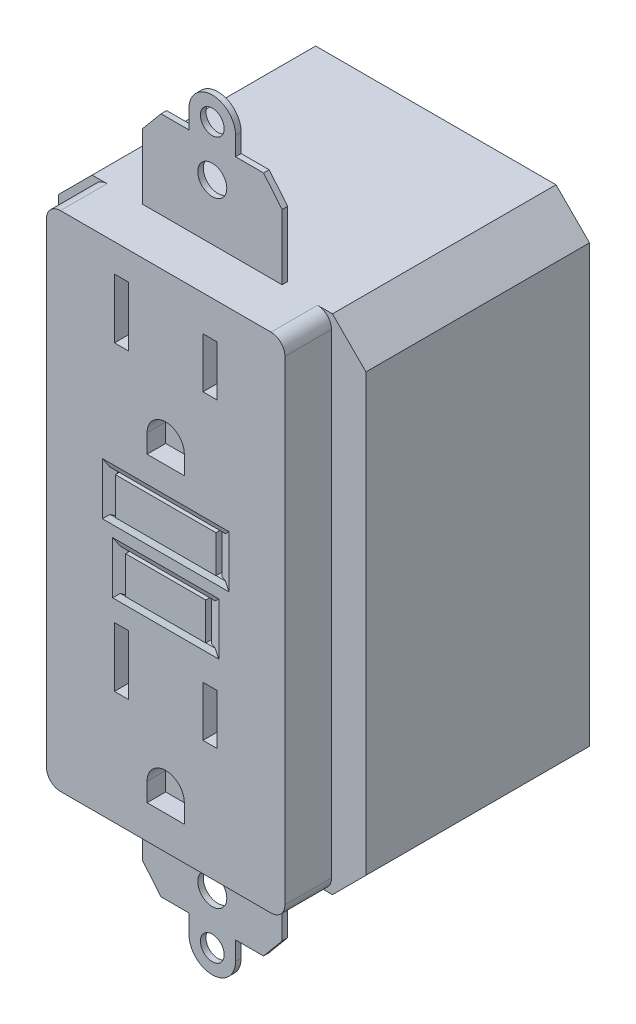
ISO-10303-21;
HEADER;
FILE_DESCRIPTION(('STEP AP214'),'2;1');
FILE_NAME('part.step','',(''),(''),'','','');
FILE_SCHEMA(('AUTOMOTIVE_DESIGN { 1 0 10303 214 1 1 1 1 }'));
ENDSEC;
DATA;
#1=APPLICATION_CONTEXT('core data for automotive mechanical design processes');
#2=APPLICATION_PROTOCOL_DEFINITION('international standard','automotive_design',2000,#1);
#3=PRODUCT_CONTEXT('',#1,'mechanical');
#4=PRODUCT('Part','Part','',(#3));
#5=PRODUCT_RELATED_PRODUCT_CATEGORY('part','',(#4));
#6=PRODUCT_DEFINITION_FORMATION('','',#4);
#7=PRODUCT_DEFINITION_CONTEXT('part definition',#1,'design');
#8=PRODUCT_DEFINITION('design','',#6,#7);
#9=PRODUCT_DEFINITION_SHAPE('','',#8);
#10=(LENGTH_UNIT() NAMED_UNIT(*) SI_UNIT(.MILLI.,.METRE.));
#11=(NAMED_UNIT(*) PLANE_ANGLE_UNIT() SI_UNIT($,.RADIAN.));
#12=(NAMED_UNIT(*) SI_UNIT($,.STERADIAN.) SOLID_ANGLE_UNIT());
#13=UNCERTAINTY_MEASURE_WITH_UNIT(LENGTH_MEASURE(1.E-05),#10,'distance_accuracy_value','');
#14=(GEOMETRIC_REPRESENTATION_CONTEXT(3) GLOBAL_UNCERTAINTY_ASSIGNED_CONTEXT((#13)) GLOBAL_UNIT_ASSIGNED_CONTEXT((#10,
#11,#12)) REPRESENTATION_CONTEXT('',''));
#15=CARTESIAN_POINT('',(0.,0.,0.));
#16=DIRECTION('',(0.,0.,1.));
#17=DIRECTION('',(1.,0.,0.));
#18=AXIS2_PLACEMENT_3D('',#15,#16,#17);
#19=CARTESIAN_POINT('',(0.,0.,-30.48));
#20=DIRECTION('',(0.,-1.,0.));
#21=DIRECTION('',(0.,0.,-1.));
#22=AXIS2_PLACEMENT_3D('',#19,#20,#21);
#23=PLANE('',#22);
#24=DIRECTION('',(1.,0.,0.));
#25=VECTOR('',#24,1.);
#26=CARTESIAN_POINT('',(0.,0.,0.));
#27=LINE('',#26,#25);
#28=CARTESIAN_POINT('',(35.306,0.,0.));
#29=VERTEX_POINT('',#28);
#30=CARTESIAN_POINT('',(37.338,0.,0.));
#31=VERTEX_POINT('',#30);
#32=EDGE_CURVE('E1632',#29,#31,#27,.T.);
#33=ORIENTED_EDGE('',*,*,#32,.F.);
#34=DIRECTION('',(0.,0.,-1.));
#35=VECTOR('',#34,1.);
#36=CARTESIAN_POINT('',(35.306,0.,6.35));
#37=LINE('',#36,#35);
#38=CARTESIAN_POINT('',(35.306,0.,6.35));
#39=VERTEX_POINT('',#38);
#40=EDGE_CURVE('E1575',#29,#39,#37,.F.);
#41=ORIENTED_EDGE('',*,*,#40,.T.);
#42=DIRECTION('',(1.,0.,0.));
#43=VECTOR('',#42,1.);
#44=CARTESIAN_POINT('',(4.699,0.,6.35));
#45=LINE('',#44,#43);
#46=CARTESIAN_POINT('',(6.604,0.,6.35));
#47=VERTEX_POINT('',#46);
#48=EDGE_CURVE('E1035',#47,#39,#45,.T.);
#49=ORIENTED_EDGE('',*,*,#48,.F.);
#50=DIRECTION('',(0.,0.,-1.));
#51=VECTOR('',#50,1.);
#52=CARTESIAN_POINT('',(6.604,0.,0.));
#53=LINE('',#52,#51);
#54=CARTESIAN_POINT('',(6.604,0.,0.));
#55=VERTEX_POINT('',#54);
#56=EDGE_CURVE('E1579',#47,#55,#53,.T.);
#57=ORIENTED_EDGE('',*,*,#56,.T.);
#58=CARTESIAN_POINT('',(4.57200000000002,0.,0.));
#59=VERTEX_POINT('',#58);
#60=EDGE_CURVE('E1631',#59,#55,#27,.T.);
#61=ORIENTED_EDGE('',*,*,#60,.F.);
#62=DIRECTION('',(0.,0.,-1.));
#63=VECTOR('',#62,1.);
#64=CARTESIAN_POINT('',(4.57200000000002,0.,-30.48));
#65=LINE('',#64,#63);
#66=CARTESIAN_POINT('',(4.57200000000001,0.,-30.48));
#67=VERTEX_POINT('',#66);
#68=EDGE_CURVE('E1613',#59,#67,#65,.T.);
#69=ORIENTED_EDGE('',*,*,#68,.T.);
#70=DIRECTION('',(1.,0.,0.));
#71=VECTOR('',#70,1.);
#72=CARTESIAN_POINT('',(0.,0.,-30.48));
#73=LINE('',#72,#71);
#74=CARTESIAN_POINT('',(37.338,0.,-30.48));
#75=VERTEX_POINT('',#74);
#76=EDGE_CURVE('E1642',#67,#75,#73,.T.);
#77=ORIENTED_EDGE('',*,*,#76,.T.);
#78=DIRECTION('',(0.,0.,1.));
#79=VECTOR('',#78,1.);
#80=CARTESIAN_POINT('',(37.338,0.,-30.48));
#81=LINE('',#80,#79);
#82=EDGE_CURVE('E1610',#75,#31,#81,.T.);
#83=ORIENTED_EDGE('',*,*,#82,.T.);
#84=EDGE_LOOP('',(#33,#41,#49,#57,#61,#69,#77,#83));
#85=FACE_BOUND('',#84,.T.);
#86=DIRECTION('',(1.,0.,0.));
#87=VECTOR('',#86,1.);
#88=CARTESIAN_POINT('',(11.43,0.,0.));
#89=LINE('',#88,#87);
#90=CARTESIAN_POINT('',(11.43,0.,0.));
#91=VERTEX_POINT('',#90);
#92=CARTESIAN_POINT('',(30.48,0.,0.));
#93=VERTEX_POINT('',#92);
#94=EDGE_CURVE('E869',#91,#93,#89,.T.);
#95=ORIENTED_EDGE('',*,*,#94,.T.);
#96=DIRECTION('',(0.,0.,1.));
#97=VECTOR('',#96,1.);
#98=CARTESIAN_POINT('',(30.48,0.,-0.762));
#99=LINE('',#98,#97);
#100=CARTESIAN_POINT('',(30.48,0.,-0.762));
#101=VERTEX_POINT('',#100);
#102=EDGE_CURVE('E915',#101,#93,#99,.T.);
#103=ORIENTED_EDGE('',*,*,#102,.F.);
#104=DIRECTION('',(1.,0.,0.));
#105=VECTOR('',#104,1.);
#106=CARTESIAN_POINT('',(11.43,0.,-0.762));
#107=LINE('',#106,#105);
#108=CARTESIAN_POINT('',(11.43,0.,-0.762));
#109=VERTEX_POINT('',#108);
#110=EDGE_CURVE('E872',#109,#101,#107,.T.);
#111=ORIENTED_EDGE('',*,*,#110,.F.);
#112=DIRECTION('',(0.,0.,1.));
#113=VECTOR('',#112,1.);
#114=CARTESIAN_POINT('',(11.43,0.,-0.762));
#115=LINE('',#114,#113);
#116=EDGE_CURVE('E894',#109,#91,#115,.T.);
#117=ORIENTED_EDGE('',*,*,#116,.T.);
#118=EDGE_LOOP('',(#95,#103,#111,#117));
#119=FACE_BOUND('',#118,.T.);
#120=ADVANCED_FACE('F33',(#85,#119),#23,.T.);
#121=CARTESIAN_POINT('',(0.,68.58,0.));
#122=DIRECTION('',(0.,0.,-1.));
#123=DIRECTION('',(-1.,0.,0.));
#124=AXIS2_PLACEMENT_3D('',#121,#122,#123);
#125=PLANE('',#124);
#126=DIRECTION('',(0.,-1.,0.));
#127=VECTOR('',#126,1.);
#128=CARTESIAN_POINT('',(4.69899999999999,68.58,0.));
#129=LINE('',#128,#127);
#130=CARTESIAN_POINT('',(4.69899999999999,66.675,0.));
#131=VERTEX_POINT('',#130);
#132=CARTESIAN_POINT('',(4.699,1.905,0.));
#133=VERTEX_POINT('',#132);
#134=EDGE_CURVE('E1013',#131,#133,#129,.T.);
#135=ORIENTED_EDGE('',*,*,#134,.F.);
#136=CARTESIAN_POINT('',(6.60399999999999,66.675,0.));
#137=DIRECTION('',(0.,0.,-1.));
#138=DIRECTION('',(-1.,0.,0.));
#139=AXIS2_PLACEMENT_3D('',#136,#137,#138);
#140=CIRCLE('',#139,1.905);
#141=CARTESIAN_POINT('',(6.60399999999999,68.58,0.));
#142=VERTEX_POINT('',#141);
#143=EDGE_CURVE('E1071',#131,#142,#140,.T.);
#144=ORIENTED_EDGE('',*,*,#143,.T.);
#145=DIRECTION('',(-1.,0.,0.));
#146=VECTOR('',#145,1.);
#147=CARTESIAN_POINT('',(0.,68.58,0.));
#148=LINE('',#147,#146);
#149=CARTESIAN_POINT('',(4.57199999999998,68.58,0.));
#150=VERTEX_POINT('',#149);
#151=EDGE_CURVE('E1556',#142,#150,#148,.T.);
#152=ORIENTED_EDGE('',*,*,#151,.T.);
#153=DIRECTION('',(0.707106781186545,0.70710678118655,0.));
#154=VECTOR('',#153,1.);
#155=CARTESIAN_POINT('',(4.57199999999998,68.58,0.));
#156=LINE('',#155,#154);
#157=CARTESIAN_POINT('',(0.,64.008,0.));
#158=VERTEX_POINT('',#157);
#159=EDGE_CURVE('E1604',#150,#158,#156,.F.);
#160=ORIENTED_EDGE('',*,*,#159,.T.);
#161=DIRECTION('',(0.,-1.,0.));
#162=VECTOR('',#161,1.);
#163=CARTESIAN_POINT('',(0.,0.,0.));
#164=LINE('',#163,#162);
#165=CARTESIAN_POINT('',(0.,4.572,0.));
#166=VERTEX_POINT('',#165);
#167=EDGE_CURVE('E1045',#158,#166,#164,.T.);
#168=ORIENTED_EDGE('',*,*,#167,.T.);
#169=DIRECTION('',(-0.707106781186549,0.707106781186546,0.));
#170=VECTOR('',#169,1.);
#171=CARTESIAN_POINT('',(0.,4.572,0.));
#172=LINE('',#171,#170);
#173=EDGE_CURVE('E1608',#166,#59,#172,.F.);
#174=ORIENTED_EDGE('',*,*,#173,.T.);
#175=ORIENTED_EDGE('',*,*,#60,.T.);
#176=CARTESIAN_POINT('',(6.604,1.905,0.));
#177=DIRECTION('',(0.,0.,-1.));
#178=DIRECTION('',(-1.,0.,0.));
#179=AXIS2_PLACEMENT_3D('',#176,#177,#178);
#180=CIRCLE('',#179,1.905);
#181=EDGE_CURVE('E1069',#55,#133,#180,.T.);
#182=ORIENTED_EDGE('',*,*,#181,.T.);
#183=EDGE_LOOP('',(#135,#144,#152,#160,#168,#174,#175,#182));
#184=FACE_BOUND('',#183,.T.);
#185=ADVANCED_FACE('F1191',(#184),#125,.F.);
#186=DIRECTION('',(0.,1.,0.));
#187=VECTOR('',#186,1.);
#188=CARTESIAN_POINT('',(37.211,68.58,0.));
#189=LINE('',#188,#187);
#190=CARTESIAN_POINT('',(37.211,1.905,0.));
#191=VERTEX_POINT('',#190);
#192=CARTESIAN_POINT('',(37.211,66.675,0.));
#193=VERTEX_POINT('',#192);
#194=EDGE_CURVE('E1036',#191,#193,#189,.T.);
#195=ORIENTED_EDGE('',*,*,#194,.F.);
#196=CARTESIAN_POINT('',(35.306,1.905,0.));
#197=DIRECTION('',(0.,0.,-1.));
#198=DIRECTION('',(-1.,0.,0.));
#199=AXIS2_PLACEMENT_3D('',#196,#197,#198);
#200=CIRCLE('',#199,1.905);
#201=EDGE_CURVE('E1066',#191,#29,#200,.T.);
#202=ORIENTED_EDGE('',*,*,#201,.T.);
#203=ORIENTED_EDGE('',*,*,#32,.T.);
#204=DIRECTION('',(-0.707106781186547,-0.707106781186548,0.));
#205=VECTOR('',#204,1.);
#206=CARTESIAN_POINT('',(37.338,0.,0.));
#207=LINE('',#206,#205);
#208=CARTESIAN_POINT('',(41.91,4.57200000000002,0.));
#209=VERTEX_POINT('',#208);
#210=EDGE_CURVE('E1606',#31,#209,#207,.F.);
#211=ORIENTED_EDGE('',*,*,#210,.T.);
#212=DIRECTION('',(0.,1.,0.));
#213=VECTOR('',#212,1.);
#214=CARTESIAN_POINT('',(41.91,0.,0.));
#215=LINE('',#214,#213);
#216=CARTESIAN_POINT('',(41.91,64.008,0.));
#217=VERTEX_POINT('',#216);
#218=EDGE_CURVE('E1564',#209,#217,#215,.T.);
#219=ORIENTED_EDGE('',*,*,#218,.T.);
#220=DIRECTION('',(0.707106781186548,-0.707106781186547,0.));
#221=VECTOR('',#220,1.);
#222=CARTESIAN_POINT('',(41.91,64.008,0.));
#223=LINE('',#222,#221);
#224=CARTESIAN_POINT('',(37.338,68.58,0.));
#225=VERTEX_POINT('',#224);
#226=EDGE_CURVE('E1602',#217,#225,#223,.F.);
#227=ORIENTED_EDGE('',*,*,#226,.T.);
#228=CARTESIAN_POINT('',(35.306,68.58,0.));
#229=VERTEX_POINT('',#228);
#230=EDGE_CURVE('E1563',#225,#229,#148,.T.);
#231=ORIENTED_EDGE('',*,*,#230,.T.);
#232=CARTESIAN_POINT('',(35.306,66.675,0.));
#233=DIRECTION('',(0.,0.,-1.));
#234=DIRECTION('',(-1.,0.,0.));
#235=AXIS2_PLACEMENT_3D('',#232,#233,#234);
#236=CIRCLE('',#235,1.905);
#237=EDGE_CURVE('E1074',#229,#193,#236,.T.);
#238=ORIENTED_EDGE('',*,*,#237,.T.);
#239=EDGE_LOOP('',(#195,#202,#203,#211,#219,#227,#231,#238));
#240=FACE_BOUND('',#239,.T.);
#241=ADVANCED_FACE('F1197',(#240),#125,.F.);
#242=CARTESIAN_POINT('',(0.,0.,-30.48));
#243=DIRECTION('',(-1.,0.,0.));
#244=DIRECTION('',(0.,0.,1.));
#245=AXIS2_PLACEMENT_3D('',#242,#243,#244);
#246=PLANE('',#245);
#247=DIRECTION('',(0.,-1.,0.));
#248=VECTOR('',#247,1.);
#249=CARTESIAN_POINT('',(0.,0.,-30.48));
#250=LINE('',#249,#248);
#251=CARTESIAN_POINT('',(0.,64.008,-30.48));
#252=VERTEX_POINT('',#251);
#253=CARTESIAN_POINT('',(0.,4.57199999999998,-30.48));
#254=VERTEX_POINT('',#253);
#255=EDGE_CURVE('E1644',#252,#254,#250,.T.);
#256=ORIENTED_EDGE('',*,*,#255,.T.);
#257=DIRECTION('',(0.,0.,1.));
#258=VECTOR('',#257,1.);
#259=CARTESIAN_POINT('',(0.,4.572,-30.48));
#260=LINE('',#259,#258);
#261=EDGE_CURVE('E1598',#254,#166,#260,.T.);
#262=ORIENTED_EDGE('',*,*,#261,.T.);
#263=ORIENTED_EDGE('',*,*,#167,.F.);
#264=DIRECTION('',(0.,0.,-1.));
#265=VECTOR('',#264,1.);
#266=CARTESIAN_POINT('',(0.,64.008,-30.48));
#267=LINE('',#266,#265);
#268=EDGE_CURVE('E1595',#158,#252,#267,.T.);
#269=ORIENTED_EDGE('',*,*,#268,.T.);
#270=EDGE_LOOP('',(#256,#262,#263,#269));
#271=FACE_BOUND('',#270,.T.);
#272=ADVANCED_FACE('F1205',(#271),#246,.T.);
#273=CARTESIAN_POINT('',(0.,68.58,-30.48));
#274=DIRECTION('',(0.,1.,0.));
#275=DIRECTION('',(0.,0.,1.));
#276=AXIS2_PLACEMENT_3D('',#273,#274,#275);
#277=PLANE('',#276);
#278=DIRECTION('',(1.,0.,0.));
#279=VECTOR('',#278,1.);
#280=CARTESIAN_POINT('',(11.43,68.58,-0.762));
#281=LINE('',#280,#279);
#282=CARTESIAN_POINT('',(11.43,68.58,-0.762));
#283=VERTEX_POINT('',#282);
#284=CARTESIAN_POINT('',(30.48,68.58,-0.762));
#285=VERTEX_POINT('',#284);
#286=EDGE_CURVE('E951',#283,#285,#281,.T.);
#287=ORIENTED_EDGE('',*,*,#286,.T.);
#288=DIRECTION('',(0.,0.,1.));
#289=VECTOR('',#288,1.);
#290=CARTESIAN_POINT('',(30.48,68.58,-0.762));
#291=LINE('',#290,#289);
#292=CARTESIAN_POINT('',(30.48,68.58,0.));
#293=VERTEX_POINT('',#292);
#294=EDGE_CURVE('E982',#285,#293,#291,.T.);
#295=ORIENTED_EDGE('',*,*,#294,.T.);
#296=DIRECTION('',(1.,0.,0.));
#297=VECTOR('',#296,1.);
#298=CARTESIAN_POINT('',(11.43,68.58,0.));
#299=LINE('',#298,#297);
#300=CARTESIAN_POINT('',(11.43,68.58,0.));
#301=VERTEX_POINT('',#300);
#302=EDGE_CURVE('E948',#301,#293,#299,.T.);
#303=ORIENTED_EDGE('',*,*,#302,.F.);
#304=DIRECTION('',(0.,0.,1.));
#305=VECTOR('',#304,1.);
#306=CARTESIAN_POINT('',(11.43,68.58,-0.762));
#307=LINE('',#306,#305);
#308=EDGE_CURVE('E1010',#283,#301,#307,.T.);
#309=ORIENTED_EDGE('',*,*,#308,.F.);
#310=EDGE_LOOP('',(#287,#295,#303,#309));
#311=FACE_BOUND('',#310,.T.);
#312=ORIENTED_EDGE('',*,*,#151,.F.);
#313=DIRECTION('',(0.,0.,-1.));
#314=VECTOR('',#313,1.);
#315=CARTESIAN_POINT('',(6.60399999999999,68.58,6.35));
#316=LINE('',#315,#314);
#317=CARTESIAN_POINT('',(6.60399999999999,68.58,6.35));
#318=VERTEX_POINT('',#317);
#319=EDGE_CURVE('E1064',#142,#318,#316,.F.);
#320=ORIENTED_EDGE('',*,*,#319,.T.);
#321=DIRECTION('',(-1.,0.,0.));
#322=VECTOR('',#321,1.);
#323=CARTESIAN_POINT('',(4.69899999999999,68.58,6.35));
#324=LINE('',#323,#322);
#325=CARTESIAN_POINT('',(35.306,68.58,6.35));
#326=VERTEX_POINT('',#325);
#327=EDGE_CURVE('E1042',#326,#318,#324,.T.);
#328=ORIENTED_EDGE('',*,*,#327,.F.);
#329=DIRECTION('',(0.,0.,-1.));
#330=VECTOR('',#329,1.);
#331=CARTESIAN_POINT('',(35.306,68.58,0.));
#332=LINE('',#331,#330);
#333=EDGE_CURVE('E1061',#326,#229,#332,.T.);
#334=ORIENTED_EDGE('',*,*,#333,.T.);
#335=ORIENTED_EDGE('',*,*,#230,.F.);
#336=DIRECTION('',(0.,0.,-1.));
#337=VECTOR('',#336,1.);
#338=CARTESIAN_POINT('',(37.338,68.58,-30.48));
#339=LINE('',#338,#337);
#340=CARTESIAN_POINT('',(37.338,68.58,-30.48));
#341=VERTEX_POINT('',#340);
#342=EDGE_CURVE('E1628',#225,#341,#339,.T.);
#343=ORIENTED_EDGE('',*,*,#342,.T.);
#344=DIRECTION('',(-1.,0.,0.));
#345=VECTOR('',#344,1.);
#346=CARTESIAN_POINT('',(0.,68.58,-30.48));
#347=LINE('',#346,#345);
#348=CARTESIAN_POINT('',(4.57199999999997,68.58,-30.48));
#349=VERTEX_POINT('',#348);
#350=EDGE_CURVE('E1599',#341,#349,#347,.T.);
#351=ORIENTED_EDGE('',*,*,#350,.T.);
#352=DIRECTION('',(0.,0.,1.));
#353=VECTOR('',#352,1.);
#354=CARTESIAN_POINT('',(4.57199999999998,68.58,-30.48));
#355=LINE('',#354,#353);
#356=EDGE_CURVE('E1561',#349,#150,#355,.T.);
#357=ORIENTED_EDGE('',*,*,#356,.T.);
#358=EDGE_LOOP('',(#312,#320,#328,#334,#335,#343,#351,#357));
#359=FACE_BOUND('',#358,.T.);
#360=ADVANCED_FACE('F1208',(#311,#359),#277,.T.);
#361=CARTESIAN_POINT('',(41.91,0.,-30.48));
#362=DIRECTION('',(1.,0.,0.));
#363=DIRECTION('',(0.,0.,-1.));
#364=AXIS2_PLACEMENT_3D('',#361,#362,#363);
#365=PLANE('',#364);
#366=ORIENTED_EDGE('',*,*,#218,.F.);
#367=DIRECTION('',(0.,0.,-1.));
#368=VECTOR('',#367,1.);
#369=CARTESIAN_POINT('',(41.91,4.57200000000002,-30.48));
#370=LINE('',#369,#368);
#371=CARTESIAN_POINT('',(41.91,4.57200000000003,-30.48));
#372=VERTEX_POINT('',#371);
#373=EDGE_CURVE('E1626',#209,#372,#370,.T.);
#374=ORIENTED_EDGE('',*,*,#373,.T.);
#375=DIRECTION('',(0.,1.,0.));
#376=VECTOR('',#375,1.);
#377=CARTESIAN_POINT('',(41.91,0.,-30.48));
#378=LINE('',#377,#376);
#379=CARTESIAN_POINT('',(41.91,64.008,-30.48));
#380=VERTEX_POINT('',#379);
#381=EDGE_CURVE('E1639',#372,#380,#378,.T.);
#382=ORIENTED_EDGE('',*,*,#381,.T.);
#383=DIRECTION('',(0.,0.,1.));
#384=VECTOR('',#383,1.);
#385=CARTESIAN_POINT('',(41.91,64.008,-30.48));
#386=LINE('',#385,#384);
#387=EDGE_CURVE('E1623',#380,#217,#386,.T.);
#388=ORIENTED_EDGE('',*,*,#387,.T.);
#389=EDGE_LOOP('',(#366,#374,#382,#388));
#390=FACE_BOUND('',#389,.T.);
#391=ADVANCED_FACE('F1203',(#390),#365,.T.);
#392=CARTESIAN_POINT('',(0.,68.58,-30.48));
#393=DIRECTION('',(0.,0.,-1.));
#394=DIRECTION('',(-1.,0.,0.));
#395=AXIS2_PLACEMENT_3D('',#392,#393,#394);
#396=PLANE('',#395);
#397=ORIENTED_EDGE('',*,*,#76,.F.);
#398=DIRECTION('',(0.707106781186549,-0.707106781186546,0.));
#399=VECTOR('',#398,1.);
#400=CARTESIAN_POINT('',(-32.004,36.5759999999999,-30.48));
#401=LINE('',#400,#399);
#402=EDGE_CURVE('E1621',#67,#254,#401,.F.);
#403=ORIENTED_EDGE('',*,*,#402,.T.);
#404=ORIENTED_EDGE('',*,*,#255,.F.);
#405=DIRECTION('',(-0.707106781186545,-0.70710678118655,0.));
#406=VECTOR('',#405,1.);
#407=CARTESIAN_POINT('',(2.286,66.294,-30.48));
#408=LINE('',#407,#406);
#409=EDGE_CURVE('E1617',#252,#349,#408,.F.);
#410=ORIENTED_EDGE('',*,*,#409,.T.);
#411=ORIENTED_EDGE('',*,*,#350,.F.);
#412=DIRECTION('',(-0.707106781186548,0.707106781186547,0.));
#413=VECTOR('',#412,1.);
#414=CARTESIAN_POINT('',(18.669,87.249,-30.48));
#415=LINE('',#414,#413);
#416=EDGE_CURVE('E1615',#341,#380,#415,.F.);
#417=ORIENTED_EDGE('',*,*,#416,.T.);
#418=ORIENTED_EDGE('',*,*,#381,.F.);
#419=DIRECTION('',(0.707106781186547,0.707106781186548,0.));
#420=VECTOR('',#419,1.);
#421=CARTESIAN_POINT('',(52.959,15.621,-30.48));
#422=LINE('',#421,#420);
#423=EDGE_CURVE('E1619',#372,#75,#422,.F.);
#424=ORIENTED_EDGE('',*,*,#423,.T.);
#425=EDGE_LOOP('',(#397,#403,#404,#410,#411,#417,#418,#424));
#426=FACE_BOUND('',#425,.T.);
#427=ADVANCED_FACE('F1214',(#426),#396,.T.);
#428=CARTESIAN_POINT('',(0.,4.572,-30.48));
#429=DIRECTION('',(0.707106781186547,0.707106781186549,0.));
#430=DIRECTION('',(-0.707106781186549,0.707106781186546,0.));
#431=AXIS2_PLACEMENT_3D('',#428,#429,#430);
#432=PLANE('',#431);
#433=ORIENTED_EDGE('',*,*,#402,.F.);
#434=ORIENTED_EDGE('',*,*,#68,.F.);
#435=ORIENTED_EDGE('',*,*,#173,.F.);
#436=ORIENTED_EDGE('',*,*,#261,.F.);
#437=EDGE_LOOP('',(#433,#434,#435,#436));
#438=FACE_BOUND('',#437,.T.);
#439=ADVANCED_FACE('F1210',(#438),#432,.F.);
#440=CARTESIAN_POINT('',(37.338,0.,-30.48));
#441=DIRECTION('',(-0.707106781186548,0.707106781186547,0.));
#442=DIRECTION('',(-0.707106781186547,-0.707106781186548,0.));
#443=AXIS2_PLACEMENT_3D('',#440,#441,#442);
#444=PLANE('',#443);
#445=ORIENTED_EDGE('',*,*,#423,.F.);
#446=ORIENTED_EDGE('',*,*,#373,.F.);
#447=ORIENTED_EDGE('',*,*,#210,.F.);
#448=ORIENTED_EDGE('',*,*,#82,.F.);
#449=EDGE_LOOP('',(#445,#446,#447,#448));
#450=FACE_BOUND('',#449,.T.);
#451=ADVANCED_FACE('F1213',(#450),#444,.F.);
#452=CARTESIAN_POINT('',(4.57199999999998,68.58,-30.48));
#453=DIRECTION('',(0.70710678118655,-0.707106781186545,0.));
#454=DIRECTION('',(0.707106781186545,0.70710678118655,0.));
#455=AXIS2_PLACEMENT_3D('',#452,#453,#454);
#456=PLANE('',#455);
#457=ORIENTED_EDGE('',*,*,#409,.F.);
#458=ORIENTED_EDGE('',*,*,#268,.F.);
#459=ORIENTED_EDGE('',*,*,#159,.F.);
#460=ORIENTED_EDGE('',*,*,#356,.F.);
#461=EDGE_LOOP('',(#457,#458,#459,#460));
#462=FACE_BOUND('',#461,.T.);
#463=ADVANCED_FACE('F1218',(#462),#456,.F.);
#464=CARTESIAN_POINT('',(41.91,64.008,-30.48));
#465=DIRECTION('',(-0.707106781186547,-0.707106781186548,0.));
#466=DIRECTION('',(0.707106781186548,-0.707106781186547,0.));
#467=AXIS2_PLACEMENT_3D('',#464,#465,#466);
#468=PLANE('',#467);
#469=ORIENTED_EDGE('',*,*,#416,.F.);
#470=ORIENTED_EDGE('',*,*,#342,.F.);
#471=ORIENTED_EDGE('',*,*,#226,.F.);
#472=ORIENTED_EDGE('',*,*,#387,.F.);
#473=EDGE_LOOP('',(#469,#470,#471,#472));
#474=FACE_BOUND('',#473,.T.);
#475=ADVANCED_FACE('F1222',(#474),#468,.F.);
#476=CARTESIAN_POINT('',(4.69899999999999,68.58,6.35));
#477=DIRECTION('',(1.,0.,0.));
#478=DIRECTION('',(0.,1.,0.));
#479=AXIS2_PLACEMENT_3D('',#476,#477,#478);
#480=PLANE('',#479);
#481=ORIENTED_EDGE('',*,*,#134,.T.);
#482=DIRECTION('',(0.,0.,-1.));
#483=VECTOR('',#482,1.);
#484=CARTESIAN_POINT('',(4.699,1.905,6.35));
#485=LINE('',#484,#483);
#486=CARTESIAN_POINT('',(4.699,1.905,6.35));
#487=VERTEX_POINT('',#486);
#488=EDGE_CURVE('E1059',#133,#487,#485,.F.);
#489=ORIENTED_EDGE('',*,*,#488,.T.);
#490=DIRECTION('',(0.,-1.,0.));
#491=VECTOR('',#490,1.);
#492=CARTESIAN_POINT('',(4.69899999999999,68.58,6.35));
#493=LINE('',#492,#491);
#494=CARTESIAN_POINT('',(4.69899999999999,66.675,6.35));
#495=VERTEX_POINT('',#494);
#496=EDGE_CURVE('E1032',#495,#487,#493,.T.);
#497=ORIENTED_EDGE('',*,*,#496,.F.);
#498=DIRECTION('',(0.,0.,-1.));
#499=VECTOR('',#498,1.);
#500=CARTESIAN_POINT('',(4.69899999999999,66.675,0.));
#501=LINE('',#500,#499);
#502=EDGE_CURVE('E1056',#495,#131,#501,.T.);
#503=ORIENTED_EDGE('',*,*,#502,.T.);
#504=EDGE_LOOP('',(#481,#489,#497,#503));
#505=FACE_BOUND('',#504,.T.);
#506=ADVANCED_FACE('F1226',(#505),#480,.F.);
#507=CARTESIAN_POINT('',(37.211,68.58,6.35));
#508=DIRECTION('',(-1.,0.,0.));
#509=DIRECTION('',(0.,0.,1.));
#510=AXIS2_PLACEMENT_3D('',#507,#508,#509);
#511=PLANE('',#510);
#512=DIRECTION('',(0.,1.,0.));
#513=VECTOR('',#512,1.);
#514=CARTESIAN_POINT('',(37.211,68.58,6.35));
#515=LINE('',#514,#513);
#516=CARTESIAN_POINT('',(37.211,1.905,6.35));
#517=VERTEX_POINT('',#516);
#518=CARTESIAN_POINT('',(37.211,66.675,6.35));
#519=VERTEX_POINT('',#518);
#520=EDGE_CURVE('E1039',#517,#519,#515,.T.);
#521=ORIENTED_EDGE('',*,*,#520,.F.);
#522=DIRECTION('',(0.,0.,-1.));
#523=VECTOR('',#522,1.);
#524=CARTESIAN_POINT('',(37.211,1.905,0.));
#525=LINE('',#524,#523);
#526=EDGE_CURVE('E1582',#517,#191,#525,.T.);
#527=ORIENTED_EDGE('',*,*,#526,.T.);
#528=ORIENTED_EDGE('',*,*,#194,.T.);
#529=DIRECTION('',(0.,0.,-1.));
#530=VECTOR('',#529,1.);
#531=CARTESIAN_POINT('',(37.211,66.675,6.35));
#532=LINE('',#531,#530);
#533=EDGE_CURVE('E1585',#193,#519,#532,.F.);
#534=ORIENTED_EDGE('',*,*,#533,.T.);
#535=EDGE_LOOP('',(#521,#527,#528,#534));
#536=FACE_BOUND('',#535,.T.);
#537=ADVANCED_FACE('F1538',(#536),#511,.F.);
#538=CARTESIAN_POINT('',(4.699,0.,6.35));
#539=DIRECTION('',(0.,0.,1.));
#540=DIRECTION('',(1.,0.,0.));
#541=AXIS2_PLACEMENT_3D('',#538,#539,#540);
#542=PLANE('',#541);
#543=DIRECTION('',(-1.,0.,0.));
#544=VECTOR('',#543,1.);
#545=CARTESIAN_POINT('',(15.24,26.416,6.35));
#546=LINE('',#545,#544);
#547=CARTESIAN_POINT('',(28.194,26.416,6.35));
#548=VERTEX_POINT('',#547);
#549=CARTESIAN_POINT('',(13.716,26.416,6.35));
#550=VERTEX_POINT('',#549);
#551=EDGE_CURVE('E1084',#548,#550,#546,.T.);
#552=ORIENTED_EDGE('',*,*,#551,.T.);
#553=DIRECTION('',(0.,1.,0.));
#554=VECTOR('',#553,1.);
#555=CARTESIAN_POINT('',(13.716,33.528,6.35));
#556=LINE('',#555,#554);
#557=CARTESIAN_POINT('',(13.716,33.528,6.35));
#558=VERTEX_POINT('',#557);
#559=EDGE_CURVE('E1102',#550,#558,#556,.T.);
#560=ORIENTED_EDGE('',*,*,#559,.T.);
#561=DIRECTION('',(1.,0.,0.));
#562=VECTOR('',#561,1.);
#563=CARTESIAN_POINT('',(26.67,33.528,6.35));
#564=LINE('',#563,#562);
#565=CARTESIAN_POINT('',(28.194,33.528,6.35));
#566=VERTEX_POINT('',#565);
#567=EDGE_CURVE('E1082',#558,#566,#564,.T.);
#568=ORIENTED_EDGE('',*,*,#567,.T.);
#569=DIRECTION('',(0.,-1.,0.));
#570=VECTOR('',#569,1.);
#571=CARTESIAN_POINT('',(28.194,26.416,6.35));
#572=LINE('',#571,#570);
#573=EDGE_CURVE('E1099',#566,#548,#572,.T.);
#574=ORIENTED_EDGE('',*,*,#573,.T.);
#575=EDGE_LOOP('',(#552,#560,#568,#574));
#576=FACE_BOUND('',#575,.T.);
#577=DIRECTION('',(1.,0.,0.));
#578=VECTOR('',#577,1.);
#579=CARTESIAN_POINT('',(28.067,42.164,6.35));
#580=LINE('',#579,#578);
#581=CARTESIAN_POINT('',(12.319,42.164,6.35));
#582=VERTEX_POINT('',#581);
#583=CARTESIAN_POINT('',(29.591,42.164,6.35));
#584=VERTEX_POINT('',#583);
#585=EDGE_CURVE('E1078',#582,#584,#580,.T.);
#586=ORIENTED_EDGE('',*,*,#585,.T.);
#587=DIRECTION('',(0.,-1.,0.));
#588=VECTOR('',#587,1.);
#589=CARTESIAN_POINT('',(29.591,35.052,6.35));
#590=LINE('',#589,#588);
#591=CARTESIAN_POINT('',(29.591,35.052,6.35));
#592=VERTEX_POINT('',#591);
#593=EDGE_CURVE('E1096',#584,#592,#590,.T.);
#594=ORIENTED_EDGE('',*,*,#593,.T.);
#595=DIRECTION('',(-1.,0.,0.));
#596=VECTOR('',#595,1.);
#597=CARTESIAN_POINT('',(13.843,35.052,6.35));
#598=LINE('',#597,#596);
#599=CARTESIAN_POINT('',(12.319,35.052,6.35));
#600=VERTEX_POINT('',#599);
#601=EDGE_CURVE('E1080',#592,#600,#598,.T.);
#602=ORIENTED_EDGE('',*,*,#601,.T.);
#603=DIRECTION('',(0.,1.,0.));
#604=VECTOR('',#603,1.);
#605=CARTESIAN_POINT('',(12.319,42.164,6.35));
#606=LINE('',#605,#604);
#607=EDGE_CURVE('E1093',#600,#582,#606,.T.);
#608=ORIENTED_EDGE('',*,*,#607,.T.);
#609=EDGE_LOOP('',(#586,#594,#602,#608));
#610=FACE_BOUND('',#609,.T.);
#611=DIRECTION('',(0.,-1.,0.));
#612=VECTOR('',#611,1.);
#613=CARTESIAN_POINT('',(26.035,22.606,6.35));
#614=LINE('',#613,#612);
#615=CARTESIAN_POINT('',(26.035,22.606,6.35));
#616=VERTEX_POINT('',#615);
#617=CARTESIAN_POINT('',(26.035,15.748,6.35));
#618=VERTEX_POINT('',#617);
#619=EDGE_CURVE('E709',#616,#618,#614,.T.);
#620=ORIENTED_EDGE('',*,*,#619,.F.);
#621=DIRECTION('',(-1.,0.,0.));
#622=VECTOR('',#621,1.);
#623=CARTESIAN_POINT('',(26.035,22.606,6.35));
#624=LINE('',#623,#622);
#625=CARTESIAN_POINT('',(27.94,22.606,6.35));
#626=VERTEX_POINT('',#625);
#627=EDGE_CURVE('E704',#626,#616,#624,.T.);
#628=ORIENTED_EDGE('',*,*,#627,.F.);
#629=DIRECTION('',(0.,1.,0.));
#630=VECTOR('',#629,1.);
#631=CARTESIAN_POINT('',(27.94,22.606,6.35));
#632=LINE('',#631,#630);
#633=CARTESIAN_POINT('',(27.94,15.748,6.35));
#634=VERTEX_POINT('',#633);
#635=EDGE_CURVE('E699',#634,#626,#632,.T.);
#636=ORIENTED_EDGE('',*,*,#635,.F.);
#637=DIRECTION('',(1.,0.,0.));
#638=VECTOR('',#637,1.);
#639=CARTESIAN_POINT('',(26.035,15.748,6.35));
#640=LINE('',#639,#638);
#641=EDGE_CURVE('E674',#618,#634,#640,.T.);
#642=ORIENTED_EDGE('',*,*,#641,.F.);
#643=EDGE_LOOP('',(#620,#628,#636,#642));
#644=FACE_BOUND('',#643,.T.);
#645=DIRECTION('',(0.,-1.,0.));
#646=VECTOR('',#645,1.);
#647=CARTESIAN_POINT('',(18.415,4.572,6.35));
#648=LINE('',#647,#646);
#649=CARTESIAN_POINT('',(18.415,7.112,6.35));
#650=VERTEX_POINT('',#649);
#651=CARTESIAN_POINT('',(18.415,4.572,6.35));
#652=VERTEX_POINT('',#651);
#653=EDGE_CURVE('E738',#650,#652,#648,.T.);
#654=ORIENTED_EDGE('',*,*,#653,.F.);
#655=CARTESIAN_POINT('',(20.955,7.112,6.35));
#656=DIRECTION('',(0.,0.,1.));
#657=DIRECTION('',(1.,0.,0.));
#658=AXIS2_PLACEMENT_3D('',#655,#656,#657);
#659=CIRCLE('',#658,2.54);
#660=CARTESIAN_POINT('',(23.495,7.112,6.35));
#661=VERTEX_POINT('',#660);
#662=EDGE_CURVE('E733',#661,#650,#659,.T.);
#663=ORIENTED_EDGE('',*,*,#662,.F.);
#664=DIRECTION('',(0.,1.,0.));
#665=VECTOR('',#664,1.);
#666=CARTESIAN_POINT('',(23.495,4.572,6.35));
#667=LINE('',#666,#665);
#668=CARTESIAN_POINT('',(23.495,4.572,6.35));
#669=VERTEX_POINT('',#668);
#670=EDGE_CURVE('E728',#669,#661,#667,.T.);
#671=ORIENTED_EDGE('',*,*,#670,.F.);
#672=DIRECTION('',(1.,0.,0.));
#673=VECTOR('',#672,1.);
#674=CARTESIAN_POINT('',(18.415,4.572,6.35));
#675=LINE('',#674,#673);
#676=EDGE_CURVE('E711',#652,#669,#675,.T.);
#677=ORIENTED_EDGE('',*,*,#676,.F.);
#678=EDGE_LOOP('',(#654,#663,#671,#677));
#679=FACE_BOUND('',#678,.T.);
#680=DIRECTION('',(0.,-1.,0.));
#681=VECTOR('',#680,1.);
#682=CARTESIAN_POINT('',(13.97,23.622,6.35));
#683=LINE('',#682,#681);
#684=CARTESIAN_POINT('',(13.97,23.622,6.35));
#685=VERTEX_POINT('',#684);
#686=CARTESIAN_POINT('',(13.97,15.494,6.35));
#687=VERTEX_POINT('',#686);
#688=EDGE_CURVE('E767',#685,#687,#683,.T.);
#689=ORIENTED_EDGE('',*,*,#688,.F.);
#690=DIRECTION('',(-1.,0.,0.));
#691=VECTOR('',#690,1.);
#692=CARTESIAN_POINT('',(13.97,23.622,6.35));
#693=LINE('',#692,#691);
#694=CARTESIAN_POINT('',(15.875,23.622,6.35));
#695=VERTEX_POINT('',#694);
#696=EDGE_CURVE('E762',#695,#685,#693,.T.);
#697=ORIENTED_EDGE('',*,*,#696,.F.);
#698=DIRECTION('',(0.,1.,0.));
#699=VECTOR('',#698,1.);
#700=CARTESIAN_POINT('',(15.875,23.622,6.35));
#701=LINE('',#700,#699);
#702=CARTESIAN_POINT('',(15.875,15.494,6.35));
#703=VERTEX_POINT('',#702);
#704=EDGE_CURVE('E757',#703,#695,#701,.T.);
#705=ORIENTED_EDGE('',*,*,#704,.F.);
#706=DIRECTION('',(1.,0.,0.));
#707=VECTOR('',#706,1.);
#708=CARTESIAN_POINT('',(13.97,15.494,6.35));
#709=LINE('',#708,#707);
#710=EDGE_CURVE('E740',#687,#703,#709,.T.);
#711=ORIENTED_EDGE('',*,*,#710,.F.);
#712=EDGE_LOOP('',(#689,#697,#705,#711));
#713=FACE_BOUND('',#712,.T.);
#714=DIRECTION('',(0.,-1.,0.));
#715=VECTOR('',#714,1.);
#716=CARTESIAN_POINT('',(13.97,64.77,6.35));
#717=LINE('',#716,#715);
#718=CARTESIAN_POINT('',(13.97,64.77,6.35));
#719=VERTEX_POINT('',#718);
#720=CARTESIAN_POINT('',(13.97,56.642,6.35));
#721=VERTEX_POINT('',#720);
#722=EDGE_CURVE('E769',#719,#721,#717,.T.);
#723=ORIENTED_EDGE('',*,*,#722,.F.);
#724=DIRECTION('',(-1.,0.,0.));
#725=VECTOR('',#724,1.);
#726=CARTESIAN_POINT('',(13.97,64.77,6.35));
#727=LINE('',#726,#725);
#728=CARTESIAN_POINT('',(15.875,64.77,6.35));
#729=VERTEX_POINT('',#728);
#730=EDGE_CURVE('E774',#729,#719,#727,.T.);
#731=ORIENTED_EDGE('',*,*,#730,.F.);
#732=DIRECTION('',(0.,1.,0.));
#733=VECTOR('',#732,1.);
#734=CARTESIAN_POINT('',(15.875,64.77,6.35));
#735=LINE('',#734,#733);
#736=CARTESIAN_POINT('',(15.875,56.642,6.35));
#737=VERTEX_POINT('',#736);
#738=EDGE_CURVE('E788',#737,#729,#735,.T.);
#739=ORIENTED_EDGE('',*,*,#738,.F.);
#740=DIRECTION('',(1.,0.,0.));
#741=VECTOR('',#740,1.);
#742=CARTESIAN_POINT('',(13.97,56.642,6.35));
#743=LINE('',#742,#741);
#744=EDGE_CURVE('E785',#721,#737,#743,.T.);
#745=ORIENTED_EDGE('',*,*,#744,.F.);
#746=EDGE_LOOP('',(#723,#731,#739,#745));
#747=FACE_BOUND('',#746,.T.);
#748=DIRECTION('',(0.,-1.,0.));
#749=VECTOR('',#748,1.);
#750=CARTESIAN_POINT('',(26.035,63.754,6.35));
#751=LINE('',#750,#749);
#752=CARTESIAN_POINT('',(26.035,63.754,6.35));
#753=VERTEX_POINT('',#752);
#754=CARTESIAN_POINT('',(26.035,56.896,6.35));
#755=VERTEX_POINT('',#754);
#756=EDGE_CURVE('E795',#753,#755,#751,.T.);
#757=ORIENTED_EDGE('',*,*,#756,.F.);
#758=DIRECTION('',(-1.,0.,0.));
#759=VECTOR('',#758,1.);
#760=CARTESIAN_POINT('',(26.035,63.754,6.35));
#761=LINE('',#760,#759);
#762=CARTESIAN_POINT('',(27.94,63.754,6.35));
#763=VERTEX_POINT('',#762);
#764=EDGE_CURVE('E806',#763,#753,#761,.T.);
#765=ORIENTED_EDGE('',*,*,#764,.F.);
#766=DIRECTION('',(0.,1.,0.));
#767=VECTOR('',#766,1.);
#768=CARTESIAN_POINT('',(27.94,63.754,6.35));
#769=LINE('',#768,#767);
#770=CARTESIAN_POINT('',(27.94,56.896,6.35));
#771=VERTEX_POINT('',#770);
#772=EDGE_CURVE('E820',#771,#763,#769,.T.);
#773=ORIENTED_EDGE('',*,*,#772,.F.);
#774=DIRECTION('',(1.,0.,0.));
#775=VECTOR('',#774,1.);
#776=CARTESIAN_POINT('',(26.035,56.896,6.35));
#777=LINE('',#776,#775);
#778=EDGE_CURVE('E817',#755,#771,#777,.T.);
#779=ORIENTED_EDGE('',*,*,#778,.F.);
#780=EDGE_LOOP('',(#757,#765,#773,#779));
#781=FACE_BOUND('',#780,.T.);
#782=DIRECTION('',(0.,-1.,0.));
#783=VECTOR('',#782,1.);
#784=CARTESIAN_POINT('',(18.415,45.72,6.35));
#785=LINE('',#784,#783);
#786=CARTESIAN_POINT('',(18.415,48.26,6.35));
#787=VERTEX_POINT('',#786);
#788=CARTESIAN_POINT('',(18.415,45.72,6.35));
#789=VERTEX_POINT('',#788);
#790=EDGE_CURVE('E827',#787,#789,#785,.T.);
#791=ORIENTED_EDGE('',*,*,#790,.F.);
#792=CARTESIAN_POINT('',(20.955,48.26,6.35));
#793=DIRECTION('',(0.,0.,1.));
#794=DIRECTION('',(1.,0.,0.));
#795=AXIS2_PLACEMENT_3D('',#792,#793,#794);
#796=CIRCLE('',#795,2.54);
#797=CARTESIAN_POINT('',(23.495,48.26,6.35));
#798=VERTEX_POINT('',#797);
#799=EDGE_CURVE('E838',#798,#787,#796,.T.);
#800=ORIENTED_EDGE('',*,*,#799,.F.);
#801=DIRECTION('',(0.,1.,0.));
#802=VECTOR('',#801,1.);
#803=CARTESIAN_POINT('',(23.495,45.72,6.35));
#804=LINE('',#803,#802);
#805=CARTESIAN_POINT('',(23.495,45.72,6.35));
#806=VERTEX_POINT('',#805);
#807=EDGE_CURVE('E852',#806,#798,#804,.T.);
#808=ORIENTED_EDGE('',*,*,#807,.F.);
#809=DIRECTION('',(1.,0.,0.));
#810=VECTOR('',#809,1.);
#811=CARTESIAN_POINT('',(18.415,45.72,6.35));
#812=LINE('',#811,#810);
#813=EDGE_CURVE('E849',#789,#806,#812,.T.);
#814=ORIENTED_EDGE('',*,*,#813,.F.);
#815=EDGE_LOOP('',(#791,#800,#808,#814));
#816=FACE_BOUND('',#815,.T.);
#817=ORIENTED_EDGE('',*,*,#48,.T.);
#818=CARTESIAN_POINT('',(35.306,1.905,6.35));
#819=DIRECTION('',(0.,0.,1.));
#820=DIRECTION('',(1.,0.,0.));
#821=AXIS2_PLACEMENT_3D('',#818,#819,#820);
#822=CIRCLE('',#821,1.905);
#823=EDGE_CURVE('E1054',#39,#517,#822,.T.);
#824=ORIENTED_EDGE('',*,*,#823,.T.);
#825=ORIENTED_EDGE('',*,*,#520,.T.);
#826=CARTESIAN_POINT('',(35.306,66.675,6.35));
#827=DIRECTION('',(0.,0.,1.));
#828=DIRECTION('',(1.,0.,0.));
#829=AXIS2_PLACEMENT_3D('',#826,#827,#828);
#830=CIRCLE('',#829,1.905);
#831=EDGE_CURVE('E1573',#519,#326,#830,.T.);
#832=ORIENTED_EDGE('',*,*,#831,.T.);
#833=ORIENTED_EDGE('',*,*,#327,.T.);
#834=CARTESIAN_POINT('',(6.60399999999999,66.675,6.35));
#835=DIRECTION('',(0.,0.,1.));
#836=DIRECTION('',(1.,0.,0.));
#837=AXIS2_PLACEMENT_3D('',#834,#835,#836);
#838=CIRCLE('',#837,1.905);
#839=EDGE_CURVE('E1569',#318,#495,#838,.T.);
#840=ORIENTED_EDGE('',*,*,#839,.T.);
#841=ORIENTED_EDGE('',*,*,#496,.T.);
#842=CARTESIAN_POINT('',(6.604,1.905,6.35));
#843=DIRECTION('',(0.,0.,1.));
#844=DIRECTION('',(1.,0.,0.));
#845=AXIS2_PLACEMENT_3D('',#842,#843,#844);
#846=CIRCLE('',#845,1.905);
#847=EDGE_CURVE('E1572',#487,#47,#846,.T.);
#848=ORIENTED_EDGE('',*,*,#847,.T.);
#849=EDGE_LOOP('',(#817,#824,#825,#832,#833,#840,#841,#848));
#850=FACE_BOUND('',#849,.T.);
#851=ADVANCED_FACE('F1174',(#576,#610,#644,#679,#713,#747,#781,#816,#850),#542,.T.);
#852=CARTESIAN_POINT('',(35.306,1.905,6.35));
#853=DIRECTION('',(0.,0.,1.));
#854=DIRECTION('',(1.,0.,0.));
#855=AXIS2_PLACEMENT_3D('',#852,#853,#854);
#856=CYLINDRICAL_SURFACE('',#855,1.905);
#857=ORIENTED_EDGE('',*,*,#823,.F.);
#858=ORIENTED_EDGE('',*,*,#40,.F.);
#859=ORIENTED_EDGE('',*,*,#201,.F.);
#860=ORIENTED_EDGE('',*,*,#526,.F.);
#861=EDGE_LOOP('',(#857,#858,#859,#860));
#862=FACE_BOUND('',#861,.T.);
#863=ADVANCED_FACE('F1228',(#862),#856,.T.);
#864=CARTESIAN_POINT('',(6.604,1.905,-30.48));
#865=DIRECTION('',(0.,0.,1.));
#866=DIRECTION('',(1.,0.,0.));
#867=AXIS2_PLACEMENT_3D('',#864,#865,#866);
#868=CYLINDRICAL_SURFACE('',#867,1.905);
#869=ORIENTED_EDGE('',*,*,#847,.F.);
#870=ORIENTED_EDGE('',*,*,#488,.F.);
#871=ORIENTED_EDGE('',*,*,#181,.F.);
#872=ORIENTED_EDGE('',*,*,#56,.F.);
#873=EDGE_LOOP('',(#869,#870,#871,#872));
#874=FACE_BOUND('',#873,.T.);
#875=ADVANCED_FACE('F1231',(#874),#868,.T.);
#876=CARTESIAN_POINT('',(6.60399999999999,66.675,6.35));
#877=DIRECTION('',(0.,0.,1.));
#878=DIRECTION('',(1.,0.,0.));
#879=AXIS2_PLACEMENT_3D('',#876,#877,#878);
#880=CYLINDRICAL_SURFACE('',#879,1.905);
#881=ORIENTED_EDGE('',*,*,#839,.F.);
#882=ORIENTED_EDGE('',*,*,#319,.F.);
#883=ORIENTED_EDGE('',*,*,#143,.F.);
#884=ORIENTED_EDGE('',*,*,#502,.F.);
#885=EDGE_LOOP('',(#881,#882,#883,#884));
#886=FACE_BOUND('',#885,.T.);
#887=ADVANCED_FACE('F1235',(#886),#880,.T.);
#888=CARTESIAN_POINT('',(35.306,66.675,-30.48));
#889=DIRECTION('',(0.,0.,1.));
#890=DIRECTION('',(1.,0.,0.));
#891=AXIS2_PLACEMENT_3D('',#888,#889,#890);
#892=CYLINDRICAL_SURFACE('',#891,1.905);
#893=ORIENTED_EDGE('',*,*,#831,.F.);
#894=ORIENTED_EDGE('',*,*,#533,.F.);
#895=ORIENTED_EDGE('',*,*,#237,.F.);
#896=ORIENTED_EDGE('',*,*,#333,.F.);
#897=EDGE_LOOP('',(#893,#894,#895,#896));
#898=FACE_BOUND('',#897,.T.);
#899=ADVANCED_FACE('F1239',(#898),#892,.T.);
#900=CARTESIAN_POINT('',(11.43,68.58,-0.762));
#901=DIRECTION('',(-1.,0.,0.));
#902=DIRECTION('',(0.,-1.,0.));
#903=AXIS2_PLACEMENT_3D('',#900,#901,#902);
#904=PLANE('',#903);
#905=DIRECTION('',(0.,-1.,0.));
#906=VECTOR('',#905,1.);
#907=CARTESIAN_POINT('',(11.43,68.58,0.));
#908=LINE('',#907,#906);
#909=CARTESIAN_POINT('',(11.43,77.47,0.));
#910=VERTEX_POINT('',#909);
#911=EDGE_CURVE('E955',#910,#301,#908,.T.);
#912=ORIENTED_EDGE('',*,*,#911,.F.);
#913=DIRECTION('',(0.,0.,1.));
#914=VECTOR('',#913,1.);
#915=CARTESIAN_POINT('',(11.43,77.47,-0.762));
#916=LINE('',#915,#914);
#917=CARTESIAN_POINT('',(11.43,77.47,-0.762));
#918=VERTEX_POINT('',#917);
#919=EDGE_CURVE('E1014',#918,#910,#916,.T.);
#920=ORIENTED_EDGE('',*,*,#919,.F.);
#921=DIRECTION('',(0.,-1.,0.));
#922=VECTOR('',#921,1.);
#923=CARTESIAN_POINT('',(11.43,68.58,-0.762));
#924=LINE('',#923,#922);
#925=EDGE_CURVE('E979',#918,#283,#924,.T.);
#926=ORIENTED_EDGE('',*,*,#925,.T.);
#927=ORIENTED_EDGE('',*,*,#308,.T.);
#928=EDGE_LOOP('',(#912,#920,#926,#927));
#929=FACE_BOUND('',#928,.T.);
#930=ADVANCED_FACE('F1243',(#929),#904,.T.);
#931=CARTESIAN_POINT('',(13.97,80.518,-0.762));
#932=DIRECTION('',(-0.768221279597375,0.640184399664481,0.));
#933=DIRECTION('',(-0.640184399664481,-0.768221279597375,0.));
#934=AXIS2_PLACEMENT_3D('',#931,#932,#933);
#935=PLANE('',#934);
#936=DIRECTION('',(-0.640184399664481,-0.768221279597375,0.));
#937=VECTOR('',#936,1.);
#938=CARTESIAN_POINT('',(13.97,80.518,0.));
#939=LINE('',#938,#937);
#940=CARTESIAN_POINT('',(13.97,80.518,0.));
#941=VERTEX_POINT('',#940);
#942=EDGE_CURVE('E1006',#941,#910,#939,.T.);
#943=ORIENTED_EDGE('',*,*,#942,.F.);
#944=DIRECTION('',(0.,0.,1.));
#945=VECTOR('',#944,1.);
#946=CARTESIAN_POINT('',(13.97,80.518,-0.762));
#947=LINE('',#946,#945);
#948=CARTESIAN_POINT('',(13.97,80.518,-0.762));
#949=VERTEX_POINT('',#948);
#950=EDGE_CURVE('E1016',#949,#941,#947,.T.);
#951=ORIENTED_EDGE('',*,*,#950,.F.);
#952=DIRECTION('',(-0.640184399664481,-0.768221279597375,0.));
#953=VECTOR('',#952,1.);
#954=CARTESIAN_POINT('',(13.97,80.518,-0.762));
#955=LINE('',#954,#953);
#956=EDGE_CURVE('E976',#949,#918,#955,.T.);
#957=ORIENTED_EDGE('',*,*,#956,.T.);
#958=ORIENTED_EDGE('',*,*,#919,.T.);
#959=EDGE_LOOP('',(#943,#951,#957,#958));
#960=FACE_BOUND('',#959,.T.);
#961=ADVANCED_FACE('F1505',(#960),#935,.T.);
#962=CARTESIAN_POINT('',(13.97,80.518,-0.762));
#963=DIRECTION('',(0.,1.,0.));
#964=DIRECTION('',(0.,0.,1.));
#965=AXIS2_PLACEMENT_3D('',#962,#963,#964);
#966=PLANE('',#965);
#967=DIRECTION('',(-1.,0.,0.));
#968=VECTOR('',#967,1.);
#969=CARTESIAN_POINT('',(13.97,80.518,0.));
#970=LINE('',#969,#968);
#971=CARTESIAN_POINT('',(17.78,80.518,0.));
#972=VERTEX_POINT('',#971);
#973=EDGE_CURVE('E1003',#972,#941,#970,.T.);
#974=ORIENTED_EDGE('',*,*,#973,.F.);
#975=DIRECTION('',(0.,0.,1.));
#976=VECTOR('',#975,1.);
#977=CARTESIAN_POINT('',(17.78,80.518,-0.762));
#978=LINE('',#977,#976);
#979=CARTESIAN_POINT('',(17.78,80.518,-0.762));
#980=VERTEX_POINT('',#979);
#981=EDGE_CURVE('E1018',#980,#972,#978,.T.);
#982=ORIENTED_EDGE('',*,*,#981,.F.);
#983=DIRECTION('',(-1.,0.,0.));
#984=VECTOR('',#983,1.);
#985=CARTESIAN_POINT('',(13.97,80.518,-0.762));
#986=LINE('',#985,#984);
#987=EDGE_CURVE('E973',#980,#949,#986,.T.);
#988=ORIENTED_EDGE('',*,*,#987,.T.);
#989=ORIENTED_EDGE('',*,*,#950,.T.);
#990=EDGE_LOOP('',(#974,#982,#988,#989));
#991=FACE_BOUND('',#990,.T.);
#992=ADVANCED_FACE('F1509',(#991),#966,.T.);
#993=CARTESIAN_POINT('',(17.78,80.518,-0.762));
#994=DIRECTION('',(-1.,0.,0.));
#995=DIRECTION('',(0.,0.,1.));
#996=AXIS2_PLACEMENT_3D('',#993,#994,#995);
#997=PLANE('',#996);
#998=DIRECTION('',(0.,-1.,0.));
#999=VECTOR('',#998,1.);
#1000=CARTESIAN_POINT('',(17.78,80.518,0.));
#1001=LINE('',#1000,#999);
#1002=CARTESIAN_POINT('',(17.78,83.058,0.));
#1003=VERTEX_POINT('',#1002);
#1004=EDGE_CURVE('E1000',#1003,#972,#1001,.T.);
#1005=ORIENTED_EDGE('',*,*,#1004,.F.);
#1006=DIRECTION('',(0.,0.,1.));
#1007=VECTOR('',#1006,1.);
#1008=CARTESIAN_POINT('',(17.78,83.058,-0.762));
#1009=LINE('',#1008,#1007);
#1010=CARTESIAN_POINT('',(17.78,83.058,-0.762));
#1011=VERTEX_POINT('',#1010);
#1012=EDGE_CURVE('E1020',#1011,#1003,#1009,.T.);
#1013=ORIENTED_EDGE('',*,*,#1012,.F.);
#1014=DIRECTION('',(0.,-1.,0.));
#1015=VECTOR('',#1014,1.);
#1016=CARTESIAN_POINT('',(17.78,80.518,-0.762));
#1017=LINE('',#1016,#1015);
#1018=EDGE_CURVE('E970',#1011,#980,#1017,.T.);
#1019=ORIENTED_EDGE('',*,*,#1018,.T.);
#1020=ORIENTED_EDGE('',*,*,#981,.T.);
#1021=EDGE_LOOP('',(#1005,#1013,#1019,#1020));
#1022=FACE_BOUND('',#1021,.T.);
#1023=ADVANCED_FACE('F1513',(#1022),#997,.T.);
#1024=CARTESIAN_POINT('',(20.955,83.058,-0.762));
#1025=DIRECTION('',(0.,0.,1.));
#1026=DIRECTION('',(1.,0.,0.));
#1027=AXIS2_PLACEMENT_3D('',#1024,#1025,#1026);
#1028=CYLINDRICAL_SURFACE('',#1027,3.175);
#1029=CARTESIAN_POINT('',(20.955,83.058,0.));
#1030=DIRECTION('',(0.,0.,1.));
#1031=DIRECTION('',(-1.,0.,0.));
#1032=AXIS2_PLACEMENT_3D('',#1029,#1030,#1031);
#1033=CIRCLE('',#1032,3.175);
#1034=CARTESIAN_POINT('',(24.13,83.058,0.));
#1035=VERTEX_POINT('',#1034);
#1036=EDGE_CURVE('E997',#1035,#1003,#1033,.T.);
#1037=ORIENTED_EDGE('',*,*,#1036,.F.);
#1038=DIRECTION('',(0.,0.,1.));
#1039=VECTOR('',#1038,1.);
#1040=CARTESIAN_POINT('',(24.13,83.058,-0.762));
#1041=LINE('',#1040,#1039);
#1042=CARTESIAN_POINT('',(24.13,83.058,-0.762));
#1043=VERTEX_POINT('',#1042);
#1044=EDGE_CURVE('E1022',#1043,#1035,#1041,.T.);
#1045=ORIENTED_EDGE('',*,*,#1044,.F.);
#1046=CARTESIAN_POINT('',(20.955,83.058,-0.762));
#1047=DIRECTION('',(0.,0.,1.));
#1048=DIRECTION('',(-1.,0.,0.));
#1049=AXIS2_PLACEMENT_3D('',#1046,#1047,#1048);
#1050=CIRCLE('',#1049,3.175);
#1051=EDGE_CURVE('E967',#1043,#1011,#1050,.T.);
#1052=ORIENTED_EDGE('',*,*,#1051,.T.);
#1053=ORIENTED_EDGE('',*,*,#1012,.T.);
#1054=EDGE_LOOP('',(#1037,#1045,#1052,#1053));
#1055=FACE_BOUND('',#1054,.T.);
#1056=ADVANCED_FACE('F1517',(#1055),#1028,.T.);
#1057=CARTESIAN_POINT('',(24.13,80.518,-0.762));
#1058=DIRECTION('',(1.,0.,0.));
#1059=DIRECTION('',(0.,0.,-1.));
#1060=AXIS2_PLACEMENT_3D('',#1057,#1058,#1059);
#1061=PLANE('',#1060);
#1062=DIRECTION('',(0.,1.,0.));
#1063=VECTOR('',#1062,1.);
#1064=CARTESIAN_POINT('',(24.13,80.518,0.));
#1065=LINE('',#1064,#1063);
#1066=CARTESIAN_POINT('',(24.13,80.518,0.));
#1067=VERTEX_POINT('',#1066);
#1068=EDGE_CURVE('E994',#1067,#1035,#1065,.T.);
#1069=ORIENTED_EDGE('',*,*,#1068,.F.);
#1070=DIRECTION('',(0.,0.,1.));
#1071=VECTOR('',#1070,1.);
#1072=CARTESIAN_POINT('',(24.13,80.518,-0.762));
#1073=LINE('',#1072,#1071);
#1074=CARTESIAN_POINT('',(24.13,80.518,-0.762));
#1075=VERTEX_POINT('',#1074);
#1076=EDGE_CURVE('E1024',#1075,#1067,#1073,.T.);
#1077=ORIENTED_EDGE('',*,*,#1076,.F.);
#1078=DIRECTION('',(0.,1.,0.));
#1079=VECTOR('',#1078,1.);
#1080=CARTESIAN_POINT('',(24.13,80.518,-0.762));
#1081=LINE('',#1080,#1079);
#1082=EDGE_CURVE('E964',#1075,#1043,#1081,.T.);
#1083=ORIENTED_EDGE('',*,*,#1082,.T.);
#1084=ORIENTED_EDGE('',*,*,#1044,.T.);
#1085=EDGE_LOOP('',(#1069,#1077,#1083,#1084));
#1086=FACE_BOUND('',#1085,.T.);
#1087=ADVANCED_FACE('F1521',(#1086),#1061,.T.);
#1088=CARTESIAN_POINT('',(27.94,80.518,-0.762));
#1089=DIRECTION('',(0.,1.,0.));
#1090=DIRECTION('',(0.,0.,1.));
#1091=AXIS2_PLACEMENT_3D('',#1088,#1089,#1090);
#1092=PLANE('',#1091);
#1093=DIRECTION('',(-1.,0.,0.));
#1094=VECTOR('',#1093,1.);
#1095=CARTESIAN_POINT('',(27.94,80.518,0.));
#1096=LINE('',#1095,#1094);
#1097=CARTESIAN_POINT('',(27.94,80.518,0.));
#1098=VERTEX_POINT('',#1097);
#1099=EDGE_CURVE('E991',#1098,#1067,#1096,.T.);
#1100=ORIENTED_EDGE('',*,*,#1099,.F.);
#1101=DIRECTION('',(0.,0.,1.));
#1102=VECTOR('',#1101,1.);
#1103=CARTESIAN_POINT('',(27.94,80.518,-0.762));
#1104=LINE('',#1103,#1102);
#1105=CARTESIAN_POINT('',(27.94,80.518,-0.762));
#1106=VERTEX_POINT('',#1105);
#1107=EDGE_CURVE('E1026',#1106,#1098,#1104,.T.);
#1108=ORIENTED_EDGE('',*,*,#1107,.F.);
#1109=DIRECTION('',(-1.,0.,0.));
#1110=VECTOR('',#1109,1.);
#1111=CARTESIAN_POINT('',(27.94,80.518,-0.762));
#1112=LINE('',#1111,#1110);
#1113=EDGE_CURVE('E961',#1106,#1075,#1112,.T.);
#1114=ORIENTED_EDGE('',*,*,#1113,.T.);
#1115=ORIENTED_EDGE('',*,*,#1076,.T.);
#1116=EDGE_LOOP('',(#1100,#1108,#1114,#1115));
#1117=FACE_BOUND('',#1116,.T.);
#1118=ADVANCED_FACE('F1525',(#1117),#1092,.T.);
#1119=CARTESIAN_POINT('',(27.94,80.518,-0.762));
#1120=DIRECTION('',(0.768221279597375,0.640184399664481,0.));
#1121=DIRECTION('',(-0.640184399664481,0.768221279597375,0.));
#1122=AXIS2_PLACEMENT_3D('',#1119,#1120,#1121);
#1123=PLANE('',#1122);
#1124=DIRECTION('',(-0.640184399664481,0.768221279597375,0.));
#1125=VECTOR('',#1124,1.);
#1126=CARTESIAN_POINT('',(27.94,80.518,0.));
#1127=LINE('',#1126,#1125);
#1128=CARTESIAN_POINT('',(30.48,77.47,0.));
#1129=VERTEX_POINT('',#1128);
#1130=EDGE_CURVE('E988',#1129,#1098,#1127,.T.);
#1131=ORIENTED_EDGE('',*,*,#1130,.F.);
#1132=DIRECTION('',(0.,0.,1.));
#1133=VECTOR('',#1132,1.);
#1134=CARTESIAN_POINT('',(30.48,77.47,-0.762));
#1135=LINE('',#1134,#1133);
#1136=CARTESIAN_POINT('',(30.48,77.47,-0.762));
#1137=VERTEX_POINT('',#1136);
#1138=EDGE_CURVE('E1028',#1137,#1129,#1135,.T.);
#1139=ORIENTED_EDGE('',*,*,#1138,.F.);
#1140=DIRECTION('',(-0.640184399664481,0.768221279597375,0.));
#1141=VECTOR('',#1140,1.);
#1142=CARTESIAN_POINT('',(27.94,80.518,-0.762));
#1143=LINE('',#1142,#1141);
#1144=EDGE_CURVE('E958',#1137,#1106,#1143,.T.);
#1145=ORIENTED_EDGE('',*,*,#1144,.T.);
#1146=ORIENTED_EDGE('',*,*,#1107,.T.);
#1147=EDGE_LOOP('',(#1131,#1139,#1145,#1146));
#1148=FACE_BOUND('',#1147,.T.);
#1149=ADVANCED_FACE('F1529',(#1148),#1123,.T.);
#1150=CARTESIAN_POINT('',(30.48,68.58,-0.762));
#1151=DIRECTION('',(1.,0.,0.));
#1152=DIRECTION('',(0.,0.,-1.));
#1153=AXIS2_PLACEMENT_3D('',#1150,#1151,#1152);
#1154=PLANE('',#1153);
#1155=DIRECTION('',(0.,1.,0.));
#1156=VECTOR('',#1155,1.);
#1157=CARTESIAN_POINT('',(30.48,68.58,0.));
#1158=LINE('',#1157,#1156);
#1159=EDGE_CURVE('E985',#293,#1129,#1158,.T.);
#1160=ORIENTED_EDGE('',*,*,#1159,.F.);
#1161=ORIENTED_EDGE('',*,*,#294,.F.);
#1162=DIRECTION('',(0.,1.,0.));
#1163=VECTOR('',#1162,1.);
#1164=CARTESIAN_POINT('',(30.48,68.58,-0.762));
#1165=LINE('',#1164,#1163);
#1166=EDGE_CURVE('E954',#285,#1137,#1165,.T.);
#1167=ORIENTED_EDGE('',*,*,#1166,.T.);
#1168=ORIENTED_EDGE('',*,*,#1138,.T.);
#1169=EDGE_LOOP('',(#1160,#1161,#1167,#1168));
#1170=FACE_BOUND('',#1169,.T.);
#1171=ADVANCED_FACE('F1498',(#1170),#1154,.T.);
#1172=CARTESIAN_POINT('',(20.955,83.058,-0.762));
#1173=DIRECTION('',(0.,0.,-1.));
#1174=DIRECTION('',(-1.,0.,0.));
#1175=AXIS2_PLACEMENT_3D('',#1172,#1173,#1174);
#1176=PLANE('',#1175);
#1177=CARTESIAN_POINT('',(20.955,76.2,-0.762));
#1178=DIRECTION('',(0.,0.,-1.));
#1179=DIRECTION('',(-1.,0.,0.));
#1180=AXIS2_PLACEMENT_3D('',#1177,#1178,#1179);
#1181=CIRCLE('',#1180,1.9812);
#1182=CARTESIAN_POINT('',(22.9362,76.2,-0.762));
#1183=VERTEX_POINT('',#1182);
#1184=EDGE_CURVE('E587',#1183,#1183,#1181,.T.);
#1185=ORIENTED_EDGE('',*,*,#1184,.F.);
#1186=EDGE_LOOP('',(#1185));
#1187=FACE_BOUND('',#1186,.T.);
#1188=CARTESIAN_POINT('',(20.955,83.058,-0.762));
#1189=DIRECTION('',(0.,0.,1.));
#1190=DIRECTION('',(1.,0.,0.));
#1191=AXIS2_PLACEMENT_3D('',#1188,#1189,#1190);
#1192=CIRCLE('',#1191,1.6256);
#1193=CARTESIAN_POINT('',(22.5806,83.058,-0.762));
#1194=VERTEX_POINT('',#1193);
#1195=EDGE_CURVE('E945',#1194,#1194,#1192,.T.);
#1196=ORIENTED_EDGE('',*,*,#1195,.T.);
#1197=EDGE_LOOP('',(#1196));
#1198=FACE_BOUND('',#1197,.T.);
#1199=ORIENTED_EDGE('',*,*,#286,.F.);
#1200=ORIENTED_EDGE('',*,*,#925,.F.);
#1201=ORIENTED_EDGE('',*,*,#956,.F.);
#1202=ORIENTED_EDGE('',*,*,#987,.F.);
#1203=ORIENTED_EDGE('',*,*,#1018,.F.);
#1204=ORIENTED_EDGE('',*,*,#1051,.F.);
#1205=ORIENTED_EDGE('',*,*,#1082,.F.);
#1206=ORIENTED_EDGE('',*,*,#1113,.F.);
#1207=ORIENTED_EDGE('',*,*,#1144,.F.);
#1208=ORIENTED_EDGE('',*,*,#1166,.F.);
#1209=EDGE_LOOP('',(#1199,#1200,#1201,#1202,#1203,#1204,#1205,#1206,#1207,#1208));
#1210=FACE_BOUND('',#1209,.T.);
#1211=ADVANCED_FACE('F1495',(#1187,#1198,#1210),#1176,.T.);
#1212=CARTESIAN_POINT('',(20.955,83.058,0.));
#1213=DIRECTION('',(0.,0.,-1.));
#1214=DIRECTION('',(-1.,0.,0.));
#1215=AXIS2_PLACEMENT_3D('',#1212,#1213,#1214);
#1216=PLANE('',#1215);
#1217=CARTESIAN_POINT('',(20.955,76.2,0.));
#1218=DIRECTION('',(0.,0.,1.));
#1219=DIRECTION('',(1.,0.,0.));
#1220=AXIS2_PLACEMENT_3D('',#1217,#1218,#1219);
#1221=CIRCLE('',#1220,1.9812);
#1222=CARTESIAN_POINT('',(22.9362,76.2,0.));
#1223=VERTEX_POINT('',#1222);
#1224=EDGE_CURVE('E2246',#1223,#1223,#1221,.T.);
#1225=ORIENTED_EDGE('',*,*,#1224,.F.);
#1226=EDGE_LOOP('',(#1225));
#1227=FACE_BOUND('',#1226,.T.);
#1228=CARTESIAN_POINT('',(20.955,83.058,0.));
#1229=DIRECTION('',(0.,0.,1.));
#1230=DIRECTION('',(1.,0.,0.));
#1231=AXIS2_PLACEMENT_3D('',#1228,#1229,#1230);
#1232=CIRCLE('',#1231,1.6256);
#1233=CARTESIAN_POINT('',(22.5806,83.058,0.));
#1234=VERTEX_POINT('',#1233);
#1235=EDGE_CURVE('E918',#1234,#1234,#1232,.T.);
#1236=ORIENTED_EDGE('',*,*,#1235,.F.);
#1237=EDGE_LOOP('',(#1236));
#1238=FACE_BOUND('',#1237,.T.);
#1239=ORIENTED_EDGE('',*,*,#302,.T.);
#1240=ORIENTED_EDGE('',*,*,#1159,.T.);
#1241=ORIENTED_EDGE('',*,*,#1130,.T.);
#1242=ORIENTED_EDGE('',*,*,#1099,.T.);
#1243=ORIENTED_EDGE('',*,*,#1068,.T.);
#1244=ORIENTED_EDGE('',*,*,#1036,.T.);
#1245=ORIENTED_EDGE('',*,*,#1004,.T.);
#1246=ORIENTED_EDGE('',*,*,#973,.T.);
#1247=ORIENTED_EDGE('',*,*,#942,.T.);
#1248=ORIENTED_EDGE('',*,*,#911,.T.);
#1249=EDGE_LOOP('',(#1239,#1240,#1241,#1242,#1243,#1244,#1245,#1246,#1247,#1248));
#1250=FACE_BOUND('',#1249,.T.);
#1251=ADVANCED_FACE('F1493',(#1227,#1238,#1250),#1216,.F.);
#1252=CARTESIAN_POINT('',(20.955,83.058,-0.762));
#1253=DIRECTION('',(0.,0.,1.));
#1254=DIRECTION('',(1.,0.,0.));
#1255=AXIS2_PLACEMENT_3D('',#1252,#1253,#1254);
#1256=CYLINDRICAL_SURFACE('',#1255,1.6256);
#1257=CARTESIAN_POINT('',(22.5806,83.058,-0.762));
#1258=CARTESIAN_POINT('',(22.5806,83.058,-0.7540625));
#1259=CARTESIAN_POINT('',(22.5806,83.058,-0.746125));
#1260=CARTESIAN_POINT('',(22.5806,83.058,-0.73025));
#1261=CARTESIAN_POINT('',(22.5806,83.058,-0.7223125));
#1262=CARTESIAN_POINT('',(22.5806,83.058,-0.7064375));
#1263=CARTESIAN_POINT('',(22.5806,83.058,-0.6985));
#1264=CARTESIAN_POINT('',(22.5806,83.058,-0.682625));
#1265=CARTESIAN_POINT('',(22.5806,83.058,-0.6746875));
#1266=CARTESIAN_POINT('',(22.5806,83.058,-0.6588125));
#1267=CARTESIAN_POINT('',(22.5806,83.058,-0.650875));
#1268=CARTESIAN_POINT('',(22.5806,83.058,-0.635));
#1269=CARTESIAN_POINT('',(22.5806,83.058,-0.6270625));
#1270=CARTESIAN_POINT('',(22.5806,83.058,-0.6111875));
#1271=CARTESIAN_POINT('',(22.5806,83.058,-0.60325));
#1272=CARTESIAN_POINT('',(22.5806,83.058,-0.587375));
#1273=CARTESIAN_POINT('',(22.5806,83.058,-0.5794375));
#1274=CARTESIAN_POINT('',(22.5806,83.058,-0.5635625));
#1275=CARTESIAN_POINT('',(22.5806,83.058,-0.555625));
#1276=CARTESIAN_POINT('',(22.5806,83.058,-0.53975));
#1277=CARTESIAN_POINT('',(22.5806,83.058,-0.5318125));
#1278=CARTESIAN_POINT('',(22.5806,83.058,-0.5159375));
#1279=CARTESIAN_POINT('',(22.5806,83.058,-0.508));
#1280=CARTESIAN_POINT('',(22.5806,83.058,-0.492125));
#1281=CARTESIAN_POINT('',(22.5806,83.058,-0.4841875));
#1282=CARTESIAN_POINT('',(22.5806,83.058,-0.4683125));
#1283=CARTESIAN_POINT('',(22.5806,83.058,-0.460375));
#1284=CARTESIAN_POINT('',(22.5806,83.058,-0.4445));
#1285=CARTESIAN_POINT('',(22.5806,83.058,-0.4365625));
#1286=CARTESIAN_POINT('',(22.5806,83.058,-0.4206875));
#1287=CARTESIAN_POINT('',(22.5806,83.058,-0.41275));
#1288=CARTESIAN_POINT('',(22.5806,83.058,-0.396875));
#1289=CARTESIAN_POINT('',(22.5806,83.058,-0.3889375));
#1290=CARTESIAN_POINT('',(22.5806,83.058,-0.3730625));
#1291=CARTESIAN_POINT('',(22.5806,83.058,-0.365125));
#1292=CARTESIAN_POINT('',(22.5806,83.058,-0.34925));
#1293=CARTESIAN_POINT('',(22.5806,83.058,-0.3413125));
#1294=CARTESIAN_POINT('',(22.5806,83.058,-0.3254375));
#1295=CARTESIAN_POINT('',(22.5806,83.058,-0.3175));
#1296=CARTESIAN_POINT('',(22.5806,83.058,-0.301625));
#1297=CARTESIAN_POINT('',(22.5806,83.058,-0.2936875));
#1298=CARTESIAN_POINT('',(22.5806,83.058,-0.2778125));
#1299=CARTESIAN_POINT('',(22.5806,83.058,-0.269875));
#1300=CARTESIAN_POINT('',(22.5806,83.058,-0.254));
#1301=CARTESIAN_POINT('',(22.5806,83.058,-0.2460625));
#1302=CARTESIAN_POINT('',(22.5806,83.058,-0.2301875));
#1303=CARTESIAN_POINT('',(22.5806,83.058,-0.22225));
#1304=CARTESIAN_POINT('',(22.5806,83.058,-0.206375));
#1305=CARTESIAN_POINT('',(22.5806,83.058,-0.1984375));
#1306=CARTESIAN_POINT('',(22.5806,83.058,-0.1825625));
#1307=CARTESIAN_POINT('',(22.5806,83.058,-0.174625));
#1308=CARTESIAN_POINT('',(22.5806,83.058,-0.15875));
#1309=CARTESIAN_POINT('',(22.5806,83.058,-0.1508125));
#1310=CARTESIAN_POINT('',(22.5806,83.058,-0.1349375));
#1311=CARTESIAN_POINT('',(22.5806,83.058,-0.127));
#1312=CARTESIAN_POINT('',(22.5806,83.058,-0.111125));
#1313=CARTESIAN_POINT('',(22.5806,83.058,-0.1031875));
#1314=CARTESIAN_POINT('',(22.5806,83.058,-0.0873125));
#1315=CARTESIAN_POINT('',(22.5806,83.058,-0.079375));
#1316=CARTESIAN_POINT('',(22.5806,83.058,-0.0635));
#1317=CARTESIAN_POINT('',(22.5806,83.058,-0.0555625));
#1318=CARTESIAN_POINT('',(22.5806,83.058,-0.0396875));
#1319=CARTESIAN_POINT('',(22.5806,83.058,-0.03175));
#1320=CARTESIAN_POINT('',(22.5806,83.058,-0.015875));
#1321=CARTESIAN_POINT('',(22.5806,83.058,-0.00793749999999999));
#1322=CARTESIAN_POINT('',(22.5806,83.058,0.));
#1323=B_SPLINE_CURVE_WITH_KNOTS('',3,(#1257,#1258,#1259,#1260,#1261,#1262,#1263,#1264,#1265,
#1266,#1267,#1268,#1269,#1270,#1271,#1272,#1273,#1274,#1275,#1276,#1277,#1278,#1279,#1280,#1281,
#1282,#1283,#1284,#1285,#1286,#1287,#1288,#1289,#1290,#1291,#1292,#1293,#1294,#1295,#1296,#1297,
#1298,#1299,#1300,#1301,#1302,#1303,#1304,#1305,#1306,#1307,#1308,#1309,#1310,#1311,#1312,#1313,
#1314,#1315,#1316,#1317,#1318,#1319,#1320,#1321,#1322),.UNSPECIFIED.,.F.,.F.,(4,2,2,2,2,2,2,2,2,
2,2,2,2,2,2,2,2,2,2,2,2,2,2,2,2,2,2,2,2,2,2,2,4),(0.,0.0238125,0.0476249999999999,0.0714375,
0.09525,0.1190625,0.142875,0.1666875,0.1905,0.2143125,0.238125,0.2619375,0.28575,0.3095625,
0.333375,0.3571875,0.381,0.4048125,0.428625,0.4524375,0.47625,0.5000625,0.523875,0.5476875,
0.5715,0.5953125,0.619125,0.6429375,0.66675,0.6905625,0.714375,0.7381875,0.762),.UNSPECIFIED.);
#1324=EDGE_CURVE('BSEAM1451',#1194,#1234,#1323,.T.);
#1325=ORIENTED_EDGE('',*,*,#1195,.F.);
#1326=ORIENTED_EDGE('',*,*,#1235,.T.);
#1327=ORIENTED_EDGE('',*,*,#1324,.T.);
#1328=ORIENTED_EDGE('',*,*,#1324,.F.);
#1329=EDGE_LOOP('',(#1325,#1327,#1326,#1328));
#1330=FACE_BOUND('',#1329,.T.);
#1331=ADVANCED_FACE('F1451',(#1330),#1256,.F.);
#1332=CARTESIAN_POINT('',(20.955,-14.478,-0.762));
#1333=DIRECTION('',(0.,0.,-1.));
#1334=DIRECTION('',(-1.,0.,0.));
#1335=AXIS2_PLACEMENT_3D('',#1332,#1333,#1334);
#1336=PLANE('',#1335);
#1337=CARTESIAN_POINT('',(20.955,-7.61999999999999,-0.762));
#1338=DIRECTION('',(0.,0.,-1.));
#1339=DIRECTION('',(-1.,0.,0.));
#1340=AXIS2_PLACEMENT_3D('',#1337,#1338,#1339);
#1341=CIRCLE('',#1340,1.9812);
#1342=CARTESIAN_POINT('',(22.9362,-7.61999999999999,-0.762));
#1343=VERTEX_POINT('',#1342);
#1344=EDGE_CURVE('E2241',#1343,#1343,#1341,.T.);
#1345=ORIENTED_EDGE('',*,*,#1344,.F.);
#1346=EDGE_LOOP('',(#1345));
#1347=FACE_BOUND('',#1346,.T.);
#1348=ORIENTED_EDGE('',*,*,#110,.T.);
#1349=DIRECTION('',(0.,-1.,0.));
#1350=VECTOR('',#1349,1.);
#1351=CARTESIAN_POINT('',(30.48,0.,-0.762));
#1352=LINE('',#1351,#1350);
#1353=CARTESIAN_POINT('',(30.48,-8.88999999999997,-0.762));
#1354=VERTEX_POINT('',#1353);
#1355=EDGE_CURVE('E892',#101,#1354,#1352,.T.);
#1356=ORIENTED_EDGE('',*,*,#1355,.T.);
#1357=DIRECTION('',(-0.640184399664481,-0.768221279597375,0.));
#1358=VECTOR('',#1357,1.);
#1359=CARTESIAN_POINT('',(27.94,-11.938,-0.762));
#1360=LINE('',#1359,#1358);
#1361=CARTESIAN_POINT('',(27.94,-11.938,-0.762));
#1362=VERTEX_POINT('',#1361);
#1363=EDGE_CURVE('E890',#1354,#1362,#1360,.T.);
#1364=ORIENTED_EDGE('',*,*,#1363,.T.);
#1365=DIRECTION('',(-1.,0.,0.));
#1366=VECTOR('',#1365,1.);
#1367=CARTESIAN_POINT('',(27.94,-11.938,-0.762));
#1368=LINE('',#1367,#1366);
#1369=CARTESIAN_POINT('',(24.13,-11.938,-0.762));
#1370=VERTEX_POINT('',#1369);
#1371=EDGE_CURVE('E888',#1362,#1370,#1368,.T.);
#1372=ORIENTED_EDGE('',*,*,#1371,.T.);
#1373=DIRECTION('',(0.,-1.,0.));
#1374=VECTOR('',#1373,1.);
#1375=CARTESIAN_POINT('',(24.13,-11.938,-0.762));
#1376=LINE('',#1375,#1374);
#1377=CARTESIAN_POINT('',(24.13,-14.478,-0.762));
#1378=VERTEX_POINT('',#1377);
#1379=EDGE_CURVE('E886',#1370,#1378,#1376,.T.);
#1380=ORIENTED_EDGE('',*,*,#1379,.T.);
#1381=CARTESIAN_POINT('',(20.955,-14.478,-0.762));
#1382=DIRECTION('',(0.,0.,-1.));
#1383=DIRECTION('',(-1.,0.,0.));
#1384=AXIS2_PLACEMENT_3D('',#1381,#1382,#1383);
#1385=CIRCLE('',#1384,3.175);
#1386=CARTESIAN_POINT('',(17.78,-14.478,-0.762));
#1387=VERTEX_POINT('',#1386);
#1388=EDGE_CURVE('E884',#1378,#1387,#1385,.T.);
#1389=ORIENTED_EDGE('',*,*,#1388,.T.);
#1390=DIRECTION('',(0.,1.,0.));
#1391=VECTOR('',#1390,1.);
#1392=CARTESIAN_POINT('',(17.78,-11.938,-0.762));
#1393=LINE('',#1392,#1391);
#1394=CARTESIAN_POINT('',(17.78,-11.938,-0.762));
#1395=VERTEX_POINT('',#1394);
#1396=EDGE_CURVE('E882',#1387,#1395,#1393,.T.);
#1397=ORIENTED_EDGE('',*,*,#1396,.T.);
#1398=DIRECTION('',(-1.,0.,0.));
#1399=VECTOR('',#1398,1.);
#1400=CARTESIAN_POINT('',(13.97,-11.938,-0.762));
#1401=LINE('',#1400,#1399);
#1402=CARTESIAN_POINT('',(13.97,-11.938,-0.762));
#1403=VERTEX_POINT('',#1402);
#1404=EDGE_CURVE('E880',#1395,#1403,#1401,.T.);
#1405=ORIENTED_EDGE('',*,*,#1404,.T.);
#1406=DIRECTION('',(-0.640184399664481,0.768221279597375,0.));
#1407=VECTOR('',#1406,1.);
#1408=CARTESIAN_POINT('',(13.97,-11.938,-0.762));
#1409=LINE('',#1408,#1407);
#1410=CARTESIAN_POINT('',(11.43,-8.88999999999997,-0.762));
#1411=VERTEX_POINT('',#1410);
#1412=EDGE_CURVE('E878',#1403,#1411,#1409,.T.);
#1413=ORIENTED_EDGE('',*,*,#1412,.T.);
#1414=DIRECTION('',(0.,1.,0.));
#1415=VECTOR('',#1414,1.);
#1416=CARTESIAN_POINT('',(11.43,0.,-0.762));
#1417=LINE('',#1416,#1415);
#1418=EDGE_CURVE('E875',#1411,#109,#1417,.T.);
#1419=ORIENTED_EDGE('',*,*,#1418,.T.);
#1420=EDGE_LOOP('',(#1348,#1356,#1364,#1372,#1380,#1389,#1397,#1405,#1413,#1419));
#1421=FACE_BOUND('',#1420,.T.);
#1422=CARTESIAN_POINT('',(20.955,-14.478,-0.762));
#1423=DIRECTION('',(0.,0.,-1.));
#1424=DIRECTION('',(1.,0.,0.));
#1425=AXIS2_PLACEMENT_3D('',#1422,#1423,#1424);
#1426=CIRCLE('',#1425,1.6256);
#1427=CARTESIAN_POINT('',(22.5806,-14.478,-0.762));
#1428=VERTEX_POINT('',#1427);
#1429=EDGE_CURVE('E866',#1428,#1428,#1426,.T.);
#1430=ORIENTED_EDGE('',*,*,#1429,.F.);
#1431=EDGE_LOOP('',(#1430));
#1432=FACE_BOUND('',#1431,.T.);
#1433=ADVANCED_FACE('F1447',(#1347,#1421,#1432),#1336,.T.);
#1434=CARTESIAN_POINT('',(20.955,-14.478,0.));
#1435=DIRECTION('',(0.,0.,-1.));
#1436=DIRECTION('',(-1.,0.,0.));
#1437=AXIS2_PLACEMENT_3D('',#1434,#1435,#1436);
#1438=PLANE('',#1437);
#1439=CARTESIAN_POINT('',(20.955,-7.61999999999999,0.));
#1440=DIRECTION('',(0.,0.,1.));
#1441=DIRECTION('',(-1.,0.,0.));
#1442=AXIS2_PLACEMENT_3D('',#1439,#1440,#1441);
#1443=CIRCLE('',#1442,1.9812);
#1444=CARTESIAN_POINT('',(22.9362,-7.61999999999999,0.));
#1445=VERTEX_POINT('',#1444);
#1446=EDGE_CURVE('E2244',#1445,#1445,#1443,.T.);
#1447=ORIENTED_EDGE('',*,*,#1446,.F.);
#1448=EDGE_LOOP('',(#1447));
#1449=FACE_BOUND('',#1448,.T.);
#1450=ORIENTED_EDGE('',*,*,#94,.F.);
#1451=DIRECTION('',(0.,1.,0.));
#1452=VECTOR('',#1451,1.);
#1453=CARTESIAN_POINT('',(11.43,0.,0.));
#1454=LINE('',#1453,#1452);
#1455=CARTESIAN_POINT('',(11.43,-8.88999999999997,0.));
#1456=VERTEX_POINT('',#1455);
#1457=EDGE_CURVE('E897',#1456,#91,#1454,.T.);
#1458=ORIENTED_EDGE('',*,*,#1457,.F.);
#1459=DIRECTION('',(-0.640184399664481,0.768221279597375,0.));
#1460=VECTOR('',#1459,1.);
#1461=CARTESIAN_POINT('',(13.97,-11.938,0.));
#1462=LINE('',#1461,#1460);
#1463=CARTESIAN_POINT('',(13.97,-11.938,0.));
#1464=VERTEX_POINT('',#1463);
#1465=EDGE_CURVE('E900',#1464,#1456,#1462,.T.);
#1466=ORIENTED_EDGE('',*,*,#1465,.F.);
#1467=DIRECTION('',(-1.,0.,0.));
#1468=VECTOR('',#1467,1.);
#1469=CARTESIAN_POINT('',(13.97,-11.938,0.));
#1470=LINE('',#1469,#1468);
#1471=CARTESIAN_POINT('',(17.78,-11.938,0.));
#1472=VERTEX_POINT('',#1471);
#1473=EDGE_CURVE('E902',#1472,#1464,#1470,.T.);
#1474=ORIENTED_EDGE('',*,*,#1473,.F.);
#1475=DIRECTION('',(0.,1.,0.));
#1476=VECTOR('',#1475,1.);
#1477=CARTESIAN_POINT('',(17.78,-11.938,0.));
#1478=LINE('',#1477,#1476);
#1479=CARTESIAN_POINT('',(17.78,-14.478,0.));
#1480=VERTEX_POINT('',#1479);
#1481=EDGE_CURVE('E904',#1480,#1472,#1478,.T.);
#1482=ORIENTED_EDGE('',*,*,#1481,.F.);
#1483=CARTESIAN_POINT('',(20.955,-14.478,0.));
#1484=DIRECTION('',(0.,0.,-1.));
#1485=DIRECTION('',(-1.,0.,0.));
#1486=AXIS2_PLACEMENT_3D('',#1483,#1484,#1485);
#1487=CIRCLE('',#1486,3.175);
#1488=CARTESIAN_POINT('',(24.13,-14.478,0.));
#1489=VERTEX_POINT('',#1488);
#1490=EDGE_CURVE('E906',#1489,#1480,#1487,.T.);
#1491=ORIENTED_EDGE('',*,*,#1490,.F.);
#1492=DIRECTION('',(0.,-1.,0.));
#1493=VECTOR('',#1492,1.);
#1494=CARTESIAN_POINT('',(24.13,-11.938,0.));
#1495=LINE('',#1494,#1493);
#1496=CARTESIAN_POINT('',(24.13,-11.938,0.));
#1497=VERTEX_POINT('',#1496);
#1498=EDGE_CURVE('E908',#1497,#1489,#1495,.T.);
#1499=ORIENTED_EDGE('',*,*,#1498,.F.);
#1500=DIRECTION('',(-1.,0.,0.));
#1501=VECTOR('',#1500,1.);
#1502=CARTESIAN_POINT('',(27.94,-11.938,0.));
#1503=LINE('',#1502,#1501);
#1504=CARTESIAN_POINT('',(27.94,-11.938,0.));
#1505=VERTEX_POINT('',#1504);
#1506=EDGE_CURVE('E910',#1505,#1497,#1503,.T.);
#1507=ORIENTED_EDGE('',*,*,#1506,.F.);
#1508=DIRECTION('',(-0.640184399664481,-0.768221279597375,0.));
#1509=VECTOR('',#1508,1.);
#1510=CARTESIAN_POINT('',(27.94,-11.938,0.));
#1511=LINE('',#1510,#1509);
#1512=CARTESIAN_POINT('',(30.48,-8.88999999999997,0.));
#1513=VERTEX_POINT('',#1512);
#1514=EDGE_CURVE('E912',#1513,#1505,#1511,.T.);
#1515=ORIENTED_EDGE('',*,*,#1514,.F.);
#1516=DIRECTION('',(0.,-1.,0.));
#1517=VECTOR('',#1516,1.);
#1518=CARTESIAN_POINT('',(30.48,0.,0.));
#1519=LINE('',#1518,#1517);
#1520=EDGE_CURVE('E876',#93,#1513,#1519,.T.);
#1521=ORIENTED_EDGE('',*,*,#1520,.F.);
#1522=EDGE_LOOP('',(#1450,#1458,#1466,#1474,#1482,#1491,#1499,#1507,#1515,#1521));
#1523=FACE_BOUND('',#1522,.T.);
#1524=CARTESIAN_POINT('',(20.955,-14.478,0.));
#1525=DIRECTION('',(0.,0.,-1.));
#1526=DIRECTION('',(1.,0.,0.));
#1527=AXIS2_PLACEMENT_3D('',#1524,#1525,#1526);
#1528=CIRCLE('',#1527,1.6256);
#1529=CARTESIAN_POINT('',(22.5806,-14.478,0.));
#1530=VERTEX_POINT('',#1529);
#1531=EDGE_CURVE('E859',#1530,#1530,#1528,.T.);
#1532=ORIENTED_EDGE('',*,*,#1531,.T.);
#1533=EDGE_LOOP('',(#1532));
#1534=FACE_BOUND('',#1533,.T.);
#1535=ADVANCED_FACE('F1450',(#1449,#1523,#1534),#1438,.F.);
#1536=CARTESIAN_POINT('',(30.48,0.,-0.762));
#1537=DIRECTION('',(-1.,0.,0.));
#1538=DIRECTION('',(0.,0.,1.));
#1539=AXIS2_PLACEMENT_3D('',#1536,#1537,#1538);
#1540=PLANE('',#1539);
#1541=ORIENTED_EDGE('',*,*,#1520,.T.);
#1542=DIRECTION('',(0.,0.,1.));
#1543=VECTOR('',#1542,1.);
#1544=CARTESIAN_POINT('',(30.48,-8.88999999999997,-0.762));
#1545=LINE('',#1544,#1543);
#1546=EDGE_CURVE('E919',#1354,#1513,#1545,.T.);
#1547=ORIENTED_EDGE('',*,*,#1546,.F.);
#1548=ORIENTED_EDGE('',*,*,#1355,.F.);
#1549=ORIENTED_EDGE('',*,*,#102,.T.);
#1550=EDGE_LOOP('',(#1541,#1547,#1548,#1549));
#1551=FACE_BOUND('',#1550,.T.);
#1552=ADVANCED_FACE('F1455',(#1551),#1540,.F.);
#1553=CARTESIAN_POINT('',(27.94,-11.938,-0.762));
#1554=DIRECTION('',(-0.768221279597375,0.640184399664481,0.));
#1555=DIRECTION('',(-0.640184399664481,-0.768221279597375,0.));
#1556=AXIS2_PLACEMENT_3D('',#1553,#1554,#1555);
#1557=PLANE('',#1556);
#1558=ORIENTED_EDGE('',*,*,#1514,.T.);
#1559=DIRECTION('',(0.,0.,1.));
#1560=VECTOR('',#1559,1.);
#1561=CARTESIAN_POINT('',(27.94,-11.938,-0.762));
#1562=LINE('',#1561,#1560);
#1563=EDGE_CURVE('E922',#1362,#1505,#1562,.T.);
#1564=ORIENTED_EDGE('',*,*,#1563,.F.);
#1565=ORIENTED_EDGE('',*,*,#1363,.F.);
#1566=ORIENTED_EDGE('',*,*,#1546,.T.);
#1567=EDGE_LOOP('',(#1558,#1564,#1565,#1566));
#1568=FACE_BOUND('',#1567,.T.);
#1569=ADVANCED_FACE('F1459',(#1568),#1557,.F.);
#1570=CARTESIAN_POINT('',(27.94,-11.938,-0.762));
#1571=DIRECTION('',(0.,1.,0.));
#1572=DIRECTION('',(0.,0.,1.));
#1573=AXIS2_PLACEMENT_3D('',#1570,#1571,#1572);
#1574=PLANE('',#1573);
#1575=ORIENTED_EDGE('',*,*,#1506,.T.);
#1576=DIRECTION('',(0.,0.,1.));
#1577=VECTOR('',#1576,1.);
#1578=CARTESIAN_POINT('',(24.13,-11.938,-0.762));
#1579=LINE('',#1578,#1577);
#1580=EDGE_CURVE('E925',#1370,#1497,#1579,.T.);
#1581=ORIENTED_EDGE('',*,*,#1580,.F.);
#1582=ORIENTED_EDGE('',*,*,#1371,.F.);
#1583=ORIENTED_EDGE('',*,*,#1563,.T.);
#1584=EDGE_LOOP('',(#1575,#1581,#1582,#1583));
#1585=FACE_BOUND('',#1584,.T.);
#1586=ADVANCED_FACE('F1463',(#1585),#1574,.F.);
#1587=CARTESIAN_POINT('',(24.13,-11.938,-0.762));
#1588=DIRECTION('',(-1.,0.,0.));
#1589=DIRECTION('',(0.,0.,1.));
#1590=AXIS2_PLACEMENT_3D('',#1587,#1588,#1589);
#1591=PLANE('',#1590);
#1592=ORIENTED_EDGE('',*,*,#1498,.T.);
#1593=DIRECTION('',(0.,0.,1.));
#1594=VECTOR('',#1593,1.);
#1595=CARTESIAN_POINT('',(24.13,-14.478,-0.762));
#1596=LINE('',#1595,#1594);
#1597=EDGE_CURVE('E928',#1378,#1489,#1596,.T.);
#1598=ORIENTED_EDGE('',*,*,#1597,.F.);
#1599=ORIENTED_EDGE('',*,*,#1379,.F.);
#1600=ORIENTED_EDGE('',*,*,#1580,.T.);
#1601=EDGE_LOOP('',(#1592,#1598,#1599,#1600));
#1602=FACE_BOUND('',#1601,.T.);
#1603=ADVANCED_FACE('F1467',(#1602),#1591,.F.);
#1604=CARTESIAN_POINT('',(20.955,-14.478,-0.762));
#1605=DIRECTION('',(0.,0.,1.));
#1606=DIRECTION('',(1.,0.,0.));
#1607=AXIS2_PLACEMENT_3D('',#1604,#1605,#1606);
#1608=CYLINDRICAL_SURFACE('',#1607,3.175);
#1609=ORIENTED_EDGE('',*,*,#1490,.T.);
#1610=DIRECTION('',(0.,0.,1.));
#1611=VECTOR('',#1610,1.);
#1612=CARTESIAN_POINT('',(17.78,-14.478,-0.762));
#1613=LINE('',#1612,#1611);
#1614=EDGE_CURVE('E931',#1387,#1480,#1613,.T.);
#1615=ORIENTED_EDGE('',*,*,#1614,.F.);
#1616=ORIENTED_EDGE('',*,*,#1388,.F.);
#1617=ORIENTED_EDGE('',*,*,#1597,.T.);
#1618=EDGE_LOOP('',(#1609,#1615,#1616,#1617));
#1619=FACE_BOUND('',#1618,.T.);
#1620=ADVANCED_FACE('F1471',(#1619),#1608,.T.);
#1621=CARTESIAN_POINT('',(17.78,-11.938,-0.762));
#1622=DIRECTION('',(1.,0.,0.));
#1623=DIRECTION('',(0.,0.,-1.));
#1624=AXIS2_PLACEMENT_3D('',#1621,#1622,#1623);
#1625=PLANE('',#1624);
#1626=ORIENTED_EDGE('',*,*,#1481,.T.);
#1627=DIRECTION('',(0.,0.,1.));
#1628=VECTOR('',#1627,1.);
#1629=CARTESIAN_POINT('',(17.78,-11.938,-0.762));
#1630=LINE('',#1629,#1628);
#1631=EDGE_CURVE('E934',#1395,#1472,#1630,.T.);
#1632=ORIENTED_EDGE('',*,*,#1631,.F.);
#1633=ORIENTED_EDGE('',*,*,#1396,.F.);
#1634=ORIENTED_EDGE('',*,*,#1614,.T.);
#1635=EDGE_LOOP('',(#1626,#1632,#1633,#1634));
#1636=FACE_BOUND('',#1635,.T.);
#1637=ADVANCED_FACE('F1475',(#1636),#1625,.F.);
#1638=CARTESIAN_POINT('',(13.97,-11.938,-0.762));
#1639=DIRECTION('',(0.,1.,0.));
#1640=DIRECTION('',(0.,0.,1.));
#1641=AXIS2_PLACEMENT_3D('',#1638,#1639,#1640);
#1642=PLANE('',#1641);
#1643=ORIENTED_EDGE('',*,*,#1473,.T.);
#1644=DIRECTION('',(0.,0.,1.));
#1645=VECTOR('',#1644,1.);
#1646=CARTESIAN_POINT('',(13.97,-11.938,-0.762));
#1647=LINE('',#1646,#1645);
#1648=EDGE_CURVE('E937',#1403,#1464,#1647,.T.);
#1649=ORIENTED_EDGE('',*,*,#1648,.F.);
#1650=ORIENTED_EDGE('',*,*,#1404,.F.);
#1651=ORIENTED_EDGE('',*,*,#1631,.T.);
#1652=EDGE_LOOP('',(#1643,#1649,#1650,#1651));
#1653=FACE_BOUND('',#1652,.T.);
#1654=ADVANCED_FACE('F1479',(#1653),#1642,.F.);
#1655=CARTESIAN_POINT('',(13.97,-11.938,-0.762));
#1656=DIRECTION('',(0.768221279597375,0.640184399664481,0.));
#1657=DIRECTION('',(-0.640184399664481,0.768221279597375,0.));
#1658=AXIS2_PLACEMENT_3D('',#1655,#1656,#1657);
#1659=PLANE('',#1658);
#1660=ORIENTED_EDGE('',*,*,#1465,.T.);
#1661=DIRECTION('',(0.,0.,1.));
#1662=VECTOR('',#1661,1.);
#1663=CARTESIAN_POINT('',(11.43,-8.88999999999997,-0.762));
#1664=LINE('',#1663,#1662);
#1665=EDGE_CURVE('E940',#1411,#1456,#1664,.T.);
#1666=ORIENTED_EDGE('',*,*,#1665,.F.);
#1667=ORIENTED_EDGE('',*,*,#1412,.F.);
#1668=ORIENTED_EDGE('',*,*,#1648,.T.);
#1669=EDGE_LOOP('',(#1660,#1666,#1667,#1668));
#1670=FACE_BOUND('',#1669,.T.);
#1671=ADVANCED_FACE('F1483',(#1670),#1659,.F.);
#1672=CARTESIAN_POINT('',(11.43,0.,-0.762));
#1673=DIRECTION('',(1.,0.,0.));
#1674=DIRECTION('',(0.,1.,0.));
#1675=AXIS2_PLACEMENT_3D('',#1672,#1673,#1674);
#1676=PLANE('',#1675);
#1677=ORIENTED_EDGE('',*,*,#1457,.T.);
#1678=ORIENTED_EDGE('',*,*,#116,.F.);
#1679=ORIENTED_EDGE('',*,*,#1418,.F.);
#1680=ORIENTED_EDGE('',*,*,#1665,.T.);
#1681=EDGE_LOOP('',(#1677,#1678,#1679,#1680));
#1682=FACE_BOUND('',#1681,.T.);
#1683=ADVANCED_FACE('F1445',(#1682),#1676,.F.);
#1684=CARTESIAN_POINT('',(20.955,-14.478,-0.762));
#1685=DIRECTION('',(0.,0.,1.));
#1686=DIRECTION('',(1.,0.,0.));
#1687=AXIS2_PLACEMENT_3D('',#1684,#1685,#1686);
#1688=CYLINDRICAL_SURFACE('',#1687,1.6256);
#1689=CARTESIAN_POINT('',(22.5806,-14.478,-0.762));
#1690=CARTESIAN_POINT('',(22.5806,-14.478,-0.7540625));
#1691=CARTESIAN_POINT('',(22.5806,-14.478,-0.746125));
#1692=CARTESIAN_POINT('',(22.5806,-14.478,-0.73025));
#1693=CARTESIAN_POINT('',(22.5806,-14.478,-0.7223125));
#1694=CARTESIAN_POINT('',(22.5806,-14.478,-0.7064375));
#1695=CARTESIAN_POINT('',(22.5806,-14.478,-0.6985));
#1696=CARTESIAN_POINT('',(22.5806,-14.478,-0.682625));
#1697=CARTESIAN_POINT('',(22.5806,-14.478,-0.6746875));
#1698=CARTESIAN_POINT('',(22.5806,-14.478,-0.6588125));
#1699=CARTESIAN_POINT('',(22.5806,-14.478,-0.650875));
#1700=CARTESIAN_POINT('',(22.5806,-14.478,-0.635));
#1701=CARTESIAN_POINT('',(22.5806,-14.478,-0.6270625));
#1702=CARTESIAN_POINT('',(22.5806,-14.478,-0.6111875));
#1703=CARTESIAN_POINT('',(22.5806,-14.478,-0.60325));
#1704=CARTESIAN_POINT('',(22.5806,-14.478,-0.587375));
#1705=CARTESIAN_POINT('',(22.5806,-14.478,-0.5794375));
#1706=CARTESIAN_POINT('',(22.5806,-14.478,-0.5635625));
#1707=CARTESIAN_POINT('',(22.5806,-14.478,-0.555625));
#1708=CARTESIAN_POINT('',(22.5806,-14.478,-0.53975));
#1709=CARTESIAN_POINT('',(22.5806,-14.478,-0.5318125));
#1710=CARTESIAN_POINT('',(22.5806,-14.478,-0.5159375));
#1711=CARTESIAN_POINT('',(22.5806,-14.478,-0.508));
#1712=CARTESIAN_POINT('',(22.5806,-14.478,-0.492125));
#1713=CARTESIAN_POINT('',(22.5806,-14.478,-0.4841875));
#1714=CARTESIAN_POINT('',(22.5806,-14.478,-0.4683125));
#1715=CARTESIAN_POINT('',(22.5806,-14.478,-0.460375));
#1716=CARTESIAN_POINT('',(22.5806,-14.478,-0.4445));
#1717=CARTESIAN_POINT('',(22.5806,-14.478,-0.4365625));
#1718=CARTESIAN_POINT('',(22.5806,-14.478,-0.4206875));
#1719=CARTESIAN_POINT('',(22.5806,-14.478,-0.41275));
#1720=CARTESIAN_POINT('',(22.5806,-14.478,-0.396875));
#1721=CARTESIAN_POINT('',(22.5806,-14.478,-0.3889375));
#1722=CARTESIAN_POINT('',(22.5806,-14.478,-0.3730625));
#1723=CARTESIAN_POINT('',(22.5806,-14.478,-0.365125));
#1724=CARTESIAN_POINT('',(22.5806,-14.478,-0.34925));
#1725=CARTESIAN_POINT('',(22.5806,-14.478,-0.3413125));
#1726=CARTESIAN_POINT('',(22.5806,-14.478,-0.3254375));
#1727=CARTESIAN_POINT('',(22.5806,-14.478,-0.3175));
#1728=CARTESIAN_POINT('',(22.5806,-14.478,-0.301625));
#1729=CARTESIAN_POINT('',(22.5806,-14.478,-0.2936875));
#1730=CARTESIAN_POINT('',(22.5806,-14.478,-0.2778125));
#1731=CARTESIAN_POINT('',(22.5806,-14.478,-0.269875));
#1732=CARTESIAN_POINT('',(22.5806,-14.478,-0.254));
#1733=CARTESIAN_POINT('',(22.5806,-14.478,-0.2460625));
#1734=CARTESIAN_POINT('',(22.5806,-14.478,-0.2301875));
#1735=CARTESIAN_POINT('',(22.5806,-14.478,-0.22225));
#1736=CARTESIAN_POINT('',(22.5806,-14.478,-0.206375));
#1737=CARTESIAN_POINT('',(22.5806,-14.478,-0.1984375));
#1738=CARTESIAN_POINT('',(22.5806,-14.478,-0.1825625));
#1739=CARTESIAN_POINT('',(22.5806,-14.478,-0.174625));
#1740=CARTESIAN_POINT('',(22.5806,-14.478,-0.15875));
#1741=CARTESIAN_POINT('',(22.5806,-14.478,-0.1508125));
#1742=CARTESIAN_POINT('',(22.5806,-14.478,-0.1349375));
#1743=CARTESIAN_POINT('',(22.5806,-14.478,-0.127));
#1744=CARTESIAN_POINT('',(22.5806,-14.478,-0.111125));
#1745=CARTESIAN_POINT('',(22.5806,-14.478,-0.1031875));
#1746=CARTESIAN_POINT('',(22.5806,-14.478,-0.0873125));
#1747=CARTESIAN_POINT('',(22.5806,-14.478,-0.079375));
#1748=CARTESIAN_POINT('',(22.5806,-14.478,-0.0635));
#1749=CARTESIAN_POINT('',(22.5806,-14.478,-0.0555625));
#1750=CARTESIAN_POINT('',(22.5806,-14.478,-0.0396875));
#1751=CARTESIAN_POINT('',(22.5806,-14.478,-0.03175));
#1752=CARTESIAN_POINT('',(22.5806,-14.478,-0.015875));
#1753=CARTESIAN_POINT('',(22.5806,-14.478,-0.00793749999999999));
#1754=CARTESIAN_POINT('',(22.5806,-14.478,0.));
#1755=B_SPLINE_CURVE_WITH_KNOTS('',3,(#1689,#1690,#1691,#1692,#1693,#1694,#1695,#1696,#1697,
#1698,#1699,#1700,#1701,#1702,#1703,#1704,#1705,#1706,#1707,#1708,#1709,#1710,#1711,#1712,#1713,
#1714,#1715,#1716,#1717,#1718,#1719,#1720,#1721,#1722,#1723,#1724,#1725,#1726,#1727,#1728,#1729,
#1730,#1731,#1732,#1733,#1734,#1735,#1736,#1737,#1738,#1739,#1740,#1741,#1742,#1743,#1744,#1745,
#1746,#1747,#1748,#1749,#1750,#1751,#1752,#1753,#1754),.UNSPECIFIED.,.F.,.F.,(4,2,2,2,2,2,2,2,2,
2,2,2,2,2,2,2,2,2,2,2,2,2,2,2,2,2,2,2,2,2,2,2,4),(0.,0.0238125,0.0476249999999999,
0.0714374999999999,0.09525,0.1190625,0.142875,0.1666875,0.1905,0.2143125,0.238125,0.2619375,
0.28575,0.3095625,0.333375,0.3571875,0.381,0.4048125,0.428625,0.4524375,0.47625,0.5000625,
0.523875,0.5476875,0.5715,0.5953125,0.619125,0.6429375,0.66675,0.6905625,0.714375,0.7381875,
0.762),.UNSPECIFIED.);
#1756=EDGE_CURVE('BSEAM1441',#1428,#1530,#1755,.T.);
#1757=ORIENTED_EDGE('',*,*,#1429,.T.);
#1758=ORIENTED_EDGE('',*,*,#1531,.F.);
#1759=ORIENTED_EDGE('',*,*,#1756,.T.);
#1760=ORIENTED_EDGE('',*,*,#1756,.F.);
#1761=EDGE_LOOP('',(#1757,#1759,#1758,#1760));
#1762=FACE_BOUND('',#1761,.T.);
#1763=ADVANCED_FACE('F1441',(#1762),#1688,.F.);
#1764=CARTESIAN_POINT('',(18.415,45.72,3.81));
#1765=DIRECTION('',(-1.,0.,0.));
#1766=DIRECTION('',(0.,0.,1.));
#1767=AXIS2_PLACEMENT_3D('',#1764,#1765,#1766);
#1768=PLANE('',#1767);
#1769=ORIENTED_EDGE('',*,*,#790,.T.);
#1770=DIRECTION('',(0.,0.,1.));
#1771=VECTOR('',#1770,1.);
#1772=CARTESIAN_POINT('',(18.415,45.72,3.81));
#1773=LINE('',#1772,#1771);
#1774=CARTESIAN_POINT('',(18.415,45.72,3.81));
#1775=VERTEX_POINT('',#1774);
#1776=EDGE_CURVE('E847',#1775,#789,#1773,.T.);
#1777=ORIENTED_EDGE('',*,*,#1776,.F.);
#1778=DIRECTION('',(0.,-1.,0.));
#1779=VECTOR('',#1778,1.);
#1780=CARTESIAN_POINT('',(18.415,45.72,3.81));
#1781=LINE('',#1780,#1779);
#1782=CARTESIAN_POINT('',(18.415,48.26,3.81));
#1783=VERTEX_POINT('',#1782);
#1784=EDGE_CURVE('E834',#1783,#1775,#1781,.T.);
#1785=ORIENTED_EDGE('',*,*,#1784,.F.);
#1786=DIRECTION('',(0.,0.,1.));
#1787=VECTOR('',#1786,1.);
#1788=CARTESIAN_POINT('',(18.415,48.26,3.81));
#1789=LINE('',#1788,#1787);
#1790=EDGE_CURVE('E857',#1783,#787,#1789,.T.);
#1791=ORIENTED_EDGE('',*,*,#1790,.T.);
#1792=EDGE_LOOP('',(#1769,#1777,#1785,#1791));
#1793=FACE_BOUND('',#1792,.T.);
#1794=ADVANCED_FACE('F1431',(#1793),#1768,.F.);
#1795=CARTESIAN_POINT('',(20.955,48.26,3.81));
#1796=DIRECTION('',(0.,0.,1.));
#1797=DIRECTION('',(1.,0.,0.));
#1798=AXIS2_PLACEMENT_3D('',#1795,#1796,#1797);
#1799=CYLINDRICAL_SURFACE('',#1798,2.54);
#1800=ORIENTED_EDGE('',*,*,#799,.T.);
#1801=ORIENTED_EDGE('',*,*,#1790,.F.);
#1802=CARTESIAN_POINT('',(20.955,48.26,3.81));
#1803=DIRECTION('',(0.,0.,1.));
#1804=DIRECTION('',(1.,0.,0.));
#1805=AXIS2_PLACEMENT_3D('',#1802,#1803,#1804);
#1806=CIRCLE('',#1805,2.54);
#1807=CARTESIAN_POINT('',(23.495,48.26,3.81));
#1808=VERTEX_POINT('',#1807);
#1809=EDGE_CURVE('E844',#1808,#1783,#1806,.T.);
#1810=ORIENTED_EDGE('',*,*,#1809,.F.);
#1811=DIRECTION('',(0.,0.,1.));
#1812=VECTOR('',#1811,1.);
#1813=CARTESIAN_POINT('',(23.495,48.26,3.81));
#1814=LINE('',#1813,#1812);
#1815=EDGE_CURVE('E860',#1808,#798,#1814,.T.);
#1816=ORIENTED_EDGE('',*,*,#1815,.T.);
#1817=EDGE_LOOP('',(#1800,#1801,#1810,#1816));
#1818=FACE_BOUND('',#1817,.T.);
#1819=ADVANCED_FACE('F1427',(#1818),#1799,.F.);
#1820=CARTESIAN_POINT('',(23.495,45.72,3.81));
#1821=DIRECTION('',(1.,0.,0.));
#1822=DIRECTION('',(0.,0.,-1.));
#1823=AXIS2_PLACEMENT_3D('',#1820,#1821,#1822);
#1824=PLANE('',#1823);
#1825=ORIENTED_EDGE('',*,*,#807,.T.);
#1826=ORIENTED_EDGE('',*,*,#1815,.F.);
#1827=DIRECTION('',(0.,1.,0.));
#1828=VECTOR('',#1827,1.);
#1829=CARTESIAN_POINT('',(23.495,45.72,3.81));
#1830=LINE('',#1829,#1828);
#1831=CARTESIAN_POINT('',(23.495,45.72,3.81));
#1832=VERTEX_POINT('',#1831);
#1833=EDGE_CURVE('E841',#1832,#1808,#1830,.T.);
#1834=ORIENTED_EDGE('',*,*,#1833,.F.);
#1835=DIRECTION('',(0.,0.,1.));
#1836=VECTOR('',#1835,1.);
#1837=CARTESIAN_POINT('',(23.495,45.72,3.81));
#1838=LINE('',#1837,#1836);
#1839=EDGE_CURVE('E862',#1832,#806,#1838,.T.);
#1840=ORIENTED_EDGE('',*,*,#1839,.T.);
#1841=EDGE_LOOP('',(#1825,#1826,#1834,#1840));
#1842=FACE_BOUND('',#1841,.T.);
#1843=ADVANCED_FACE('F1430',(#1842),#1824,.F.);
#1844=CARTESIAN_POINT('',(18.415,45.72,3.81));
#1845=DIRECTION('',(0.,-1.,0.));
#1846=DIRECTION('',(0.,0.,-1.));
#1847=AXIS2_PLACEMENT_3D('',#1844,#1845,#1846);
#1848=PLANE('',#1847);
#1849=ORIENTED_EDGE('',*,*,#813,.T.);
#1850=ORIENTED_EDGE('',*,*,#1839,.F.);
#1851=DIRECTION('',(1.,0.,0.));
#1852=VECTOR('',#1851,1.);
#1853=CARTESIAN_POINT('',(18.415,45.72,3.81));
#1854=LINE('',#1853,#1852);
#1855=EDGE_CURVE('E837',#1775,#1832,#1854,.T.);
#1856=ORIENTED_EDGE('',*,*,#1855,.F.);
#1857=ORIENTED_EDGE('',*,*,#1776,.T.);
#1858=EDGE_LOOP('',(#1849,#1850,#1856,#1857));
#1859=FACE_BOUND('',#1858,.T.);
#1860=ADVANCED_FACE('F1425',(#1859),#1848,.F.);
#1861=CARTESIAN_POINT('',(20.955,48.26,3.81));
#1862=DIRECTION('',(0.,0.,1.));
#1863=DIRECTION('',(1.,0.,0.));
#1864=AXIS2_PLACEMENT_3D('',#1861,#1862,#1863);
#1865=PLANE('',#1864);
#1866=ORIENTED_EDGE('',*,*,#1784,.T.);
#1867=ORIENTED_EDGE('',*,*,#1855,.T.);
#1868=ORIENTED_EDGE('',*,*,#1833,.T.);
#1869=ORIENTED_EDGE('',*,*,#1809,.T.);
#1870=EDGE_LOOP('',(#1866,#1867,#1868,#1869));
#1871=FACE_BOUND('',#1870,.T.);
#1872=ADVANCED_FACE('F1421',(#1871),#1865,.T.);
#1873=CARTESIAN_POINT('',(26.035,63.754,3.81));
#1874=DIRECTION('',(-1.,0.,0.));
#1875=DIRECTION('',(0.,0.,1.));
#1876=AXIS2_PLACEMENT_3D('',#1873,#1874,#1875);
#1877=PLANE('',#1876);
#1878=ORIENTED_EDGE('',*,*,#756,.T.);
#1879=DIRECTION('',(0.,0.,1.));
#1880=VECTOR('',#1879,1.);
#1881=CARTESIAN_POINT('',(26.035,56.896,3.81));
#1882=LINE('',#1881,#1880);
#1883=CARTESIAN_POINT('',(26.035,56.896,3.81));
#1884=VERTEX_POINT('',#1883);
#1885=EDGE_CURVE('E815',#1884,#755,#1882,.T.);
#1886=ORIENTED_EDGE('',*,*,#1885,.F.);
#1887=DIRECTION('',(0.,-1.,0.));
#1888=VECTOR('',#1887,1.);
#1889=CARTESIAN_POINT('',(26.035,63.754,3.81));
#1890=LINE('',#1889,#1888);
#1891=CARTESIAN_POINT('',(26.035,63.754,3.81));
#1892=VERTEX_POINT('',#1891);
#1893=EDGE_CURVE('E802',#1892,#1884,#1890,.T.);
#1894=ORIENTED_EDGE('',*,*,#1893,.F.);
#1895=DIRECTION('',(0.,0.,1.));
#1896=VECTOR('',#1895,1.);
#1897=CARTESIAN_POINT('',(26.035,63.754,3.81));
#1898=LINE('',#1897,#1896);
#1899=EDGE_CURVE('E825',#1892,#753,#1898,.T.);
#1900=ORIENTED_EDGE('',*,*,#1899,.T.);
#1901=EDGE_LOOP('',(#1878,#1886,#1894,#1900));
#1902=FACE_BOUND('',#1901,.T.);
#1903=ADVANCED_FACE('F1411',(#1902),#1877,.F.);
#1904=CARTESIAN_POINT('',(26.035,63.754,3.81));
#1905=DIRECTION('',(0.,1.,0.));
#1906=DIRECTION('',(0.,0.,1.));
#1907=AXIS2_PLACEMENT_3D('',#1904,#1905,#1906);
#1908=PLANE('',#1907);
#1909=ORIENTED_EDGE('',*,*,#764,.T.);
#1910=ORIENTED_EDGE('',*,*,#1899,.F.);
#1911=DIRECTION('',(-1.,0.,0.));
#1912=VECTOR('',#1911,1.);
#1913=CARTESIAN_POINT('',(26.035,63.754,3.81));
#1914=LINE('',#1913,#1912);
#1915=CARTESIAN_POINT('',(27.94,63.754,3.81));
#1916=VERTEX_POINT('',#1915);
#1917=EDGE_CURVE('E812',#1916,#1892,#1914,.T.);
#1918=ORIENTED_EDGE('',*,*,#1917,.F.);
#1919=DIRECTION('',(0.,0.,1.));
#1920=VECTOR('',#1919,1.);
#1921=CARTESIAN_POINT('',(27.94,63.754,3.81));
#1922=LINE('',#1921,#1920);
#1923=EDGE_CURVE('E828',#1916,#763,#1922,.T.);
#1924=ORIENTED_EDGE('',*,*,#1923,.T.);
#1925=EDGE_LOOP('',(#1909,#1910,#1918,#1924));
#1926=FACE_BOUND('',#1925,.T.);
#1927=ADVANCED_FACE('F1407',(#1926),#1908,.F.);
#1928=CARTESIAN_POINT('',(27.94,63.754,3.81));
#1929=DIRECTION('',(1.,0.,0.));
#1930=DIRECTION('',(0.,0.,-1.));
#1931=AXIS2_PLACEMENT_3D('',#1928,#1929,#1930);
#1932=PLANE('',#1931);
#1933=ORIENTED_EDGE('',*,*,#772,.T.);
#1934=ORIENTED_EDGE('',*,*,#1923,.F.);
#1935=DIRECTION('',(0.,1.,0.));
#1936=VECTOR('',#1935,1.);
#1937=CARTESIAN_POINT('',(27.94,63.754,3.81));
#1938=LINE('',#1937,#1936);
#1939=CARTESIAN_POINT('',(27.94,56.896,3.81));
#1940=VERTEX_POINT('',#1939);
#1941=EDGE_CURVE('E809',#1940,#1916,#1938,.T.);
#1942=ORIENTED_EDGE('',*,*,#1941,.F.);
#1943=DIRECTION('',(0.,0.,1.));
#1944=VECTOR('',#1943,1.);
#1945=CARTESIAN_POINT('',(27.94,56.896,3.81));
#1946=LINE('',#1945,#1944);
#1947=EDGE_CURVE('E830',#1940,#771,#1946,.T.);
#1948=ORIENTED_EDGE('',*,*,#1947,.T.);
#1949=EDGE_LOOP('',(#1933,#1934,#1942,#1948));
#1950=FACE_BOUND('',#1949,.T.);
#1951=ADVANCED_FACE('F1410',(#1950),#1932,.F.);
#1952=CARTESIAN_POINT('',(26.035,56.896,3.81));
#1953=DIRECTION('',(0.,-1.,0.));
#1954=DIRECTION('',(0.,0.,-1.));
#1955=AXIS2_PLACEMENT_3D('',#1952,#1953,#1954);
#1956=PLANE('',#1955);
#1957=ORIENTED_EDGE('',*,*,#778,.T.);
#1958=ORIENTED_EDGE('',*,*,#1947,.F.);
#1959=DIRECTION('',(1.,0.,0.));
#1960=VECTOR('',#1959,1.);
#1961=CARTESIAN_POINT('',(26.035,56.896,3.81));
#1962=LINE('',#1961,#1960);
#1963=EDGE_CURVE('E805',#1884,#1940,#1962,.T.);
#1964=ORIENTED_EDGE('',*,*,#1963,.F.);
#1965=ORIENTED_EDGE('',*,*,#1885,.T.);
#1966=EDGE_LOOP('',(#1957,#1958,#1964,#1965));
#1967=FACE_BOUND('',#1966,.T.);
#1968=ADVANCED_FACE('F1405',(#1967),#1956,.F.);
#1969=CARTESIAN_POINT('',(26.035,56.896,3.81));
#1970=DIRECTION('',(0.,0.,1.));
#1971=DIRECTION('',(1.,0.,0.));
#1972=AXIS2_PLACEMENT_3D('',#1969,#1970,#1971);
#1973=PLANE('',#1972);
#1974=ORIENTED_EDGE('',*,*,#1893,.T.);
#1975=ORIENTED_EDGE('',*,*,#1963,.T.);
#1976=ORIENTED_EDGE('',*,*,#1941,.T.);
#1977=ORIENTED_EDGE('',*,*,#1917,.T.);
#1978=EDGE_LOOP('',(#1974,#1975,#1976,#1977));
#1979=FACE_BOUND('',#1978,.T.);
#1980=ADVANCED_FACE('F1401',(#1979),#1973,.T.);
#1981=CARTESIAN_POINT('',(13.97,64.77,3.81));
#1982=DIRECTION('',(-1.,0.,0.));
#1983=DIRECTION('',(0.,-1.,0.));
#1984=AXIS2_PLACEMENT_3D('',#1981,#1982,#1983);
#1985=PLANE('',#1984);
#1986=ORIENTED_EDGE('',*,*,#722,.T.);
#1987=DIRECTION('',(0.,0.,1.));
#1988=VECTOR('',#1987,1.);
#1989=CARTESIAN_POINT('',(13.97,56.642,3.81));
#1990=LINE('',#1989,#1988);
#1991=CARTESIAN_POINT('',(13.97,56.642,3.81));
#1992=VERTEX_POINT('',#1991);
#1993=EDGE_CURVE('E783',#1992,#721,#1990,.T.);
#1994=ORIENTED_EDGE('',*,*,#1993,.F.);
#1995=DIRECTION('',(0.,-1.,0.));
#1996=VECTOR('',#1995,1.);
#1997=CARTESIAN_POINT('',(13.97,64.77,3.81));
#1998=LINE('',#1997,#1996);
#1999=CARTESIAN_POINT('',(13.97,64.77,3.81));
#2000=VERTEX_POINT('',#1999);
#2001=EDGE_CURVE('E770',#2000,#1992,#1998,.T.);
#2002=ORIENTED_EDGE('',*,*,#2001,.F.);
#2003=DIRECTION('',(0.,0.,1.));
#2004=VECTOR('',#2003,1.);
#2005=CARTESIAN_POINT('',(13.97,64.77,3.81));
#2006=LINE('',#2005,#2004);
#2007=EDGE_CURVE('E793',#2000,#719,#2006,.T.);
#2008=ORIENTED_EDGE('',*,*,#2007,.T.);
#2009=EDGE_LOOP('',(#1986,#1994,#2002,#2008));
#2010=FACE_BOUND('',#2009,.T.);
#2011=ADVANCED_FACE('F1391',(#2010),#1985,.F.);
#2012=CARTESIAN_POINT('',(13.97,64.77,3.81));
#2013=DIRECTION('',(0.,1.,0.));
#2014=DIRECTION('',(0.,0.,1.));
#2015=AXIS2_PLACEMENT_3D('',#2012,#2013,#2014);
#2016=PLANE('',#2015);
#2017=ORIENTED_EDGE('',*,*,#730,.T.);
#2018=ORIENTED_EDGE('',*,*,#2007,.F.);
#2019=DIRECTION('',(-1.,0.,0.));
#2020=VECTOR('',#2019,1.);
#2021=CARTESIAN_POINT('',(13.97,64.77,3.81));
#2022=LINE('',#2021,#2020);
#2023=CARTESIAN_POINT('',(15.875,64.77,3.81));
#2024=VERTEX_POINT('',#2023);
#2025=EDGE_CURVE('E780',#2024,#2000,#2022,.T.);
#2026=ORIENTED_EDGE('',*,*,#2025,.F.);
#2027=DIRECTION('',(0.,0.,1.));
#2028=VECTOR('',#2027,1.);
#2029=CARTESIAN_POINT('',(15.875,64.77,3.81));
#2030=LINE('',#2029,#2028);
#2031=EDGE_CURVE('E796',#2024,#729,#2030,.T.);
#2032=ORIENTED_EDGE('',*,*,#2031,.T.);
#2033=EDGE_LOOP('',(#2017,#2018,#2026,#2032));
#2034=FACE_BOUND('',#2033,.T.);
#2035=ADVANCED_FACE('F1387',(#2034),#2016,.F.);
#2036=CARTESIAN_POINT('',(15.875,64.77,3.81));
#2037=DIRECTION('',(1.,0.,0.));
#2038=DIRECTION('',(0.,0.,-1.));
#2039=AXIS2_PLACEMENT_3D('',#2036,#2037,#2038);
#2040=PLANE('',#2039);
#2041=ORIENTED_EDGE('',*,*,#738,.T.);
#2042=ORIENTED_EDGE('',*,*,#2031,.F.);
#2043=DIRECTION('',(0.,1.,0.));
#2044=VECTOR('',#2043,1.);
#2045=CARTESIAN_POINT('',(15.875,64.77,3.81));
#2046=LINE('',#2045,#2044);
#2047=CARTESIAN_POINT('',(15.875,56.642,3.81));
#2048=VERTEX_POINT('',#2047);
#2049=EDGE_CURVE('E777',#2048,#2024,#2046,.T.);
#2050=ORIENTED_EDGE('',*,*,#2049,.F.);
#2051=DIRECTION('',(0.,0.,1.));
#2052=VECTOR('',#2051,1.);
#2053=CARTESIAN_POINT('',(15.875,56.642,3.81));
#2054=LINE('',#2053,#2052);
#2055=EDGE_CURVE('E798',#2048,#737,#2054,.T.);
#2056=ORIENTED_EDGE('',*,*,#2055,.T.);
#2057=EDGE_LOOP('',(#2041,#2042,#2050,#2056));
#2058=FACE_BOUND('',#2057,.T.);
#2059=ADVANCED_FACE('F1390',(#2058),#2040,.F.);
#2060=CARTESIAN_POINT('',(13.97,56.642,3.81));
#2061=DIRECTION('',(0.,-1.,0.));
#2062=DIRECTION('',(0.,0.,-1.));
#2063=AXIS2_PLACEMENT_3D('',#2060,#2061,#2062);
#2064=PLANE('',#2063);
#2065=ORIENTED_EDGE('',*,*,#744,.T.);
#2066=ORIENTED_EDGE('',*,*,#2055,.F.);
#2067=DIRECTION('',(1.,0.,0.));
#2068=VECTOR('',#2067,1.);
#2069=CARTESIAN_POINT('',(13.97,56.642,3.81));
#2070=LINE('',#2069,#2068);
#2071=EDGE_CURVE('E773',#1992,#2048,#2070,.T.);
#2072=ORIENTED_EDGE('',*,*,#2071,.F.);
#2073=ORIENTED_EDGE('',*,*,#1993,.T.);
#2074=EDGE_LOOP('',(#2065,#2066,#2072,#2073));
#2075=FACE_BOUND('',#2074,.T.);
#2076=ADVANCED_FACE('F1385',(#2075),#2064,.F.);
#2077=CARTESIAN_POINT('',(13.97,56.642,3.81));
#2078=DIRECTION('',(0.,0.,1.));
#2079=DIRECTION('',(1.,0.,0.));
#2080=AXIS2_PLACEMENT_3D('',#2077,#2078,#2079);
#2081=PLANE('',#2080);
#2082=ORIENTED_EDGE('',*,*,#2001,.T.);
#2083=ORIENTED_EDGE('',*,*,#2071,.T.);
#2084=ORIENTED_EDGE('',*,*,#2049,.T.);
#2085=ORIENTED_EDGE('',*,*,#2025,.T.);
#2086=EDGE_LOOP('',(#2082,#2083,#2084,#2085));
#2087=FACE_BOUND('',#2086,.T.);
#2088=ADVANCED_FACE('F1381',(#2087),#2081,.T.);
#2089=CARTESIAN_POINT('',(13.97,23.622,3.81));
#2090=DIRECTION('',(-1.,0.,0.));
#2091=DIRECTION('',(0.,-1.,0.));
#2092=AXIS2_PLACEMENT_3D('',#2089,#2090,#2091);
#2093=PLANE('',#2092);
#2094=ORIENTED_EDGE('',*,*,#688,.T.);
#2095=DIRECTION('',(0.,0.,1.));
#2096=VECTOR('',#2095,1.);
#2097=CARTESIAN_POINT('',(13.97,15.494,3.81));
#2098=LINE('',#2097,#2096);
#2099=CARTESIAN_POINT('',(13.97,15.494,3.81));
#2100=VERTEX_POINT('',#2099);
#2101=EDGE_CURVE('E754',#2100,#687,#2098,.T.);
#2102=ORIENTED_EDGE('',*,*,#2101,.F.);
#2103=DIRECTION('',(0.,-1.,0.));
#2104=VECTOR('',#2103,1.);
#2105=CARTESIAN_POINT('',(13.97,23.622,3.81));
#2106=LINE('',#2105,#2104);
#2107=CARTESIAN_POINT('',(13.97,23.622,3.81));
#2108=VERTEX_POINT('',#2107);
#2109=EDGE_CURVE('E742',#2108,#2100,#2106,.T.);
#2110=ORIENTED_EDGE('',*,*,#2109,.F.);
#2111=DIRECTION('',(0.,0.,1.));
#2112=VECTOR('',#2111,1.);
#2113=CARTESIAN_POINT('',(13.97,23.622,3.81));
#2114=LINE('',#2113,#2112);
#2115=EDGE_CURVE('E764',#2108,#685,#2114,.T.);
#2116=ORIENTED_EDGE('',*,*,#2115,.T.);
#2117=EDGE_LOOP('',(#2094,#2102,#2110,#2116));
#2118=FACE_BOUND('',#2117,.T.);
#2119=ADVANCED_FACE('F1377',(#2118),#2093,.F.);
#2120=CARTESIAN_POINT('',(13.97,23.622,3.81));
#2121=DIRECTION('',(0.,1.,0.));
#2122=DIRECTION('',(0.,0.,1.));
#2123=AXIS2_PLACEMENT_3D('',#2120,#2121,#2122);
#2124=PLANE('',#2123);
#2125=ORIENTED_EDGE('',*,*,#696,.T.);
#2126=ORIENTED_EDGE('',*,*,#2115,.F.);
#2127=DIRECTION('',(-1.,0.,0.));
#2128=VECTOR('',#2127,1.);
#2129=CARTESIAN_POINT('',(13.97,23.622,3.81));
#2130=LINE('',#2129,#2128);
#2131=CARTESIAN_POINT('',(15.875,23.622,3.81));
#2132=VERTEX_POINT('',#2131);
#2133=EDGE_CURVE('E748',#2132,#2108,#2130,.T.);
#2134=ORIENTED_EDGE('',*,*,#2133,.F.);
#2135=DIRECTION('',(0.,0.,1.));
#2136=VECTOR('',#2135,1.);
#2137=CARTESIAN_POINT('',(15.875,23.622,3.81));
#2138=LINE('',#2137,#2136);
#2139=EDGE_CURVE('E759',#2132,#695,#2138,.T.);
#2140=ORIENTED_EDGE('',*,*,#2139,.T.);
#2141=EDGE_LOOP('',(#2125,#2126,#2134,#2140));
#2142=FACE_BOUND('',#2141,.T.);
#2143=ADVANCED_FACE('F1373',(#2142),#2124,.F.);
#2144=CARTESIAN_POINT('',(15.875,23.622,3.81));
#2145=DIRECTION('',(1.,0.,0.));
#2146=DIRECTION('',(0.,0.,-1.));
#2147=AXIS2_PLACEMENT_3D('',#2144,#2145,#2146);
#2148=PLANE('',#2147);
#2149=ORIENTED_EDGE('',*,*,#704,.T.);
#2150=ORIENTED_EDGE('',*,*,#2139,.F.);
#2151=DIRECTION('',(0.,1.,0.));
#2152=VECTOR('',#2151,1.);
#2153=CARTESIAN_POINT('',(15.875,23.622,3.81));
#2154=LINE('',#2153,#2152);
#2155=CARTESIAN_POINT('',(15.875,15.494,3.81));
#2156=VERTEX_POINT('',#2155);
#2157=EDGE_CURVE('E746',#2156,#2132,#2154,.T.);
#2158=ORIENTED_EDGE('',*,*,#2157,.F.);
#2159=DIRECTION('',(0.,0.,1.));
#2160=VECTOR('',#2159,1.);
#2161=CARTESIAN_POINT('',(15.875,15.494,3.81));
#2162=LINE('',#2161,#2160);
#2163=EDGE_CURVE('E751',#2156,#703,#2162,.T.);
#2164=ORIENTED_EDGE('',*,*,#2163,.T.);
#2165=EDGE_LOOP('',(#2149,#2150,#2158,#2164));
#2166=FACE_BOUND('',#2165,.T.);
#2167=ADVANCED_FACE('F1369',(#2166),#2148,.F.);
#2168=CARTESIAN_POINT('',(13.97,15.494,3.81));
#2169=DIRECTION('',(0.,-1.,0.));
#2170=DIRECTION('',(0.,0.,-1.));
#2171=AXIS2_PLACEMENT_3D('',#2168,#2169,#2170);
#2172=PLANE('',#2171);
#2173=ORIENTED_EDGE('',*,*,#710,.T.);
#2174=ORIENTED_EDGE('',*,*,#2163,.F.);
#2175=DIRECTION('',(1.,0.,0.));
#2176=VECTOR('',#2175,1.);
#2177=CARTESIAN_POINT('',(13.97,15.494,3.81));
#2178=LINE('',#2177,#2176);
#2179=EDGE_CURVE('E744',#2100,#2156,#2178,.T.);
#2180=ORIENTED_EDGE('',*,*,#2179,.F.);
#2181=ORIENTED_EDGE('',*,*,#2101,.T.);
#2182=EDGE_LOOP('',(#2173,#2174,#2180,#2181));
#2183=FACE_BOUND('',#2182,.T.);
#2184=ADVANCED_FACE('F1365',(#2183),#2172,.F.);
#2185=CARTESIAN_POINT('',(13.97,15.494,3.81));
#2186=DIRECTION('',(0.,0.,1.));
#2187=DIRECTION('',(1.,0.,0.));
#2188=AXIS2_PLACEMENT_3D('',#2185,#2186,#2187);
#2189=PLANE('',#2188);
#2190=ORIENTED_EDGE('',*,*,#2109,.T.);
#2191=ORIENTED_EDGE('',*,*,#2179,.T.);
#2192=ORIENTED_EDGE('',*,*,#2157,.T.);
#2193=ORIENTED_EDGE('',*,*,#2133,.T.);
#2194=EDGE_LOOP('',(#2190,#2191,#2192,#2193));
#2195=FACE_BOUND('',#2194,.T.);
#2196=ADVANCED_FACE('F1361',(#2195),#2189,.T.);
#2197=CARTESIAN_POINT('',(18.415,4.572,3.81));
#2198=DIRECTION('',(-1.,0.,0.));
#2199=DIRECTION('',(0.,0.,1.));
#2200=AXIS2_PLACEMENT_3D('',#2197,#2198,#2199);
#2201=PLANE('',#2200);
#2202=ORIENTED_EDGE('',*,*,#653,.T.);
#2203=DIRECTION('',(0.,0.,1.));
#2204=VECTOR('',#2203,1.);
#2205=CARTESIAN_POINT('',(18.415,4.572,3.81));
#2206=LINE('',#2205,#2204);
#2207=CARTESIAN_POINT('',(18.415,4.572,3.81));
#2208=VERTEX_POINT('',#2207);
#2209=EDGE_CURVE('E725',#2208,#652,#2206,.T.);
#2210=ORIENTED_EDGE('',*,*,#2209,.F.);
#2211=DIRECTION('',(0.,-1.,0.));
#2212=VECTOR('',#2211,1.);
#2213=CARTESIAN_POINT('',(18.415,4.572,3.81));
#2214=LINE('',#2213,#2212);
#2215=CARTESIAN_POINT('',(18.415,7.112,3.81));
#2216=VERTEX_POINT('',#2215);
#2217=EDGE_CURVE('E713',#2216,#2208,#2214,.T.);
#2218=ORIENTED_EDGE('',*,*,#2217,.F.);
#2219=DIRECTION('',(0.,0.,1.));
#2220=VECTOR('',#2219,1.);
#2221=CARTESIAN_POINT('',(18.415,7.112,3.81));
#2222=LINE('',#2221,#2220);
#2223=EDGE_CURVE('E735',#2216,#650,#2222,.T.);
#2224=ORIENTED_EDGE('',*,*,#2223,.T.);
#2225=EDGE_LOOP('',(#2202,#2210,#2218,#2224));
#2226=FACE_BOUND('',#2225,.T.);
#2227=ADVANCED_FACE('F1357',(#2226),#2201,.F.);
#2228=CARTESIAN_POINT('',(20.955,7.112,3.81));
#2229=DIRECTION('',(0.,0.,1.));
#2230=DIRECTION('',(1.,0.,0.));
#2231=AXIS2_PLACEMENT_3D('',#2228,#2229,#2230);
#2232=CYLINDRICAL_SURFACE('',#2231,2.54);
#2233=ORIENTED_EDGE('',*,*,#662,.T.);
#2234=ORIENTED_EDGE('',*,*,#2223,.F.);
#2235=CARTESIAN_POINT('',(20.955,7.112,3.81));
#2236=DIRECTION('',(0.,0.,1.));
#2237=DIRECTION('',(1.,0.,0.));
#2238=AXIS2_PLACEMENT_3D('',#2235,#2236,#2237);
#2239=CIRCLE('',#2238,2.54);
#2240=CARTESIAN_POINT('',(23.495,7.112,3.81));
#2241=VERTEX_POINT('',#2240);
#2242=EDGE_CURVE('E719',#2241,#2216,#2239,.T.);
#2243=ORIENTED_EDGE('',*,*,#2242,.F.);
#2244=DIRECTION('',(0.,0.,1.));
#2245=VECTOR('',#2244,1.);
#2246=CARTESIAN_POINT('',(23.495,7.112,3.81));
#2247=LINE('',#2246,#2245);
#2248=EDGE_CURVE('E730',#2241,#661,#2247,.T.);
#2249=ORIENTED_EDGE('',*,*,#2248,.T.);
#2250=EDGE_LOOP('',(#2233,#2234,#2243,#2249));
#2251=FACE_BOUND('',#2250,.T.);
#2252=ADVANCED_FACE('F1353',(#2251),#2232,.F.);
#2253=CARTESIAN_POINT('',(23.495,4.572,3.81));
#2254=DIRECTION('',(1.,0.,0.));
#2255=DIRECTION('',(0.,0.,-1.));
#2256=AXIS2_PLACEMENT_3D('',#2253,#2254,#2255);
#2257=PLANE('',#2256);
#2258=ORIENTED_EDGE('',*,*,#670,.T.);
#2259=ORIENTED_EDGE('',*,*,#2248,.F.);
#2260=DIRECTION('',(0.,1.,0.));
#2261=VECTOR('',#2260,1.);
#2262=CARTESIAN_POINT('',(23.495,4.572,3.81));
#2263=LINE('',#2262,#2261);
#2264=CARTESIAN_POINT('',(23.495,4.572,3.81));
#2265=VERTEX_POINT('',#2264);
#2266=EDGE_CURVE('E717',#2265,#2241,#2263,.T.);
#2267=ORIENTED_EDGE('',*,*,#2266,.F.);
#2268=DIRECTION('',(0.,0.,1.));
#2269=VECTOR('',#2268,1.);
#2270=CARTESIAN_POINT('',(23.495,4.572,3.81));
#2271=LINE('',#2270,#2269);
#2272=EDGE_CURVE('E722',#2265,#669,#2271,.T.);
#2273=ORIENTED_EDGE('',*,*,#2272,.T.);
#2274=EDGE_LOOP('',(#2258,#2259,#2267,#2273));
#2275=FACE_BOUND('',#2274,.T.);
#2276=ADVANCED_FACE('F1349',(#2275),#2257,.F.);
#2277=CARTESIAN_POINT('',(18.415,4.572,3.81));
#2278=DIRECTION('',(0.,-1.,0.));
#2279=DIRECTION('',(0.,0.,-1.));
#2280=AXIS2_PLACEMENT_3D('',#2277,#2278,#2279);
#2281=PLANE('',#2280);
#2282=ORIENTED_EDGE('',*,*,#676,.T.);
#2283=ORIENTED_EDGE('',*,*,#2272,.F.);
#2284=DIRECTION('',(1.,0.,0.));
#2285=VECTOR('',#2284,1.);
#2286=CARTESIAN_POINT('',(18.415,4.572,3.81));
#2287=LINE('',#2286,#2285);
#2288=EDGE_CURVE('E715',#2208,#2265,#2287,.T.);
#2289=ORIENTED_EDGE('',*,*,#2288,.F.);
#2290=ORIENTED_EDGE('',*,*,#2209,.T.);
#2291=EDGE_LOOP('',(#2282,#2283,#2289,#2290));
#2292=FACE_BOUND('',#2291,.T.);
#2293=ADVANCED_FACE('F1345',(#2292),#2281,.F.);
#2294=CARTESIAN_POINT('',(20.955,7.112,3.81));
#2295=DIRECTION('',(0.,0.,1.));
#2296=DIRECTION('',(1.,0.,0.));
#2297=AXIS2_PLACEMENT_3D('',#2294,#2295,#2296);
#2298=PLANE('',#2297);
#2299=ORIENTED_EDGE('',*,*,#2217,.T.);
#2300=ORIENTED_EDGE('',*,*,#2288,.T.);
#2301=ORIENTED_EDGE('',*,*,#2266,.T.);
#2302=ORIENTED_EDGE('',*,*,#2242,.T.);
#2303=EDGE_LOOP('',(#2299,#2300,#2301,#2302));
#2304=FACE_BOUND('',#2303,.T.);
#2305=ADVANCED_FACE('F1341',(#2304),#2298,.T.);
#2306=CARTESIAN_POINT('',(26.035,22.606,3.81));
#2307=DIRECTION('',(-1.,0.,0.));
#2308=DIRECTION('',(0.,0.,1.));
#2309=AXIS2_PLACEMENT_3D('',#2306,#2307,#2308);
#2310=PLANE('',#2309);
#2311=ORIENTED_EDGE('',*,*,#619,.T.);
#2312=DIRECTION('',(0.,0.,1.));
#2313=VECTOR('',#2312,1.);
#2314=CARTESIAN_POINT('',(26.035,15.748,3.81));
#2315=LINE('',#2314,#2313);
#2316=CARTESIAN_POINT('',(26.035,15.748,3.81));
#2317=VERTEX_POINT('',#2316);
#2318=EDGE_CURVE('E696',#2317,#618,#2315,.T.);
#2319=ORIENTED_EDGE('',*,*,#2318,.F.);
#2320=DIRECTION('',(0.,-1.,0.));
#2321=VECTOR('',#2320,1.);
#2322=CARTESIAN_POINT('',(26.035,22.606,3.81));
#2323=LINE('',#2322,#2321);
#2324=CARTESIAN_POINT('',(26.035,22.606,3.81));
#2325=VERTEX_POINT('',#2324);
#2326=EDGE_CURVE('E684',#2325,#2317,#2323,.T.);
#2327=ORIENTED_EDGE('',*,*,#2326,.F.);
#2328=DIRECTION('',(0.,0.,1.));
#2329=VECTOR('',#2328,1.);
#2330=CARTESIAN_POINT('',(26.035,22.606,3.81));
#2331=LINE('',#2330,#2329);
#2332=EDGE_CURVE('E706',#2325,#616,#2331,.T.);
#2333=ORIENTED_EDGE('',*,*,#2332,.T.);
#2334=EDGE_LOOP('',(#2311,#2319,#2327,#2333));
#2335=FACE_BOUND('',#2334,.T.);
#2336=ADVANCED_FACE('F1337',(#2335),#2310,.F.);
#2337=CARTESIAN_POINT('',(26.035,22.606,3.81));
#2338=DIRECTION('',(0.,1.,0.));
#2339=DIRECTION('',(0.,0.,1.));
#2340=AXIS2_PLACEMENT_3D('',#2337,#2338,#2339);
#2341=PLANE('',#2340);
#2342=ORIENTED_EDGE('',*,*,#627,.T.);
#2343=ORIENTED_EDGE('',*,*,#2332,.F.);
#2344=DIRECTION('',(-1.,0.,0.));
#2345=VECTOR('',#2344,1.);
#2346=CARTESIAN_POINT('',(26.035,22.606,3.81));
#2347=LINE('',#2346,#2345);
#2348=CARTESIAN_POINT('',(27.94,22.606,3.81));
#2349=VERTEX_POINT('',#2348);
#2350=EDGE_CURVE('E690',#2349,#2325,#2347,.T.);
#2351=ORIENTED_EDGE('',*,*,#2350,.F.);
#2352=DIRECTION('',(0.,0.,1.));
#2353=VECTOR('',#2352,1.);
#2354=CARTESIAN_POINT('',(27.94,22.606,3.81));
#2355=LINE('',#2354,#2353);
#2356=EDGE_CURVE('E701',#2349,#626,#2355,.T.);
#2357=ORIENTED_EDGE('',*,*,#2356,.T.);
#2358=EDGE_LOOP('',(#2342,#2343,#2351,#2357));
#2359=FACE_BOUND('',#2358,.T.);
#2360=ADVANCED_FACE('F1333',(#2359),#2341,.F.);
#2361=CARTESIAN_POINT('',(27.94,22.606,3.81));
#2362=DIRECTION('',(1.,0.,0.));
#2363=DIRECTION('',(0.,0.,-1.));
#2364=AXIS2_PLACEMENT_3D('',#2361,#2362,#2363);
#2365=PLANE('',#2364);
#2366=ORIENTED_EDGE('',*,*,#635,.T.);
#2367=ORIENTED_EDGE('',*,*,#2356,.F.);
#2368=DIRECTION('',(0.,1.,0.));
#2369=VECTOR('',#2368,1.);
#2370=CARTESIAN_POINT('',(27.94,22.606,3.81));
#2371=LINE('',#2370,#2369);
#2372=CARTESIAN_POINT('',(27.94,15.748,3.81));
#2373=VERTEX_POINT('',#2372);
#2374=EDGE_CURVE('E688',#2373,#2349,#2371,.T.);
#2375=ORIENTED_EDGE('',*,*,#2374,.F.);
#2376=DIRECTION('',(0.,0.,1.));
#2377=VECTOR('',#2376,1.);
#2378=CARTESIAN_POINT('',(27.94,15.748,3.81));
#2379=LINE('',#2378,#2377);
#2380=EDGE_CURVE('E693',#2373,#634,#2379,.T.);
#2381=ORIENTED_EDGE('',*,*,#2380,.T.);
#2382=EDGE_LOOP('',(#2366,#2367,#2375,#2381));
#2383=FACE_BOUND('',#2382,.T.);
#2384=ADVANCED_FACE('F1329',(#2383),#2365,.F.);
#2385=CARTESIAN_POINT('',(26.035,15.748,3.81));
#2386=DIRECTION('',(0.,-1.,0.));
#2387=DIRECTION('',(0.,0.,-1.));
#2388=AXIS2_PLACEMENT_3D('',#2385,#2386,#2387);
#2389=PLANE('',#2388);
#2390=ORIENTED_EDGE('',*,*,#641,.T.);
#2391=ORIENTED_EDGE('',*,*,#2380,.F.);
#2392=DIRECTION('',(1.,0.,0.));
#2393=VECTOR('',#2392,1.);
#2394=CARTESIAN_POINT('',(26.035,15.748,3.81));
#2395=LINE('',#2394,#2393);
#2396=EDGE_CURVE('E686',#2317,#2373,#2395,.T.);
#2397=ORIENTED_EDGE('',*,*,#2396,.F.);
#2398=ORIENTED_EDGE('',*,*,#2318,.T.);
#2399=EDGE_LOOP('',(#2390,#2391,#2397,#2398));
#2400=FACE_BOUND('',#2399,.T.);
#2401=ADVANCED_FACE('F1325',(#2400),#2389,.F.);
#2402=CARTESIAN_POINT('',(26.035,15.748,3.81));
#2403=DIRECTION('',(0.,0.,1.));
#2404=DIRECTION('',(1.,0.,0.));
#2405=AXIS2_PLACEMENT_3D('',#2402,#2403,#2404);
#2406=PLANE('',#2405);
#2407=ORIENTED_EDGE('',*,*,#2326,.T.);
#2408=ORIENTED_EDGE('',*,*,#2396,.T.);
#2409=ORIENTED_EDGE('',*,*,#2374,.T.);
#2410=ORIENTED_EDGE('',*,*,#2350,.T.);
#2411=EDGE_LOOP('',(#2407,#2408,#2409,#2410));
#2412=FACE_BOUND('',#2411,.T.);
#2413=ADVANCED_FACE('F1322',(#2412),#2406,.T.);
#2414=CARTESIAN_POINT('',(13.843,41.402,3.81));
#2415=DIRECTION('',(-1.,0.,0.));
#2416=DIRECTION('',(0.,0.,1.));
#2417=AXIS2_PLACEMENT_3D('',#2414,#2415,#2416);
#2418=PLANE('',#2417);
#2419=DIRECTION('',(0.,0.,1.));
#2420=VECTOR('',#2419,1.);
#2421=CARTESIAN_POINT('',(13.843,41.402,3.81));
#2422=LINE('',#2421,#2420);
#2423=CARTESIAN_POINT('',(13.843,41.402,3.81));
#2424=VERTEX_POINT('',#2423);
#2425=CARTESIAN_POINT('',(13.843,41.402,5.7953093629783));
#2426=VERTEX_POINT('',#2425);
#2427=EDGE_CURVE('E671',#2424,#2426,#2422,.T.);
#2428=ORIENTED_EDGE('',*,*,#2427,.T.);
#2429=DIRECTION('',(0.,-1.,0.));
#2430=VECTOR('',#2429,1.);
#2431=CARTESIAN_POINT('',(13.843,35.052,5.7953093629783));
#2432=LINE('',#2431,#2430);
#2433=CARTESIAN_POINT('',(13.843,35.814,5.7953093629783));
#2434=VERTEX_POINT('',#2433);
#2435=EDGE_CURVE('E1111',#2426,#2434,#2432,.T.);
#2436=ORIENTED_EDGE('',*,*,#2435,.T.);
#2437=DIRECTION('',(0.,0.,1.));
#2438=VECTOR('',#2437,1.);
#2439=CARTESIAN_POINT('',(13.843,35.814,3.81));
#2440=LINE('',#2439,#2438);
#2441=CARTESIAN_POINT('',(13.843,35.814,3.81));
#2442=VERTEX_POINT('',#2441);
#2443=EDGE_CURVE('E670',#2442,#2434,#2440,.T.);
#2444=ORIENTED_EDGE('',*,*,#2443,.F.);
#2445=DIRECTION('',(0.,-1.,0.));
#2446=VECTOR('',#2445,1.);
#2447=CARTESIAN_POINT('',(13.843,41.402,3.81));
#2448=LINE('',#2447,#2446);
#2449=EDGE_CURVE('E652',#2424,#2442,#2448,.T.);
#2450=ORIENTED_EDGE('',*,*,#2449,.F.);
#2451=EDGE_LOOP('',(#2428,#2436,#2444,#2450));
#2452=FACE_BOUND('',#2451,.T.);
#2453=ADVANCED_FACE('F1159',(#2452),#2418,.F.);
#2454=CARTESIAN_POINT('',(13.843,41.402,3.81));
#2455=DIRECTION('',(0.,1.,0.));
#2456=DIRECTION('',(0.,0.,1.));
#2457=AXIS2_PLACEMENT_3D('',#2454,#2455,#2456);
#2458=PLANE('',#2457);
#2459=DIRECTION('',(0.,0.,1.));
#2460=VECTOR('',#2459,1.);
#2461=CARTESIAN_POINT('',(28.067,41.402,3.81));
#2462=LINE('',#2461,#2460);
#2463=CARTESIAN_POINT('',(28.067,41.402,3.81));
#2464=VERTEX_POINT('',#2463);
#2465=CARTESIAN_POINT('',(28.067,41.402,5.7953093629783));
#2466=VERTEX_POINT('',#2465);
#2467=EDGE_CURVE('E675',#2464,#2466,#2462,.T.);
#2468=ORIENTED_EDGE('',*,*,#2467,.T.);
#2469=DIRECTION('',(0.93969262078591,0.,0.342020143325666));
#2470=VECTOR('',#2469,1.);
#2471=CARTESIAN_POINT('',(14.8688257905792,41.402,0.991566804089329));
#2472=LINE('',#2471,#2470);
#2473=CARTESIAN_POINT('',(28.829,41.402,6.07265468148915));
#2474=VERTEX_POINT('',#2473);
#2475=EDGE_CURVE('E1136',#2466,#2474,#2472,.T.);
#2476=ORIENTED_EDGE('',*,*,#2475,.T.);
#2477=DIRECTION('',(-1.,0.,0.));
#2478=VECTOR('',#2477,1.);
#2479=CARTESIAN_POINT('',(13.843,41.402,6.07265468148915));
#2480=LINE('',#2479,#2478);
#2481=CARTESIAN_POINT('',(13.081,41.402,6.07265468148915));
#2482=VERTEX_POINT('',#2481);
#2483=EDGE_CURVE('E47',#2474,#2482,#2480,.T.);
#2484=ORIENTED_EDGE('',*,*,#2483,.T.);
#2485=DIRECTION('',(0.93969262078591,0.,-0.342020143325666));
#2486=VECTOR('',#2485,1.);
#2487=CARTESIAN_POINT('',(14.4810661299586,41.402,5.56307228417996));
#2488=LINE('',#2487,#2486);
#2489=EDGE_CURVE('E11',#2482,#2426,#2488,.T.);
#2490=ORIENTED_EDGE('',*,*,#2489,.T.);
#2491=ORIENTED_EDGE('',*,*,#2427,.F.);
#2492=DIRECTION('',(-1.,0.,0.));
#2493=VECTOR('',#2492,1.);
#2494=CARTESIAN_POINT('',(13.843,41.402,3.81));
#2495=LINE('',#2494,#2493);
#2496=EDGE_CURVE('E667',#2464,#2424,#2495,.T.);
#2497=ORIENTED_EDGE('',*,*,#2496,.F.);
#2498=EDGE_LOOP('',(#2468,#2476,#2484,#2490,#2491,#2497));
#2499=FACE_BOUND('',#2498,.T.);
#2500=ADVANCED_FACE('F1155',(#2499),#2458,.F.);
#2501=CARTESIAN_POINT('',(28.067,41.402,3.81));
#2502=DIRECTION('',(1.,0.,0.));
#2503=DIRECTION('',(0.,0.,-1.));
#2504=AXIS2_PLACEMENT_3D('',#2501,#2502,#2503);
#2505=PLANE('',#2504);
#2506=DIRECTION('',(0.,0.,1.));
#2507=VECTOR('',#2506,1.);
#2508=CARTESIAN_POINT('',(28.067,35.814,3.81));
#2509=LINE('',#2508,#2507);
#2510=CARTESIAN_POINT('',(28.067,35.814,3.81));
#2511=VERTEX_POINT('',#2510);
#2512=CARTESIAN_POINT('',(28.067,35.814,5.7953093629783));
#2513=VERTEX_POINT('',#2512);
#2514=EDGE_CURVE('E678',#2511,#2513,#2509,.T.);
#2515=ORIENTED_EDGE('',*,*,#2514,.T.);
#2516=DIRECTION('',(0.,1.,0.));
#2517=VECTOR('',#2516,1.);
#2518=CARTESIAN_POINT('',(28.067,42.164,5.7953093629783));
#2519=LINE('',#2518,#2517);
#2520=EDGE_CURVE('E1108',#2513,#2466,#2519,.T.);
#2521=ORIENTED_EDGE('',*,*,#2520,.T.);
#2522=ORIENTED_EDGE('',*,*,#2467,.F.);
#2523=DIRECTION('',(0.,1.,0.));
#2524=VECTOR('',#2523,1.);
#2525=CARTESIAN_POINT('',(28.067,41.402,3.81));
#2526=LINE('',#2525,#2524);
#2527=EDGE_CURVE('E664',#2511,#2464,#2526,.T.);
#2528=ORIENTED_EDGE('',*,*,#2527,.F.);
#2529=EDGE_LOOP('',(#2515,#2521,#2522,#2528));
#2530=FACE_BOUND('',#2529,.T.);
#2531=ADVANCED_FACE('F1166',(#2530),#2505,.F.);
#2532=CARTESIAN_POINT('',(13.843,35.814,3.81));
#2533=DIRECTION('',(0.,-1.,0.));
#2534=DIRECTION('',(0.,0.,-1.));
#2535=AXIS2_PLACEMENT_3D('',#2532,#2533,#2534);
#2536=PLANE('',#2535);
#2537=ORIENTED_EDGE('',*,*,#2443,.T.);
#2538=DIRECTION('',(-0.93969262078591,0.,0.342020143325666));
#2539=VECTOR('',#2538,1.);
#2540=CARTESIAN_POINT('',(14.4810661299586,35.814,5.56307228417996));
#2541=LINE('',#2540,#2539);
#2542=CARTESIAN_POINT('',(13.081,35.814,6.07265468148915));
#2543=VERTEX_POINT('',#2542);
#2544=EDGE_CURVE('E1145',#2434,#2543,#2541,.T.);
#2545=ORIENTED_EDGE('',*,*,#2544,.T.);
#2546=DIRECTION('',(1.,0.,0.));
#2547=VECTOR('',#2546,1.);
#2548=CARTESIAN_POINT('',(28.067,35.814,6.07265468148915));
#2549=LINE('',#2548,#2547);
#2550=CARTESIAN_POINT('',(28.829,35.814,6.07265468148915));
#2551=VERTEX_POINT('',#2550);
#2552=EDGE_CURVE('E55',#2543,#2551,#2549,.T.);
#2553=ORIENTED_EDGE('',*,*,#2552,.T.);
#2554=DIRECTION('',(-0.93969262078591,0.,-0.342020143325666));
#2555=VECTOR('',#2554,1.);
#2556=CARTESIAN_POINT('',(14.8688257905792,35.814,0.991566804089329));
#2557=LINE('',#2556,#2555);
#2558=EDGE_CURVE('E1143',#2551,#2513,#2557,.T.);
#2559=ORIENTED_EDGE('',*,*,#2558,.T.);
#2560=ORIENTED_EDGE('',*,*,#2514,.F.);
#2561=DIRECTION('',(1.,0.,0.));
#2562=VECTOR('',#2561,1.);
#2563=CARTESIAN_POINT('',(13.843,35.814,3.81));
#2564=LINE('',#2563,#2562);
#2565=EDGE_CURVE('E661',#2442,#2511,#2564,.T.);
#2566=ORIENTED_EDGE('',*,*,#2565,.F.);
#2567=EDGE_LOOP('',(#2537,#2545,#2553,#2559,#2560,#2566));
#2568=FACE_BOUND('',#2567,.T.);
#2569=ADVANCED_FACE('F1311',(#2568),#2536,.F.);
#2570=CARTESIAN_POINT('',(13.843,35.814,3.81));
#2571=DIRECTION('',(0.,0.,1.));
#2572=DIRECTION('',(1.,0.,0.));
#2573=AXIS2_PLACEMENT_3D('',#2570,#2571,#2572);
#2574=PLANE('',#2573);
#2575=DIRECTION('',(-1.,0.,0.));
#2576=VECTOR('',#2575,1.);
#2577=CARTESIAN_POINT('',(14.097,41.148,3.81));
#2578=LINE('',#2577,#2576);
#2579=CARTESIAN_POINT('',(27.813,41.148,3.81));
#2580=VERTEX_POINT('',#2579);
#2581=CARTESIAN_POINT('',(14.097,41.148,3.81));
#2582=VERTEX_POINT('',#2581);
#2583=EDGE_CURVE('E636',#2580,#2582,#2578,.T.);
#2584=ORIENTED_EDGE('',*,*,#2583,.F.);
#2585=DIRECTION('',(0.,1.,0.));
#2586=VECTOR('',#2585,1.);
#2587=CARTESIAN_POINT('',(27.813,41.148,3.81));
#2588=LINE('',#2587,#2586);
#2589=CARTESIAN_POINT('',(27.813,36.068,3.81));
#2590=VERTEX_POINT('',#2589);
#2591=EDGE_CURVE('E633',#2590,#2580,#2588,.T.);
#2592=ORIENTED_EDGE('',*,*,#2591,.F.);
#2593=DIRECTION('',(1.,0.,0.));
#2594=VECTOR('',#2593,1.);
#2595=CARTESIAN_POINT('',(14.097,36.068,3.81));
#2596=LINE('',#2595,#2594);
#2597=CARTESIAN_POINT('',(14.097,36.068,3.81));
#2598=VERTEX_POINT('',#2597);
#2599=EDGE_CURVE('E629',#2598,#2590,#2596,.T.);
#2600=ORIENTED_EDGE('',*,*,#2599,.F.);
#2601=DIRECTION('',(0.,-1.,0.));
#2602=VECTOR('',#2601,1.);
#2603=CARTESIAN_POINT('',(14.097,41.148,3.81));
#2604=LINE('',#2603,#2602);
#2605=EDGE_CURVE('E626',#2582,#2598,#2604,.T.);
#2606=ORIENTED_EDGE('',*,*,#2605,.F.);
#2607=EDGE_LOOP('',(#2584,#2592,#2600,#2606));
#2608=FACE_BOUND('',#2607,.T.);
#2609=ORIENTED_EDGE('',*,*,#2449,.T.);
#2610=ORIENTED_EDGE('',*,*,#2565,.T.);
#2611=ORIENTED_EDGE('',*,*,#2527,.T.);
#2612=ORIENTED_EDGE('',*,*,#2496,.T.);
#2613=EDGE_LOOP('',(#2609,#2610,#2611,#2612));
#2614=FACE_BOUND('',#2613,.T.);
#2615=ADVANCED_FACE('F1162',(#2608,#2614),#2574,.T.);
#2616=CARTESIAN_POINT('',(14.097,41.148,3.81));
#2617=DIRECTION('',(-1.,0.,0.));
#2618=DIRECTION('',(0.,0.,1.));
#2619=AXIS2_PLACEMENT_3D('',#2616,#2617,#2618);
#2620=PLANE('',#2619);
#2621=DIRECTION('',(0.,-1.,0.));
#2622=VECTOR('',#2621,1.);
#2623=CARTESIAN_POINT('',(14.097,41.148,6.35));
#2624=LINE('',#2623,#2622);
#2625=CARTESIAN_POINT('',(14.097,41.148,6.35));
#2626=VERTEX_POINT('',#2625);
#2627=CARTESIAN_POINT('',(14.097,36.068,6.35));
#2628=VERTEX_POINT('',#2627);
#2629=EDGE_CURVE('E617',#2626,#2628,#2624,.T.);
#2630=ORIENTED_EDGE('',*,*,#2629,.F.);
#2631=DIRECTION('',(0.,0.,1.));
#2632=VECTOR('',#2631,1.);
#2633=CARTESIAN_POINT('',(14.097,41.148,3.81));
#2634=LINE('',#2633,#2632);
#2635=EDGE_CURVE('E650',#2582,#2626,#2634,.T.);
#2636=ORIENTED_EDGE('',*,*,#2635,.F.);
#2637=ORIENTED_EDGE('',*,*,#2605,.T.);
#2638=DIRECTION('',(0.,0.,1.));
#2639=VECTOR('',#2638,1.);
#2640=CARTESIAN_POINT('',(14.097,36.068,3.81));
#2641=LINE('',#2640,#2639);
#2642=EDGE_CURVE('E639',#2598,#2628,#2641,.T.);
#2643=ORIENTED_EDGE('',*,*,#2642,.T.);
#2644=EDGE_LOOP('',(#2630,#2636,#2637,#2643));
#2645=FACE_BOUND('',#2644,.T.);
#2646=ADVANCED_FACE('F1297',(#2645),#2620,.T.);
#2647=CARTESIAN_POINT('',(14.097,41.148,3.81));
#2648=DIRECTION('',(0.,1.,0.));
#2649=DIRECTION('',(0.,0.,1.));
#2650=AXIS2_PLACEMENT_3D('',#2647,#2648,#2649);
#2651=PLANE('',#2650);
#2652=DIRECTION('',(-1.,0.,0.));
#2653=VECTOR('',#2652,1.);
#2654=CARTESIAN_POINT('',(14.097,41.148,6.35));
#2655=LINE('',#2654,#2653);
#2656=CARTESIAN_POINT('',(27.813,41.148,6.35));
#2657=VERTEX_POINT('',#2656);
#2658=EDGE_CURVE('E630',#2657,#2626,#2655,.T.);
#2659=ORIENTED_EDGE('',*,*,#2658,.F.);
#2660=DIRECTION('',(0.,0.,1.));
#2661=VECTOR('',#2660,1.);
#2662=CARTESIAN_POINT('',(27.813,41.148,3.81));
#2663=LINE('',#2662,#2661);
#2664=EDGE_CURVE('E653',#2580,#2657,#2663,.T.);
#2665=ORIENTED_EDGE('',*,*,#2664,.F.);
#2666=ORIENTED_EDGE('',*,*,#2583,.T.);
#2667=ORIENTED_EDGE('',*,*,#2635,.T.);
#2668=EDGE_LOOP('',(#2659,#2665,#2666,#2667));
#2669=FACE_BOUND('',#2668,.T.);
#2670=ADVANCED_FACE('F1293',(#2669),#2651,.T.);
#2671=CARTESIAN_POINT('',(27.813,41.148,3.81));
#2672=DIRECTION('',(1.,0.,0.));
#2673=DIRECTION('',(0.,0.,-1.));
#2674=AXIS2_PLACEMENT_3D('',#2671,#2672,#2673);
#2675=PLANE('',#2674);
#2676=DIRECTION('',(0.,1.,0.));
#2677=VECTOR('',#2676,1.);
#2678=CARTESIAN_POINT('',(27.813,41.148,6.35));
#2679=LINE('',#2678,#2677);
#2680=CARTESIAN_POINT('',(27.813,36.068,6.35));
#2681=VERTEX_POINT('',#2680);
#2682=EDGE_CURVE('E645',#2681,#2657,#2679,.T.);
#2683=ORIENTED_EDGE('',*,*,#2682,.F.);
#2684=DIRECTION('',(0.,0.,1.));
#2685=VECTOR('',#2684,1.);
#2686=CARTESIAN_POINT('',(27.813,36.068,3.81));
#2687=LINE('',#2686,#2685);
#2688=EDGE_CURVE('E655',#2590,#2681,#2687,.T.);
#2689=ORIENTED_EDGE('',*,*,#2688,.F.);
#2690=ORIENTED_EDGE('',*,*,#2591,.T.);
#2691=ORIENTED_EDGE('',*,*,#2664,.T.);
#2692=EDGE_LOOP('',(#2683,#2689,#2690,#2691));
#2693=FACE_BOUND('',#2692,.T.);
#2694=ADVANCED_FACE('F1296',(#2693),#2675,.T.);
#2695=CARTESIAN_POINT('',(14.097,36.068,3.81));
#2696=DIRECTION('',(0.,-1.,0.));
#2697=DIRECTION('',(0.,0.,-1.));
#2698=AXIS2_PLACEMENT_3D('',#2695,#2696,#2697);
#2699=PLANE('',#2698);
#2700=DIRECTION('',(1.,0.,0.));
#2701=VECTOR('',#2700,1.);
#2702=CARTESIAN_POINT('',(14.097,36.068,6.35));
#2703=LINE('',#2702,#2701);
#2704=EDGE_CURVE('E642',#2628,#2681,#2703,.T.);
#2705=ORIENTED_EDGE('',*,*,#2704,.F.);
#2706=ORIENTED_EDGE('',*,*,#2642,.F.);
#2707=ORIENTED_EDGE('',*,*,#2599,.T.);
#2708=ORIENTED_EDGE('',*,*,#2688,.T.);
#2709=EDGE_LOOP('',(#2705,#2706,#2707,#2708));
#2710=FACE_BOUND('',#2709,.T.);
#2711=ADVANCED_FACE('F1301',(#2710),#2699,.T.);
#2712=ORIENTED_EDGE('',*,*,#2658,.T.);
#2713=ORIENTED_EDGE('',*,*,#2629,.T.);
#2714=ORIENTED_EDGE('',*,*,#2704,.T.);
#2715=ORIENTED_EDGE('',*,*,#2682,.T.);
#2716=EDGE_LOOP('',(#2712,#2713,#2714,#2715));
#2717=FACE_BOUND('',#2716,.T.);
#2718=ADVANCED_FACE('F1253',(#2717),#542,.T.);
#2719=CARTESIAN_POINT('',(15.24,32.766,3.81));
#2720=DIRECTION('',(-1.,0.,0.));
#2721=DIRECTION('',(0.,0.,1.));
#2722=AXIS2_PLACEMENT_3D('',#2719,#2720,#2721);
#2723=PLANE('',#2722);
#2724=DIRECTION('',(0.,0.,1.));
#2725=VECTOR('',#2724,1.);
#2726=CARTESIAN_POINT('',(15.24,32.766,3.81));
#2727=LINE('',#2726,#2725);
#2728=CARTESIAN_POINT('',(15.24,32.766,3.81));
#2729=VERTEX_POINT('',#2728);
#2730=CARTESIAN_POINT('',(15.24,32.766,5.7953093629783));
#2731=VERTEX_POINT('',#2730);
#2732=EDGE_CURVE('E614',#2729,#2731,#2727,.T.);
#2733=ORIENTED_EDGE('',*,*,#2732,.T.);
#2734=DIRECTION('',(0.,-1.,0.));
#2735=VECTOR('',#2734,1.);
#2736=CARTESIAN_POINT('',(15.24,26.416,5.7953093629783));
#2737=LINE('',#2736,#2735);
#2738=CARTESIAN_POINT('',(15.24,27.178,5.7953093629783));
#2739=VERTEX_POINT('',#2738);
#2740=EDGE_CURVE('E1090',#2731,#2739,#2737,.T.);
#2741=ORIENTED_EDGE('',*,*,#2740,.T.);
#2742=DIRECTION('',(0.,0.,1.));
#2743=VECTOR('',#2742,1.);
#2744=CARTESIAN_POINT('',(15.24,27.178,3.81));
#2745=LINE('',#2744,#2743);
#2746=CARTESIAN_POINT('',(15.24,27.178,3.81));
#2747=VERTEX_POINT('',#2746);
#2748=EDGE_CURVE('E613',#2747,#2739,#2745,.T.);
#2749=ORIENTED_EDGE('',*,*,#2748,.F.);
#2750=DIRECTION('',(0.,-1.,0.));
#2751=VECTOR('',#2750,1.);
#2752=CARTESIAN_POINT('',(15.24,32.766,3.81));
#2753=LINE('',#2752,#2751);
#2754=EDGE_CURVE('E598',#2729,#2747,#2753,.T.);
#2755=ORIENTED_EDGE('',*,*,#2754,.F.);
#2756=EDGE_LOOP('',(#2733,#2741,#2749,#2755));
#2757=FACE_BOUND('',#2756,.T.);
#2758=ADVANCED_FACE('F1277',(#2757),#2723,.F.);
#2759=CARTESIAN_POINT('',(15.24,32.766,3.81));
#2760=DIRECTION('',(0.,1.,0.));
#2761=DIRECTION('',(0.,0.,1.));
#2762=AXIS2_PLACEMENT_3D('',#2759,#2760,#2761);
#2763=PLANE('',#2762);
#2764=DIRECTION('',(0.,0.,1.));
#2765=VECTOR('',#2764,1.);
#2766=CARTESIAN_POINT('',(26.67,32.766,3.81));
#2767=LINE('',#2766,#2765);
#2768=CARTESIAN_POINT('',(26.67,32.766,3.81));
#2769=VERTEX_POINT('',#2768);
#2770=CARTESIAN_POINT('',(26.67,32.766,5.7953093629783));
#2771=VERTEX_POINT('',#2770);
#2772=EDGE_CURVE('E618',#2769,#2771,#2767,.T.);
#2773=ORIENTED_EDGE('',*,*,#2772,.T.);
#2774=DIRECTION('',(0.939692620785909,0.,0.342020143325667));
#2775=VECTOR('',#2774,1.);
#2776=CARTESIAN_POINT('',(15.9389898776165,32.766,1.88954109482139));
#2777=LINE('',#2776,#2775);
#2778=CARTESIAN_POINT('',(27.432,32.766,6.07265468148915));
#2779=VERTEX_POINT('',#2778);
#2780=EDGE_CURVE('E1125',#2771,#2779,#2777,.T.);
#2781=ORIENTED_EDGE('',*,*,#2780,.T.);
#2782=DIRECTION('',(-1.,0.,0.));
#2783=VECTOR('',#2782,1.);
#2784=CARTESIAN_POINT('',(15.24,32.766,6.07265468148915));
#2785=LINE('',#2784,#2783);
#2786=CARTESIAN_POINT('',(14.478,32.766,6.07265468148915));
#2787=VERTEX_POINT('',#2786);
#2788=EDGE_CURVE('E1086',#2779,#2787,#2785,.T.);
#2789=ORIENTED_EDGE('',*,*,#2788,.T.);
#2790=DIRECTION('',(0.93969262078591,0.,-0.342020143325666));
#2791=VECTOR('',#2790,1.);
#2792=CARTESIAN_POINT('',(15.8780661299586,32.766,5.56307228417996));
#2793=LINE('',#2792,#2791);
#2794=EDGE_CURVE('E1123',#2787,#2731,#2793,.T.);
#2795=ORIENTED_EDGE('',*,*,#2794,.T.);
#2796=ORIENTED_EDGE('',*,*,#2732,.F.);
#2797=DIRECTION('',(-1.,0.,0.));
#2798=VECTOR('',#2797,1.);
#2799=CARTESIAN_POINT('',(15.24,32.766,3.81));
#2800=LINE('',#2799,#2798);
#2801=EDGE_CURVE('E610',#2769,#2729,#2800,.T.);
#2802=ORIENTED_EDGE('',*,*,#2801,.F.);
#2803=EDGE_LOOP('',(#2773,#2781,#2789,#2795,#2796,#2802));
#2804=FACE_BOUND('',#2803,.T.);
#2805=ADVANCED_FACE('F1279',(#2804),#2763,.F.);
#2806=CARTESIAN_POINT('',(26.67,32.766,3.81));
#2807=DIRECTION('',(1.,0.,0.));
#2808=DIRECTION('',(0.,1.,0.));
#2809=AXIS2_PLACEMENT_3D('',#2806,#2807,#2808);
#2810=PLANE('',#2809);
#2811=DIRECTION('',(0.,0.,1.));
#2812=VECTOR('',#2811,1.);
#2813=CARTESIAN_POINT('',(26.67,27.178,3.81));
#2814=LINE('',#2813,#2812);
#2815=CARTESIAN_POINT('',(26.67,27.178,3.81));
#2816=VERTEX_POINT('',#2815);
#2817=CARTESIAN_POINT('',(26.67,27.178,5.7953093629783));
#2818=VERTEX_POINT('',#2817);
#2819=EDGE_CURVE('E621',#2816,#2818,#2814,.T.);
#2820=ORIENTED_EDGE('',*,*,#2819,.T.);
#2821=DIRECTION('',(0.,1.,0.));
#2822=VECTOR('',#2821,1.);
#2823=CARTESIAN_POINT('',(26.67,33.528,5.7953093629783));
#2824=LINE('',#2823,#2822);
#2825=EDGE_CURVE('E1105',#2818,#2771,#2824,.T.);
#2826=ORIENTED_EDGE('',*,*,#2825,.T.);
#2827=ORIENTED_EDGE('',*,*,#2772,.F.);
#2828=DIRECTION('',(0.,1.,0.));
#2829=VECTOR('',#2828,1.);
#2830=CARTESIAN_POINT('',(26.67,32.766,3.81));
#2831=LINE('',#2830,#2829);
#2832=EDGE_CURVE('E607',#2816,#2769,#2831,.T.);
#2833=ORIENTED_EDGE('',*,*,#2832,.F.);
#2834=EDGE_LOOP('',(#2820,#2826,#2827,#2833));
#2835=FACE_BOUND('',#2834,.T.);
#2836=ADVANCED_FACE('F1273',(#2835),#2810,.F.);
#2837=CARTESIAN_POINT('',(15.24,27.178,3.81));
#2838=DIRECTION('',(0.,-1.,0.));
#2839=DIRECTION('',(0.,0.,-1.));
#2840=AXIS2_PLACEMENT_3D('',#2837,#2838,#2839);
#2841=PLANE('',#2840);
#2842=ORIENTED_EDGE('',*,*,#2748,.T.);
#2843=DIRECTION('',(-0.93969262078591,0.,0.342020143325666));
#2844=VECTOR('',#2843,1.);
#2845=CARTESIAN_POINT('',(15.8780661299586,27.178,5.56307228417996));
#2846=LINE('',#2845,#2844);
#2847=CARTESIAN_POINT('',(14.478,27.178,6.07265468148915));
#2848=VERTEX_POINT('',#2847);
#2849=EDGE_CURVE('E1114',#2739,#2848,#2846,.T.);
#2850=ORIENTED_EDGE('',*,*,#2849,.T.);
#2851=DIRECTION('',(1.,0.,0.));
#2852=VECTOR('',#2851,1.);
#2853=CARTESIAN_POINT('',(26.67,27.178,6.07265468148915));
#2854=LINE('',#2853,#2852);
#2855=CARTESIAN_POINT('',(27.432,27.178,6.07265468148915));
#2856=VERTEX_POINT('',#2855);
#2857=EDGE_CURVE('E1076',#2848,#2856,#2854,.T.);
#2858=ORIENTED_EDGE('',*,*,#2857,.T.);
#2859=DIRECTION('',(-0.939692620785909,0.,-0.342020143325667));
#2860=VECTOR('',#2859,1.);
#2861=CARTESIAN_POINT('',(15.9389898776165,27.178,1.88954109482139));
#2862=LINE('',#2861,#2860);
#2863=EDGE_CURVE('E1134',#2856,#2818,#2862,.T.);
#2864=ORIENTED_EDGE('',*,*,#2863,.T.);
#2865=ORIENTED_EDGE('',*,*,#2819,.F.);
#2866=DIRECTION('',(1.,0.,0.));
#2867=VECTOR('',#2866,1.);
#2868=CARTESIAN_POINT('',(15.24,27.178,3.81));
#2869=LINE('',#2868,#2867);
#2870=EDGE_CURVE('E604',#2747,#2816,#2869,.T.);
#2871=ORIENTED_EDGE('',*,*,#2870,.F.);
#2872=EDGE_LOOP('',(#2842,#2850,#2858,#2864,#2865,#2871));
#2873=FACE_BOUND('',#2872,.T.);
#2874=ADVANCED_FACE('F1259',(#2873),#2841,.F.);
#2875=CARTESIAN_POINT('',(15.24,27.178,3.81));
#2876=DIRECTION('',(0.,0.,1.));
#2877=DIRECTION('',(1.,0.,0.));
#2878=AXIS2_PLACEMENT_3D('',#2875,#2876,#2877);
#2879=PLANE('',#2878);
#2880=DIRECTION('',(-1.,0.,0.));
#2881=VECTOR('',#2880,1.);
#2882=CARTESIAN_POINT('',(15.494,32.512,3.81));
#2883=LINE('',#2882,#2881);
#2884=CARTESIAN_POINT('',(26.416,32.512,3.81));
#2885=VERTEX_POINT('',#2884);
#2886=CARTESIAN_POINT('',(15.494,32.512,3.81));
#2887=VERTEX_POINT('',#2886);
#2888=EDGE_CURVE('E566',#2885,#2887,#2883,.T.);
#2889=ORIENTED_EDGE('',*,*,#2888,.F.);
#2890=DIRECTION('',(0.,1.,0.));
#2891=VECTOR('',#2890,1.);
#2892=CARTESIAN_POINT('',(26.416,32.512,3.81));
#2893=LINE('',#2892,#2891);
#2894=CARTESIAN_POINT('',(26.416,27.432,3.81));
#2895=VERTEX_POINT('',#2894);
#2896=EDGE_CURVE('E576',#2895,#2885,#2893,.T.);
#2897=ORIENTED_EDGE('',*,*,#2896,.F.);
#2898=DIRECTION('',(1.,0.,0.));
#2899=VECTOR('',#2898,1.);
#2900=CARTESIAN_POINT('',(15.494,27.432,3.81));
#2901=LINE('',#2900,#2899);
#2902=CARTESIAN_POINT('',(15.494,27.432,3.81));
#2903=VERTEX_POINT('',#2902);
#2904=EDGE_CURVE('E558',#2903,#2895,#2901,.T.);
#2905=ORIENTED_EDGE('',*,*,#2904,.F.);
#2906=DIRECTION('',(0.,-1.,0.));
#2907=VECTOR('',#2906,1.);
#2908=CARTESIAN_POINT('',(15.494,32.512,3.81));
#2909=LINE('',#2908,#2907);
#2910=EDGE_CURVE('E573',#2887,#2903,#2909,.T.);
#2911=ORIENTED_EDGE('',*,*,#2910,.F.);
#2912=EDGE_LOOP('',(#2889,#2897,#2905,#2911));
#2913=FACE_BOUND('',#2912,.T.);
#2914=ORIENTED_EDGE('',*,*,#2754,.T.);
#2915=ORIENTED_EDGE('',*,*,#2870,.T.);
#2916=ORIENTED_EDGE('',*,*,#2832,.T.);
#2917=ORIENTED_EDGE('',*,*,#2801,.T.);
#2918=EDGE_LOOP('',(#2914,#2915,#2916,#2917));
#2919=FACE_BOUND('',#2918,.T.);
#2920=ADVANCED_FACE('F571',(#2913,#2919),#2879,.T.);
#2921=CARTESIAN_POINT('',(15.494,32.512,3.81));
#2922=DIRECTION('',(-1.,0.,0.));
#2923=DIRECTION('',(0.,0.,1.));
#2924=AXIS2_PLACEMENT_3D('',#2921,#2922,#2923);
#2925=PLANE('',#2924);
#2926=DIRECTION('',(0.,-1.,0.));
#2927=VECTOR('',#2926,1.);
#2928=CARTESIAN_POINT('',(15.494,32.512,6.35));
#2929=LINE('',#2928,#2927);
#2930=CARTESIAN_POINT('',(15.494,32.512,6.35));
#2931=VERTEX_POINT('',#2930);
#2932=CARTESIAN_POINT('',(15.494,27.432,6.35));
#2933=VERTEX_POINT('',#2932);
#2934=EDGE_CURVE('E592',#2931,#2933,#2929,.T.);
#2935=ORIENTED_EDGE('',*,*,#2934,.F.);
#2936=DIRECTION('',(0.,0.,1.));
#2937=VECTOR('',#2936,1.);
#2938=CARTESIAN_POINT('',(15.494,32.512,3.81));
#2939=LINE('',#2938,#2937);
#2940=EDGE_CURVE('E580',#2887,#2931,#2939,.T.);
#2941=ORIENTED_EDGE('',*,*,#2940,.F.);
#2942=ORIENTED_EDGE('',*,*,#2910,.T.);
#2943=DIRECTION('',(0.,0.,1.));
#2944=VECTOR('',#2943,1.);
#2945=CARTESIAN_POINT('',(15.494,27.432,3.81));
#2946=LINE('',#2945,#2944);
#2947=EDGE_CURVE('E554',#2903,#2933,#2946,.T.);
#2948=ORIENTED_EDGE('',*,*,#2947,.T.);
#2949=EDGE_LOOP('',(#2935,#2941,#2942,#2948));
#2950=FACE_BOUND('',#2949,.T.);
#2951=ADVANCED_FACE('F579',(#2950),#2925,.T.);
#2952=CARTESIAN_POINT('',(15.494,32.512,3.81));
#2953=DIRECTION('',(0.,1.,0.));
#2954=DIRECTION('',(0.,0.,1.));
#2955=AXIS2_PLACEMENT_3D('',#2952,#2953,#2954);
#2956=PLANE('',#2955);
#2957=DIRECTION('',(-1.,0.,0.));
#2958=VECTOR('',#2957,1.);
#2959=CARTESIAN_POINT('',(15.494,32.512,6.35));
#2960=LINE('',#2959,#2958);
#2961=CARTESIAN_POINT('',(26.416,32.512,6.35));
#2962=VERTEX_POINT('',#2961);
#2963=EDGE_CURVE('E581',#2962,#2931,#2960,.T.);
#2964=ORIENTED_EDGE('',*,*,#2963,.F.);
#2965=DIRECTION('',(0.,0.,1.));
#2966=VECTOR('',#2965,1.);
#2967=CARTESIAN_POINT('',(26.416,32.512,3.81));
#2968=LINE('',#2967,#2966);
#2969=EDGE_CURVE('E599',#2885,#2962,#2968,.T.);
#2970=ORIENTED_EDGE('',*,*,#2969,.F.);
#2971=ORIENTED_EDGE('',*,*,#2888,.T.);
#2972=ORIENTED_EDGE('',*,*,#2940,.T.);
#2973=EDGE_LOOP('',(#2964,#2970,#2971,#2972));
#2974=FACE_BOUND('',#2973,.T.);
#2975=ADVANCED_FACE('F2147',(#2974),#2956,.T.);
#2976=CARTESIAN_POINT('',(26.416,32.512,3.81));
#2977=DIRECTION('',(1.,0.,0.));
#2978=DIRECTION('',(0.,0.,-1.));
#2979=AXIS2_PLACEMENT_3D('',#2976,#2977,#2978);
#2980=PLANE('',#2979);
#2981=DIRECTION('',(0.,1.,0.));
#2982=VECTOR('',#2981,1.);
#2983=CARTESIAN_POINT('',(26.416,32.512,6.35));
#2984=LINE('',#2983,#2982);
#2985=CARTESIAN_POINT('',(26.416,27.432,6.35));
#2986=VERTEX_POINT('',#2985);
#2987=EDGE_CURVE('E584',#2986,#2962,#2984,.T.);
#2988=ORIENTED_EDGE('',*,*,#2987,.F.);
#2989=DIRECTION('',(0.,0.,1.));
#2990=VECTOR('',#2989,1.);
#2991=CARTESIAN_POINT('',(26.416,27.432,3.81));
#2992=LINE('',#2991,#2990);
#2993=EDGE_CURVE('E565',#2895,#2986,#2992,.T.);
#2994=ORIENTED_EDGE('',*,*,#2993,.F.);
#2995=ORIENTED_EDGE('',*,*,#2896,.T.);
#2996=ORIENTED_EDGE('',*,*,#2969,.T.);
#2997=EDGE_LOOP('',(#2988,#2994,#2995,#2996));
#2998=FACE_BOUND('',#2997,.T.);
#2999=ADVANCED_FACE('F2154',(#2998),#2980,.T.);
#3000=CARTESIAN_POINT('',(15.494,27.432,3.81));
#3001=DIRECTION('',(0.,-1.,0.));
#3002=DIRECTION('',(0.,0.,-1.));
#3003=AXIS2_PLACEMENT_3D('',#3000,#3001,#3002);
#3004=PLANE('',#3003);
#3005=DIRECTION('',(1.,0.,0.));
#3006=VECTOR('',#3005,1.);
#3007=CARTESIAN_POINT('',(15.494,27.432,6.35));
#3008=LINE('',#3007,#3006);
#3009=EDGE_CURVE('E560',#2933,#2986,#3008,.T.);
#3010=ORIENTED_EDGE('',*,*,#3009,.F.);
#3011=ORIENTED_EDGE('',*,*,#2947,.F.);
#3012=ORIENTED_EDGE('',*,*,#2904,.T.);
#3013=ORIENTED_EDGE('',*,*,#2993,.T.);
#3014=EDGE_LOOP('',(#3010,#3011,#3012,#3013));
#3015=FACE_BOUND('',#3014,.T.);
#3016=ADVANCED_FACE('F556',(#3015),#3004,.T.);
#3017=ORIENTED_EDGE('',*,*,#2963,.T.);
#3018=ORIENTED_EDGE('',*,*,#2934,.T.);
#3019=ORIENTED_EDGE('',*,*,#3009,.T.);
#3020=ORIENTED_EDGE('',*,*,#2987,.T.);
#3021=EDGE_LOOP('',(#3017,#3018,#3019,#3020));
#3022=FACE_BOUND('',#3021,.T.);
#3023=ADVANCED_FACE('F1246',(#3022),#542,.T.);
#3024=CARTESIAN_POINT('',(15.24,27.178,6.07265468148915));
#3025=DIRECTION('',(0.,0.342020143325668,0.939692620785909));
#3026=DIRECTION('',(0.,-0.939692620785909,0.342020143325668));
#3027=AXIS2_PLACEMENT_3D('',#3024,#3025,#3026);
#3028=PLANE('',#3027);
#3029=ORIENTED_EDGE('',*,*,#2857,.F.);
#3030=DIRECTION('',(-0.684791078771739,-0.684791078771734,0.249243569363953));
#3031=VECTOR('',#3030,1.);
#3032=CARTESIAN_POINT('',(17.5030987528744,30.2030987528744,4.97160877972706));
#3033=LINE('',#3032,#3031);
#3034=EDGE_CURVE('E1117',#2848,#550,#3033,.T.);
#3035=ORIENTED_EDGE('',*,*,#3034,.T.);
#3036=ORIENTED_EDGE('',*,*,#551,.F.);
#3037=DIRECTION('',(-0.684791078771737,0.684791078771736,-0.249243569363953));
#3038=VECTOR('',#3037,1.);
#3039=CARTESIAN_POINT('',(24.4069012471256,30.2030987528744,4.97160877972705));
#3040=LINE('',#3039,#3038);
#3041=EDGE_CURVE('E1131',#548,#2856,#3040,.T.);
#3042=ORIENTED_EDGE('',*,*,#3041,.T.);
#3043=EDGE_LOOP('',(#3029,#3035,#3036,#3042));
#3044=FACE_BOUND('',#3043,.T.);
#3045=ADVANCED_FACE('F1187',(#3044),#3028,.T.);
#3046=CARTESIAN_POINT('',(15.24,32.766,6.07265468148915));
#3047=DIRECTION('',(0.,-0.342020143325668,0.939692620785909));
#3048=DIRECTION('',(0.,-0.939692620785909,-0.342020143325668));
#3049=AXIS2_PLACEMENT_3D('',#3046,#3047,#3048);
#3050=PLANE('',#3049);
#3051=ORIENTED_EDGE('',*,*,#2788,.F.);
#3052=DIRECTION('',(0.684791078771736,0.684791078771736,0.249243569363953));
#3053=VECTOR('',#3052,1.);
#3054=CARTESIAN_POINT('',(27.0273313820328,32.3613313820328,5.92536734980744));
#3055=LINE('',#3054,#3053);
#3056=EDGE_CURVE('E1128',#2779,#566,#3055,.T.);
#3057=ORIENTED_EDGE('',*,*,#3056,.T.);
#3058=ORIENTED_EDGE('',*,*,#567,.F.);
#3059=DIRECTION('',(0.684791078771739,-0.684791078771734,-0.249243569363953));
#3060=VECTOR('',#3059,1.);
#3061=CARTESIAN_POINT('',(14.8826686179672,32.3613313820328,5.92536734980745));
#3062=LINE('',#3061,#3060);
#3063=EDGE_CURVE('E1120',#558,#2787,#3062,.T.);
#3064=ORIENTED_EDGE('',*,*,#3063,.T.);
#3065=EDGE_LOOP('',(#3051,#3057,#3058,#3064));
#3066=FACE_BOUND('',#3065,.T.);
#3067=ADVANCED_FACE('F1179',(#3066),#3050,.T.);
#3068=CARTESIAN_POINT('',(13.843,35.814,6.07265468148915));
#3069=DIRECTION('',(0.,0.342020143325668,0.939692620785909));
#3070=DIRECTION('',(0.,-0.939692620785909,0.342020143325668));
#3071=AXIS2_PLACEMENT_3D('',#3068,#3069,#3070);
#3072=PLANE('',#3071);
#3073=ORIENTED_EDGE('',*,*,#2552,.F.);
#3074=DIRECTION('',(-0.684791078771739,-0.684791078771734,0.249243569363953));
#3075=VECTOR('',#3074,1.);
#3076=CARTESIAN_POINT('',(16.1060987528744,38.8390987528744,4.97160877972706));
#3077=LINE('',#3076,#3075);
#3078=EDGE_CURVE('E1147',#2543,#600,#3077,.T.);
#3079=ORIENTED_EDGE('',*,*,#3078,.T.);
#3080=ORIENTED_EDGE('',*,*,#601,.F.);
#3081=DIRECTION('',(-0.684791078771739,0.684791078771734,-0.249243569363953));
#3082=VECTOR('',#3081,1.);
#3083=CARTESIAN_POINT('',(25.8039012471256,38.8390987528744,4.97160877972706));
#3084=LINE('',#3083,#3082);
#3085=EDGE_CURVE('E1141',#592,#2551,#3084,.T.);
#3086=ORIENTED_EDGE('',*,*,#3085,.T.);
#3087=EDGE_LOOP('',(#3073,#3079,#3080,#3086));
#3088=FACE_BOUND('',#3087,.T.);
#3089=ADVANCED_FACE('F1177',(#3088),#3072,.T.);
#3090=CARTESIAN_POINT('',(13.843,41.402,6.07265468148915));
#3091=DIRECTION('',(0.,-0.342020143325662,0.939692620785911));
#3092=DIRECTION('',(0.,-0.939692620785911,-0.342020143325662));
#3093=AXIS2_PLACEMENT_3D('',#3090,#3091,#3092);
#3094=PLANE('',#3093);
#3095=ORIENTED_EDGE('',*,*,#2483,.F.);
#3096=DIRECTION('',(0.684791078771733,0.684791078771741,0.24924356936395));
#3097=VECTOR('',#3096,1.);
#3098=CARTESIAN_POINT('',(28.4243313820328,40.9973313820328,5.92536734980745));
#3099=LINE('',#3098,#3097);
#3100=EDGE_CURVE('E1138',#2474,#584,#3099,.T.);
#3101=ORIENTED_EDGE('',*,*,#3100,.T.);
#3102=ORIENTED_EDGE('',*,*,#585,.F.);
#3103=DIRECTION('',(0.684791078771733,-0.684791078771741,-0.24924356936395));
#3104=VECTOR('',#3103,1.);
#3105=CARTESIAN_POINT('',(13.4856686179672,40.9973313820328,5.92536734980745));
#3106=LINE('',#3105,#3104);
#3107=EDGE_CURVE('E41',#582,#2482,#3106,.T.);
#3108=ORIENTED_EDGE('',*,*,#3107,.T.);
#3109=EDGE_LOOP('',(#3095,#3101,#3102,#3108));
#3110=FACE_BOUND('',#3109,.T.);
#3111=ADVANCED_FACE('F1151',(#3110),#3094,.T.);
#3112=CARTESIAN_POINT('',(15.24,32.766,5.7953093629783));
#3113=DIRECTION('',(0.342020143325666,0.,0.93969262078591));
#3114=DIRECTION('',(0.93969262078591,0.,-0.342020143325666));
#3115=AXIS2_PLACEMENT_3D('',#3112,#3113,#3114);
#3116=PLANE('',#3115);
#3117=ORIENTED_EDGE('',*,*,#3063,.F.);
#3118=ORIENTED_EDGE('',*,*,#559,.F.);
#3119=ORIENTED_EDGE('',*,*,#3034,.F.);
#3120=ORIENTED_EDGE('',*,*,#2849,.F.);
#3121=ORIENTED_EDGE('',*,*,#2740,.F.);
#3122=ORIENTED_EDGE('',*,*,#2794,.F.);
#3123=EDGE_LOOP('',(#3117,#3118,#3119,#3120,#3121,#3122));
#3124=FACE_BOUND('',#3123,.T.);
#3125=ADVANCED_FACE('F1185',(#3124),#3116,.T.);
#3126=CARTESIAN_POINT('',(26.67,32.766,5.7953093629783));
#3127=DIRECTION('',(-0.342020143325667,0.,0.939692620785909));
#3128=DIRECTION('',(0.939692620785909,0.,0.342020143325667));
#3129=AXIS2_PLACEMENT_3D('',#3126,#3127,#3128);
#3130=PLANE('',#3129);
#3131=ORIENTED_EDGE('',*,*,#3041,.F.);
#3132=ORIENTED_EDGE('',*,*,#573,.F.);
#3133=ORIENTED_EDGE('',*,*,#3056,.F.);
#3134=ORIENTED_EDGE('',*,*,#2780,.F.);
#3135=ORIENTED_EDGE('',*,*,#2825,.F.);
#3136=ORIENTED_EDGE('',*,*,#2863,.F.);
#3137=EDGE_LOOP('',(#3131,#3132,#3133,#3134,#3135,#3136));
#3138=FACE_BOUND('',#3137,.T.);
#3139=ADVANCED_FACE('F1269',(#3138),#3130,.T.);
#3140=CARTESIAN_POINT('',(28.067,41.402,5.7953093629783));
#3141=DIRECTION('',(-0.342020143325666,0.,0.93969262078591));
#3142=DIRECTION('',(0.93969262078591,0.,0.342020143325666));
#3143=AXIS2_PLACEMENT_3D('',#3140,#3141,#3142);
#3144=PLANE('',#3143);
#3145=ORIENTED_EDGE('',*,*,#3085,.F.);
#3146=ORIENTED_EDGE('',*,*,#593,.F.);
#3147=ORIENTED_EDGE('',*,*,#3100,.F.);
#3148=ORIENTED_EDGE('',*,*,#2475,.F.);
#3149=ORIENTED_EDGE('',*,*,#2520,.F.);
#3150=ORIENTED_EDGE('',*,*,#2558,.F.);
#3151=EDGE_LOOP('',(#3145,#3146,#3147,#3148,#3149,#3150));
#3152=FACE_BOUND('',#3151,.T.);
#3153=ADVANCED_FACE('F1171',(#3152),#3144,.T.);
#3154=CARTESIAN_POINT('',(13.843,41.402,5.7953093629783));
#3155=DIRECTION('',(0.342020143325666,0.,0.93969262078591));
#3156=DIRECTION('',(0.93969262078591,0.,-0.342020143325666));
#3157=AXIS2_PLACEMENT_3D('',#3154,#3155,#3156);
#3158=PLANE('',#3157);
#3159=ORIENTED_EDGE('',*,*,#3107,.F.);
#3160=ORIENTED_EDGE('',*,*,#607,.F.);
#3161=ORIENTED_EDGE('',*,*,#3078,.F.);
#3162=ORIENTED_EDGE('',*,*,#2544,.F.);
#3163=ORIENTED_EDGE('',*,*,#2435,.F.);
#3164=ORIENTED_EDGE('',*,*,#2489,.F.);
#3165=EDGE_LOOP('',(#3159,#3160,#3161,#3162,#3163,#3164));
#3166=FACE_BOUND('',#3165,.T.);
#3167=ADVANCED_FACE('F35',(#3166),#3158,.T.);
#3168=CARTESIAN_POINT('',(20.955,76.2,-3.81));
#3169=DIRECTION('',(0.,0.,1.));
#3170=DIRECTION('',(1.,0.,0.));
#3171=AXIS2_PLACEMENT_3D('',#3168,#3169,#3170);
#3172=CYLINDRICAL_SURFACE('',#3171,1.9812);
#3173=CARTESIAN_POINT('',(22.9362,76.2,-0.762));
#3174=CARTESIAN_POINT('',(22.9362,76.2,-0.7540625));
#3175=CARTESIAN_POINT('',(22.9362,76.2,-0.746125));
#3176=CARTESIAN_POINT('',(22.9362,76.2,-0.73025));
#3177=CARTESIAN_POINT('',(22.9362,76.2,-0.7223125));
#3178=CARTESIAN_POINT('',(22.9362,76.2,-0.7064375));
#3179=CARTESIAN_POINT('',(22.9362,76.2,-0.6985));
#3180=CARTESIAN_POINT('',(22.9362,76.2,-0.682625));
#3181=CARTESIAN_POINT('',(22.9362,76.2,-0.6746875));
#3182=CARTESIAN_POINT('',(22.9362,76.2,-0.6588125));
#3183=CARTESIAN_POINT('',(22.9362,76.2,-0.650875));
#3184=CARTESIAN_POINT('',(22.9362,76.2,-0.635));
#3185=CARTESIAN_POINT('',(22.9362,76.2,-0.6270625));
#3186=CARTESIAN_POINT('',(22.9362,76.2,-0.6111875));
#3187=CARTESIAN_POINT('',(22.9362,76.2,-0.60325));
#3188=CARTESIAN_POINT('',(22.9362,76.2,-0.587375));
#3189=CARTESIAN_POINT('',(22.9362,76.2,-0.5794375));
#3190=CARTESIAN_POINT('',(22.9362,76.2,-0.5635625));
#3191=CARTESIAN_POINT('',(22.9362,76.2,-0.555625));
#3192=CARTESIAN_POINT('',(22.9362,76.2,-0.53975));
#3193=CARTESIAN_POINT('',(22.9362,76.2,-0.5318125));
#3194=CARTESIAN_POINT('',(22.9362,76.2,-0.5159375));
#3195=CARTESIAN_POINT('',(22.9362,76.2,-0.508));
#3196=CARTESIAN_POINT('',(22.9362,76.2,-0.492125));
#3197=CARTESIAN_POINT('',(22.9362,76.2,-0.4841875));
#3198=CARTESIAN_POINT('',(22.9362,76.2,-0.4683125));
#3199=CARTESIAN_POINT('',(22.9362,76.2,-0.460375));
#3200=CARTESIAN_POINT('',(22.9362,76.2,-0.4445));
#3201=CARTESIAN_POINT('',(22.9362,76.2,-0.4365625));
#3202=CARTESIAN_POINT('',(22.9362,76.2,-0.4206875));
#3203=CARTESIAN_POINT('',(22.9362,76.2,-0.41275));
#3204=CARTESIAN_POINT('',(22.9362,76.2,-0.396875));
#3205=CARTESIAN_POINT('',(22.9362,76.2,-0.3889375));
#3206=CARTESIAN_POINT('',(22.9362,76.2,-0.3730625));
#3207=CARTESIAN_POINT('',(22.9362,76.2,-0.365125));
#3208=CARTESIAN_POINT('',(22.9362,76.2,-0.34925));
#3209=CARTESIAN_POINT('',(22.9362,76.2,-0.3413125));
#3210=CARTESIAN_POINT('',(22.9362,76.2,-0.3254375));
#3211=CARTESIAN_POINT('',(22.9362,76.2,-0.3175));
#3212=CARTESIAN_POINT('',(22.9362,76.2,-0.301625));
#3213=CARTESIAN_POINT('',(22.9362,76.2,-0.2936875));
#3214=CARTESIAN_POINT('',(22.9362,76.2,-0.2778125));
#3215=CARTESIAN_POINT('',(22.9362,76.2,-0.269875));
#3216=CARTESIAN_POINT('',(22.9362,76.2,-0.254));
#3217=CARTESIAN_POINT('',(22.9362,76.2,-0.2460625));
#3218=CARTESIAN_POINT('',(22.9362,76.2,-0.2301875));
#3219=CARTESIAN_POINT('',(22.9362,76.2,-0.22225));
#3220=CARTESIAN_POINT('',(22.9362,76.2,-0.206375));
#3221=CARTESIAN_POINT('',(22.9362,76.2,-0.1984375));
#3222=CARTESIAN_POINT('',(22.9362,76.2,-0.1825625));
#3223=CARTESIAN_POINT('',(22.9362,76.2,-0.174625));
#3224=CARTESIAN_POINT('',(22.9362,76.2,-0.15875));
#3225=CARTESIAN_POINT('',(22.9362,76.2,-0.1508125));
#3226=CARTESIAN_POINT('',(22.9362,76.2,-0.1349375));
#3227=CARTESIAN_POINT('',(22.9362,76.2,-0.127));
#3228=CARTESIAN_POINT('',(22.9362,76.2,-0.111125));
#3229=CARTESIAN_POINT('',(22.9362,76.2,-0.1031875));
#3230=CARTESIAN_POINT('',(22.9362,76.2,-0.0873124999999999));
#3231=CARTESIAN_POINT('',(22.9362,76.2,-0.0793749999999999));
#3232=CARTESIAN_POINT('',(22.9362,76.2,-0.0634999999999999));
#3233=CARTESIAN_POINT('',(22.9362,76.2,-0.0555624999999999));
#3234=CARTESIAN_POINT('',(22.9362,76.2,-0.0396874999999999));
#3235=CARTESIAN_POINT('',(22.9362,76.2,-0.03175));
#3236=CARTESIAN_POINT('',(22.9362,76.2,-0.015875));
#3237=CARTESIAN_POINT('',(22.9362,76.2,-0.00793749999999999));
#3238=CARTESIAN_POINT('',(22.9362,76.2,0.));
#3239=B_SPLINE_CURVE_WITH_KNOTS('',3,(#3173,#3174,#3175,#3176,#3177,#3178,#3179,#3180,#3181,
#3182,#3183,#3184,#3185,#3186,#3187,#3188,#3189,#3190,#3191,#3192,#3193,#3194,#3195,#3196,#3197,
#3198,#3199,#3200,#3201,#3202,#3203,#3204,#3205,#3206,#3207,#3208,#3209,#3210,#3211,#3212,#3213,
#3214,#3215,#3216,#3217,#3218,#3219,#3220,#3221,#3222,#3223,#3224,#3225,#3226,#3227,#3228,#3229,
#3230,#3231,#3232,#3233,#3234,#3235,#3236,#3237,#3238),.UNSPECIFIED.,.F.,.F.,(4,2,2,2,2,2,2,2,2,
2,2,2,2,2,2,2,2,2,2,2,2,2,2,2,2,2,2,2,2,2,2,2,4),(0.,0.0238125,0.0476249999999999,
0.0714374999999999,0.0952499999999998,0.1190625,0.142875,0.1666875,0.1905,0.2143125,0.238125,
0.2619375,0.28575,0.3095625,0.333375,0.3571875,0.381,0.4048125,0.428625,0.4524375,0.47625,
0.5000625,0.523875,0.5476875,0.5715,0.595312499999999,0.619125,0.6429375,0.66675,0.6905625,
0.714375,0.7381875,0.762),.UNSPECIFIED.);
#3240=EDGE_CURVE('BSEAM2214',#1183,#1223,#3239,.T.);
#3241=ORIENTED_EDGE('',*,*,#1184,.T.);
#3242=ORIENTED_EDGE('',*,*,#1224,.T.);
#3243=ORIENTED_EDGE('',*,*,#3240,.T.);
#3244=ORIENTED_EDGE('',*,*,#3240,.F.);
#3245=EDGE_LOOP('',(#3241,#3243,#3242,#3244));
#3246=FACE_BOUND('',#3245,.T.);
#3247=ADVANCED_FACE('F2214',(#3246),#3172,.F.);
#3248=CARTESIAN_POINT('',(20.955,-7.61999999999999,-3.81));
#3249=DIRECTION('',(0.,0.,1.));
#3250=DIRECTION('',(1.,0.,0.));
#3251=AXIS2_PLACEMENT_3D('',#3248,#3249,#3250);
#3252=CYLINDRICAL_SURFACE('',#3251,1.9812);
#3253=CARTESIAN_POINT('',(22.9362,-7.61999999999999,-0.762));
#3254=CARTESIAN_POINT('',(22.9362,-7.61999999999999,-0.7540625));
#3255=CARTESIAN_POINT('',(22.9362,-7.61999999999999,-0.746125));
#3256=CARTESIAN_POINT('',(22.9362,-7.61999999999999,-0.73025));
#3257=CARTESIAN_POINT('',(22.9362,-7.61999999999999,-0.7223125));
#3258=CARTESIAN_POINT('',(22.9362,-7.61999999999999,-0.7064375));
#3259=CARTESIAN_POINT('',(22.9362,-7.61999999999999,-0.6985));
#3260=CARTESIAN_POINT('',(22.9362,-7.61999999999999,-0.682625));
#3261=CARTESIAN_POINT('',(22.9362,-7.61999999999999,-0.6746875));
#3262=CARTESIAN_POINT('',(22.9362,-7.61999999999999,-0.6588125));
#3263=CARTESIAN_POINT('',(22.9362,-7.61999999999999,-0.650875));
#3264=CARTESIAN_POINT('',(22.9362,-7.61999999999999,-0.635));
#3265=CARTESIAN_POINT('',(22.9362,-7.61999999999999,-0.6270625));
#3266=CARTESIAN_POINT('',(22.9362,-7.61999999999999,-0.6111875));
#3267=CARTESIAN_POINT('',(22.9362,-7.61999999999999,-0.60325));
#3268=CARTESIAN_POINT('',(22.9362,-7.61999999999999,-0.587375));
#3269=CARTESIAN_POINT('',(22.9362,-7.61999999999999,-0.5794375));
#3270=CARTESIAN_POINT('',(22.9362,-7.61999999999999,-0.5635625));
#3271=CARTESIAN_POINT('',(22.9362,-7.61999999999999,-0.555625));
#3272=CARTESIAN_POINT('',(22.9362,-7.61999999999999,-0.53975));
#3273=CARTESIAN_POINT('',(22.9362,-7.61999999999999,-0.5318125));
#3274=CARTESIAN_POINT('',(22.9362,-7.61999999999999,-0.5159375));
#3275=CARTESIAN_POINT('',(22.9362,-7.61999999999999,-0.508));
#3276=CARTESIAN_POINT('',(22.9362,-7.61999999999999,-0.492125));
#3277=CARTESIAN_POINT('',(22.9362,-7.61999999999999,-0.4841875));
#3278=CARTESIAN_POINT('',(22.9362,-7.61999999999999,-0.4683125));
#3279=CARTESIAN_POINT('',(22.9362,-7.61999999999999,-0.460375));
#3280=CARTESIAN_POINT('',(22.9362,-7.61999999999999,-0.4445));
#3281=CARTESIAN_POINT('',(22.9362,-7.61999999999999,-0.4365625));
#3282=CARTESIAN_POINT('',(22.9362,-7.61999999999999,-0.4206875));
#3283=CARTESIAN_POINT('',(22.9362,-7.61999999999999,-0.41275));
#3284=CARTESIAN_POINT('',(22.9362,-7.61999999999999,-0.396875));
#3285=CARTESIAN_POINT('',(22.9362,-7.61999999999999,-0.3889375));
#3286=CARTESIAN_POINT('',(22.9362,-7.61999999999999,-0.3730625));
#3287=CARTESIAN_POINT('',(22.9362,-7.61999999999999,-0.365125));
#3288=CARTESIAN_POINT('',(22.9362,-7.61999999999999,-0.34925));
#3289=CARTESIAN_POINT('',(22.9362,-7.61999999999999,-0.3413125));
#3290=CARTESIAN_POINT('',(22.9362,-7.61999999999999,-0.3254375));
#3291=CARTESIAN_POINT('',(22.9362,-7.61999999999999,-0.3175));
#3292=CARTESIAN_POINT('',(22.9362,-7.61999999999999,-0.301625));
#3293=CARTESIAN_POINT('',(22.9362,-7.61999999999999,-0.2936875));
#3294=CARTESIAN_POINT('',(22.9362,-7.61999999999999,-0.2778125));
#3295=CARTESIAN_POINT('',(22.9362,-7.61999999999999,-0.269875));
#3296=CARTESIAN_POINT('',(22.9362,-7.61999999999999,-0.254));
#3297=CARTESIAN_POINT('',(22.9362,-7.61999999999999,-0.2460625));
#3298=CARTESIAN_POINT('',(22.9362,-7.61999999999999,-0.2301875));
#3299=CARTESIAN_POINT('',(22.9362,-7.61999999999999,-0.22225));
#3300=CARTESIAN_POINT('',(22.9362,-7.61999999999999,-0.206375));
#3301=CARTESIAN_POINT('',(22.9362,-7.61999999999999,-0.1984375));
#3302=CARTESIAN_POINT('',(22.9362,-7.61999999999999,-0.1825625));
#3303=CARTESIAN_POINT('',(22.9362,-7.61999999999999,-0.174625));
#3304=CARTESIAN_POINT('',(22.9362,-7.61999999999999,-0.15875));
#3305=CARTESIAN_POINT('',(22.9362,-7.61999999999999,-0.1508125));
#3306=CARTESIAN_POINT('',(22.9362,-7.61999999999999,-0.1349375));
#3307=CARTESIAN_POINT('',(22.9362,-7.61999999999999,-0.127));
#3308=CARTESIAN_POINT('',(22.9362,-7.61999999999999,-0.111125));
#3309=CARTESIAN_POINT('',(22.9362,-7.61999999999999,-0.1031875));
#3310=CARTESIAN_POINT('',(22.9362,-7.61999999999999,-0.0873124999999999));
#3311=CARTESIAN_POINT('',(22.9362,-7.61999999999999,-0.0793749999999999));
#3312=CARTESIAN_POINT('',(22.9362,-7.61999999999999,-0.0634999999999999));
#3313=CARTESIAN_POINT('',(22.9362,-7.61999999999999,-0.0555624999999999));
#3314=CARTESIAN_POINT('',(22.9362,-7.61999999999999,-0.0396874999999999));
#3315=CARTESIAN_POINT('',(22.9362,-7.61999999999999,-0.03175));
#3316=CARTESIAN_POINT('',(22.9362,-7.61999999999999,-0.015875));
#3317=CARTESIAN_POINT('',(22.9362,-7.61999999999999,-0.00793749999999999));
#3318=CARTESIAN_POINT('',(22.9362,-7.61999999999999,0.));
#3319=B_SPLINE_CURVE_WITH_KNOTS('',3,(#3253,#3254,#3255,#3256,#3257,#3258,#3259,#3260,#3261,
#3262,#3263,#3264,#3265,#3266,#3267,#3268,#3269,#3270,#3271,#3272,#3273,#3274,#3275,#3276,#3277,
#3278,#3279,#3280,#3281,#3282,#3283,#3284,#3285,#3286,#3287,#3288,#3289,#3290,#3291,#3292,#3293,
#3294,#3295,#3296,#3297,#3298,#3299,#3300,#3301,#3302,#3303,#3304,#3305,#3306,#3307,#3308,#3309,
#3310,#3311,#3312,#3313,#3314,#3315,#3316,#3317,#3318),.UNSPECIFIED.,.F.,.F.,(4,2,2,2,2,2,2,2,2,
2,2,2,2,2,2,2,2,2,2,2,2,2,2,2,2,2,2,2,2,2,2,2,4),(0.,0.0238125,0.0476249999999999,
0.0714374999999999,0.0952499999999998,0.1190625,0.142875,0.1666875,0.1905,0.2143125,0.238125,
0.2619375,0.28575,0.3095625,0.333375,0.3571875,0.381,0.4048125,0.428625,0.4524375,0.47625,
0.5000625,0.523875,0.5476875,0.5715,0.595312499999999,0.619125,0.6429375,0.66675,0.6905625,
0.714375,0.7381875,0.762),.UNSPECIFIED.);
#3320=EDGE_CURVE('BSEAM2220',#1343,#1445,#3319,.T.);
#3321=ORIENTED_EDGE('',*,*,#1344,.T.);
#3322=ORIENTED_EDGE('',*,*,#1446,.T.);
#3323=ORIENTED_EDGE('',*,*,#3320,.T.);
#3324=ORIENTED_EDGE('',*,*,#3320,.F.);
#3325=EDGE_LOOP('',(#3321,#3323,#3322,#3324));
#3326=FACE_BOUND('',#3325,.T.);
#3327=ADVANCED_FACE('F2220',(#3326),#3252,.F.);
#3328=CLOSED_SHELL('',(#120,#185,#241,#272,#360,#391,#427,#439,#451,#463,#475,#506,#537,#851,
#863,#875,#887,#899,#930,#961,#992,#1023,#1056,#1087,#1118,#1149,#1171,#1211,#1251,#1331,#1433,
#1535,#1552,#1569,#1586,#1603,#1620,#1637,#1654,#1671,#1683,#1763,#1794,#1819,#1843,#1860,#1872,
#1903,#1927,#1951,#1968,#1980,#2011,#2035,#2059,#2076,#2088,#2119,#2143,#2167,#2184,#2196,#2227,
#2252,#2276,#2293,#2305,#2336,#2360,#2384,#2401,#2413,#2453,#2500,#2531,#2569,#2615,#2646,#2670,
#2694,#2711,#2718,#2758,#2805,#2836,#2874,#2920,#2951,#2975,#2999,#3016,#3023,#3045,#3067,#3089,
#3111,#3125,#3139,#3153,#3167,#3247,#3327));
#3329=MANIFOLD_SOLID_BREP('B2',#3328);
#3330=ADVANCED_BREP_SHAPE_REPRESENTATION('',(#18,#3329),#14);
#3331=SHAPE_DEFINITION_REPRESENTATION(#9,#3330);
ENDSEC;
END-ISO-10303-21;
